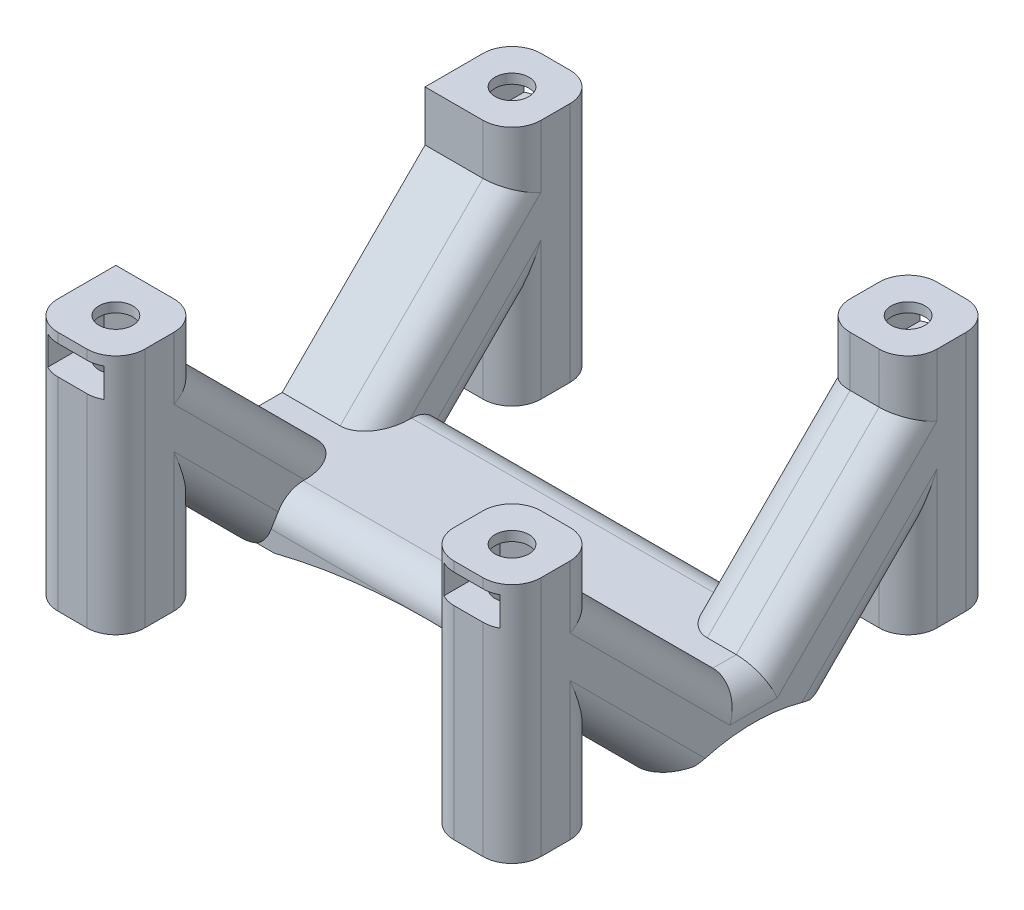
ISO-10303-21;
HEADER;
FILE_DESCRIPTION(('STEP AP214'),'2;1');
FILE_NAME('part.step','',(''),(''),'','','');
FILE_SCHEMA(('AUTOMOTIVE_DESIGN { 1 0 10303 214 1 1 1 1 }'));
ENDSEC;
DATA;
#1=APPLICATION_CONTEXT('core data for automotive mechanical design processes');
#2=APPLICATION_PROTOCOL_DEFINITION('international standard','automotive_design',2000,#1);
#3=PRODUCT_CONTEXT('',#1,'mechanical');
#4=PRODUCT('Part','Part','',(#3));
#5=PRODUCT_RELATED_PRODUCT_CATEGORY('part','',(#4));
#6=PRODUCT_DEFINITION_FORMATION('','',#4);
#7=PRODUCT_DEFINITION_CONTEXT('part definition',#1,'design');
#8=PRODUCT_DEFINITION('design','',#6,#7);
#9=PRODUCT_DEFINITION_SHAPE('','',#8);
#10=(LENGTH_UNIT() NAMED_UNIT(*) SI_UNIT(.MILLI.,.METRE.));
#11=(NAMED_UNIT(*) PLANE_ANGLE_UNIT() SI_UNIT($,.RADIAN.));
#12=(NAMED_UNIT(*) SI_UNIT($,.STERADIAN.) SOLID_ANGLE_UNIT());
#13=UNCERTAINTY_MEASURE_WITH_UNIT(LENGTH_MEASURE(1.E-05),#10,'distance_accuracy_value','');
#14=(GEOMETRIC_REPRESENTATION_CONTEXT(3) GLOBAL_UNCERTAINTY_ASSIGNED_CONTEXT((#13)) GLOBAL_UNIT_ASSIGNED_CONTEXT((#10,
#11,#12)) REPRESENTATION_CONTEXT('',''));
#15=CARTESIAN_POINT('',(0.,0.,0.));
#16=DIRECTION('',(0.,0.,1.));
#17=DIRECTION('',(1.,0.,0.));
#18=AXIS2_PLACEMENT_3D('',#15,#16,#17);
#19=CARTESIAN_POINT('',(-23.,0.,23.));
#20=DIRECTION('',(0.,-1.,0.));
#21=DIRECTION('',(0.,0.,-1.));
#22=AXIS2_PLACEMENT_3D('',#19,#20,#21);
#23=PLANE('',#22);
#24=DIRECTION('',(-1.,0.,0.));
#25=VECTOR('',#24,1.);
#26=CARTESIAN_POINT('',(175.,0.,6.));
#27=LINE('',#26,#25);
#28=CARTESIAN_POINT('',(174.85535096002,0.,6.));
#29=VERTEX_POINT('',#28);
#30=CARTESIAN_POINT('',(166.,0.,6.00000000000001));
#31=VERTEX_POINT('',#30);
#32=EDGE_CURVE('E703',#29,#31,#27,.T.);
#33=ORIENTED_EDGE('',*,*,#32,.F.);
#34=CARTESIAN_POINT('',(172.,0.,4.698484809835));
#35=DIRECTION('',(0.,-1.,0.));
#36=DIRECTION('',(0.,0.,-1.));
#37=AXIS2_PLACEMENT_3D('',#34,#35,#36);
#38=ELLIPSE('',#37,4.24264068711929,3.);
#39=CARTESIAN_POINT('',(172.,0.,8.94112549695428));
#40=VERTEX_POINT('',#39);
#41=EDGE_CURVE('E1806',#29,#40,#38,.T.);
#42=ORIENTED_EDGE('',*,*,#41,.T.);
#43=DIRECTION('',(-1.,0.,0.));
#44=VECTOR('',#43,1.);
#45=CARTESIAN_POINT('',(175.,0.,8.94112549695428));
#46=LINE('',#45,#44);
#47=CARTESIAN_POINT('',(169.,0.,8.94112549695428));
#48=VERTEX_POINT('',#47);
#49=EDGE_CURVE('E1926',#40,#48,#46,.T.);
#50=ORIENTED_EDGE('',*,*,#49,.T.);
#51=CARTESIAN_POINT('',(169.,0.,4.698484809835));
#52=DIRECTION('',(0.,-1.,0.));
#53=DIRECTION('',(0.,0.,1.));
#54=AXIS2_PLACEMENT_3D('',#51,#52,#53);
#55=ELLIPSE('',#54,4.24264068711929,3.);
#56=CARTESIAN_POINT('',(167.832390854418,0.,8.60660171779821));
#57=VERTEX_POINT('',#56);
#58=EDGE_CURVE('E1812',#48,#57,#55,.T.);
#59=ORIENTED_EDGE('',*,*,#58,.T.);
#60=DIRECTION('',(-1.,0.,0.));
#61=VECTOR('',#60,1.);
#62=CARTESIAN_POINT('',(166.,0.,8.60660171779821));
#63=LINE('',#62,#61);
#64=CARTESIAN_POINT('',(166.,0.,8.60660171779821));
#65=VERTEX_POINT('',#64);
#66=EDGE_CURVE('E1809',#57,#65,#63,.T.);
#67=ORIENTED_EDGE('',*,*,#66,.T.);
#68=DIRECTION('',(0.,0.,1.));
#69=VECTOR('',#68,1.);
#70=CARTESIAN_POINT('',(166.,0.,-25.));
#71=LINE('',#70,#69);
#72=EDGE_CURVE('E718',#31,#65,#71,.T.);
#73=ORIENTED_EDGE('',*,*,#72,.F.);
#74=EDGE_LOOP('',(#33,#42,#50,#59,#67,#73));
#75=FACE_BOUND('',#74,.T.);
#76=ADVANCED_FACE('F51',(#75),#23,.T.);
#77=DIRECTION('',(0.,0.,1.));
#78=VECTOR('',#77,1.);
#79=CARTESIAN_POINT('',(134.,0.,-25.));
#80=LINE('',#79,#78);
#81=CARTESIAN_POINT('',(134.,0.,6.));
#82=VERTEX_POINT('',#81);
#83=CARTESIAN_POINT('',(134.,0.,8.60660171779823));
#84=VERTEX_POINT('',#83);
#85=EDGE_CURVE('E731',#82,#84,#80,.T.);
#86=ORIENTED_EDGE('',*,*,#85,.T.);
#87=DIRECTION('',(-1.,0.,0.));
#88=VECTOR('',#87,1.);
#89=CARTESIAN_POINT('',(166.,0.,8.60660171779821));
#90=LINE('',#89,#88);
#91=CARTESIAN_POINT('',(132.167609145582,0.,8.60660171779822));
#92=VERTEX_POINT('',#91);
#93=EDGE_CURVE('E76',#84,#92,#90,.T.);
#94=ORIENTED_EDGE('',*,*,#93,.T.);
#95=CARTESIAN_POINT('',(131.,0.,4.698484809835));
#96=DIRECTION('',(0.,-1.,0.));
#97=DIRECTION('',(0.,0.,-1.));
#98=AXIS2_PLACEMENT_3D('',#95,#96,#97);
#99=ELLIPSE('',#98,4.24264068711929,3.);
#100=CARTESIAN_POINT('',(131.,0.,8.94112549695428));
#101=VERTEX_POINT('',#100);
#102=EDGE_CURVE('E1769',#92,#101,#99,.T.);
#103=ORIENTED_EDGE('',*,*,#102,.T.);
#104=CARTESIAN_POINT('',(128.,0.,8.94112549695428));
#105=VERTEX_POINT('',#104);
#106=EDGE_CURVE('E1920',#101,#105,#46,.T.);
#107=ORIENTED_EDGE('',*,*,#106,.T.);
#108=CARTESIAN_POINT('',(128.,0.,4.698484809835));
#109=DIRECTION('',(0.,-1.,0.));
#110=DIRECTION('',(0.,0.,1.));
#111=AXIS2_PLACEMENT_3D('',#108,#109,#110);
#112=ELLIPSE('',#111,4.24264068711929,3.);
#113=CARTESIAN_POINT('',(125.14464903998,0.,6.));
#114=VERTEX_POINT('',#113);
#115=EDGE_CURVE('E1772',#105,#114,#112,.T.);
#116=ORIENTED_EDGE('',*,*,#115,.T.);
#117=EDGE_CURVE('E696',#82,#114,#27,.T.);
#118=ORIENTED_EDGE('',*,*,#117,.F.);
#119=EDGE_LOOP('',(#86,#94,#103,#107,#116,#118));
#120=FACE_BOUND('',#119,.T.);
#121=ADVANCED_FACE('F2055',(#120),#23,.T.);
#122=DIRECTION('',(-1.,0.,0.));
#123=VECTOR('',#122,1.);
#124=CARTESIAN_POINT('',(175.,0.,-8.94112549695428));
#125=LINE('',#124,#123);
#126=CARTESIAN_POINT('',(172.,0.,-8.94112549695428));
#127=VERTEX_POINT('',#126);
#128=CARTESIAN_POINT('',(169.,0.,-8.94112549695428));
#129=VERTEX_POINT('',#128);
#130=EDGE_CURVE('E1939',#127,#129,#125,.T.);
#131=ORIENTED_EDGE('',*,*,#130,.F.);
#132=CARTESIAN_POINT('',(172.,0.,-4.69848480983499));
#133=DIRECTION('',(0.,-1.,0.));
#134=DIRECTION('',(0.,0.,-1.));
#135=AXIS2_PLACEMENT_3D('',#132,#133,#134);
#136=ELLIPSE('',#135,4.24264068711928,3.);
#137=CARTESIAN_POINT('',(174.85535096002,0.,-6.));
#138=VERTEX_POINT('',#137);
#139=EDGE_CURVE('E692',#127,#138,#136,.T.);
#140=ORIENTED_EDGE('',*,*,#139,.T.);
#141=DIRECTION('',(-1.,0.,0.));
#142=VECTOR('',#141,1.);
#143=CARTESIAN_POINT('',(175.,0.,-6.));
#144=LINE('',#143,#142);
#145=CARTESIAN_POINT('',(166.,0.,-6.));
#146=VERTEX_POINT('',#145);
#147=EDGE_CURVE('E683',#138,#146,#144,.T.);
#148=ORIENTED_EDGE('',*,*,#147,.T.);
#149=CARTESIAN_POINT('',(166.,0.,-8.60660171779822));
#150=VERTEX_POINT('',#149);
#151=EDGE_CURVE('E689',#150,#146,#71,.T.);
#152=ORIENTED_EDGE('',*,*,#151,.F.);
#153=DIRECTION('',(1.,0.,0.));
#154=VECTOR('',#153,1.);
#155=CARTESIAN_POINT('',(134.,0.,-8.60660171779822));
#156=LINE('',#155,#154);
#157=CARTESIAN_POINT('',(167.832390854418,0.,-8.60660171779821));
#158=VERTEX_POINT('',#157);
#159=EDGE_CURVE('E1843',#150,#158,#156,.T.);
#160=ORIENTED_EDGE('',*,*,#159,.T.);
#161=CARTESIAN_POINT('',(169.,0.,-4.698484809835));
#162=DIRECTION('',(0.,-1.,0.));
#163=DIRECTION('',(0.,0.,1.));
#164=AXIS2_PLACEMENT_3D('',#161,#162,#163);
#165=ELLIPSE('',#164,4.24264068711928,3.);
#166=EDGE_CURVE('E1705',#158,#129,#165,.T.);
#167=ORIENTED_EDGE('',*,*,#166,.T.);
#168=EDGE_LOOP('',(#131,#140,#148,#152,#160,#167));
#169=FACE_BOUND('',#168,.T.);
#170=ADVANCED_FACE('F686',(#169),#23,.T.);
#171=CARTESIAN_POINT('',(131.,0.,-4.698484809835));
#172=DIRECTION('',(0.,-1.,0.));
#173=DIRECTION('',(0.,0.,-1.));
#174=AXIS2_PLACEMENT_3D('',#171,#172,#173);
#175=ELLIPSE('',#174,4.24264068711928,3.);
#176=CARTESIAN_POINT('',(131.,0.,-8.94112549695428));
#177=VERTEX_POINT('',#176);
#178=CARTESIAN_POINT('',(132.167609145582,0.,-8.60660171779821));
#179=VERTEX_POINT('',#178);
#180=EDGE_CURVE('E1731',#177,#179,#175,.T.);
#181=ORIENTED_EDGE('',*,*,#180,.T.);
#182=DIRECTION('',(1.,0.,0.));
#183=VECTOR('',#182,1.);
#184=CARTESIAN_POINT('',(134.,0.,-8.60660171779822));
#185=LINE('',#184,#183);
#186=CARTESIAN_POINT('',(134.,0.,-8.60660171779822));
#187=VERTEX_POINT('',#186);
#188=EDGE_CURVE('E1679',#179,#187,#185,.T.);
#189=ORIENTED_EDGE('',*,*,#188,.T.);
#190=CARTESIAN_POINT('',(134.,0.,-6.00000000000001));
#191=VERTEX_POINT('',#190);
#192=EDGE_CURVE('E724',#187,#191,#80,.T.);
#193=ORIENTED_EDGE('',*,*,#192,.T.);
#194=CARTESIAN_POINT('',(125.14464903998,0.,-6.));
#195=VERTEX_POINT('',#194);
#196=EDGE_CURVE('E697',#191,#195,#144,.T.);
#197=ORIENTED_EDGE('',*,*,#196,.T.);
#198=CARTESIAN_POINT('',(128.,0.,-4.698484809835));
#199=DIRECTION('',(0.,-1.,0.));
#200=DIRECTION('',(0.,0.,1.));
#201=AXIS2_PLACEMENT_3D('',#198,#199,#200);
#202=ELLIPSE('',#201,4.24264068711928,3.);
#203=CARTESIAN_POINT('',(128.,0.,-8.94112549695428));
#204=VERTEX_POINT('',#203);
#205=EDGE_CURVE('E1734',#195,#204,#202,.T.);
#206=ORIENTED_EDGE('',*,*,#205,.T.);
#207=EDGE_CURVE('E2064',#177,#204,#125,.T.);
#208=ORIENTED_EDGE('',*,*,#207,.F.);
#209=EDGE_LOOP('',(#181,#189,#193,#197,#206,#208));
#210=FACE_BOUND('',#209,.T.);
#211=ADVANCED_FACE('F2138',(#210),#23,.T.);
#212=DIRECTION('',(-1.,0.,0.));
#213=VECTOR('',#212,1.);
#214=CARTESIAN_POINT('',(175.,0.,16.));
#215=LINE('',#214,#213);
#216=CARTESIAN_POINT('',(172.,0.,16.));
#217=VERTEX_POINT('',#216);
#218=CARTESIAN_POINT('',(169.,0.,16.));
#219=VERTEX_POINT('',#218);
#220=EDGE_CURVE('E1912',#217,#219,#215,.T.);
#221=ORIENTED_EDGE('',*,*,#220,.F.);
#222=CARTESIAN_POINT('',(172.,0.,19.));
#223=DIRECTION('',(0.,-1.,0.));
#224=DIRECTION('',(0.,0.,-1.));
#225=AXIS2_PLACEMENT_3D('',#222,#223,#224);
#226=CIRCLE('',#225,3.);
#227=CARTESIAN_POINT('',(175.,0.,19.));
#228=VERTEX_POINT('',#227);
#229=EDGE_CURVE('E1816',#217,#228,#226,.T.);
#230=ORIENTED_EDGE('',*,*,#229,.T.);
#231=DIRECTION('',(0.,0.,-1.));
#232=VECTOR('',#231,1.);
#233=CARTESIAN_POINT('',(175.,0.,23.));
#234=LINE('',#233,#232);
#235=CARTESIAN_POINT('',(175.,0.,22.));
#236=VERTEX_POINT('',#235);
#237=EDGE_CURVE('E1113',#236,#228,#234,.T.);
#238=ORIENTED_EDGE('',*,*,#237,.F.);
#239=CARTESIAN_POINT('',(172.,0.,22.));
#240=DIRECTION('',(0.,-1.,0.));
#241=DIRECTION('',(0.,0.,-1.));
#242=AXIS2_PLACEMENT_3D('',#239,#240,#241);
#243=CIRCLE('',#242,3.);
#244=CARTESIAN_POINT('',(172.,0.,25.));
#245=VERTEX_POINT('',#244);
#246=EDGE_CURVE('E1314',#236,#245,#243,.T.);
#247=ORIENTED_EDGE('',*,*,#246,.T.);
#248=DIRECTION('',(1.,0.,0.));
#249=VECTOR('',#248,1.);
#250=CARTESIAN_POINT('',(77.,0.,25.));
#251=LINE('',#250,#249);
#252=CARTESIAN_POINT('',(169.,0.,25.));
#253=VERTEX_POINT('',#252);
#254=EDGE_CURVE('E1117',#253,#245,#251,.T.);
#255=ORIENTED_EDGE('',*,*,#254,.F.);
#256=CARTESIAN_POINT('',(169.,0.,22.));
#257=DIRECTION('',(0.,-1.,0.));
#258=DIRECTION('',(0.,0.,-1.));
#259=AXIS2_PLACEMENT_3D('',#256,#257,#258);
#260=CIRCLE('',#259,3.);
#261=CARTESIAN_POINT('',(166.,0.,22.));
#262=VERTEX_POINT('',#261);
#263=EDGE_CURVE('E1311',#253,#262,#260,.T.);
#264=ORIENTED_EDGE('',*,*,#263,.T.);
#265=DIRECTION('',(0.,0.,-1.));
#266=VECTOR('',#265,1.);
#267=CARTESIAN_POINT('',(166.,0.,25.));
#268=LINE('',#267,#266);
#269=CARTESIAN_POINT('',(166.,0.,19.));
#270=VERTEX_POINT('',#269);
#271=EDGE_CURVE('E740',#262,#270,#268,.T.);
#272=ORIENTED_EDGE('',*,*,#271,.T.);
#273=CARTESIAN_POINT('',(169.,0.,19.));
#274=DIRECTION('',(0.,-1.,0.));
#275=DIRECTION('',(0.,0.,-1.));
#276=AXIS2_PLACEMENT_3D('',#273,#274,#275);
#277=CIRCLE('',#276,3.);
#278=EDGE_CURVE('E1819',#270,#219,#277,.T.);
#279=ORIENTED_EDGE('',*,*,#278,.T.);
#280=EDGE_LOOP('',(#221,#230,#238,#247,#255,#264,#272,#279));
#281=FACE_BOUND('',#280,.T.);
#282=CARTESIAN_POINT('',(170.,0.,20.));
#283=DIRECTION('',(0.,1.,0.));
#284=DIRECTION('',(0.,0.,1.));
#285=AXIS2_PLACEMENT_3D('',#282,#283,#284);
#286=CIRCLE('',#285,2.55);
#287=CARTESIAN_POINT('',(170.,0.,22.55));
#288=VERTEX_POINT('',#287);
#289=EDGE_CURVE('E1099',#288,#288,#286,.T.);
#290=ORIENTED_EDGE('',*,*,#289,.T.);
#291=EDGE_LOOP('',(#290));
#292=FACE_BOUND('',#291,.T.);
#293=ADVANCED_FACE('F1910',(#281,#292),#23,.T.);
#294=CARTESIAN_POINT('',(131.,0.,16.));
#295=VERTEX_POINT('',#294);
#296=CARTESIAN_POINT('',(128.,0.,16.));
#297=VERTEX_POINT('',#296);
#298=EDGE_CURVE('E1921',#295,#297,#215,.T.);
#299=ORIENTED_EDGE('',*,*,#298,.F.);
#300=CARTESIAN_POINT('',(131.,0.,19.));
#301=DIRECTION('',(0.,-1.,0.));
#302=DIRECTION('',(0.,0.,-1.));
#303=AXIS2_PLACEMENT_3D('',#300,#301,#302);
#304=CIRCLE('',#303,3.);
#305=CARTESIAN_POINT('',(134.,0.,19.));
#306=VERTEX_POINT('',#305);
#307=EDGE_CURVE('E1755',#295,#306,#304,.T.);
#308=ORIENTED_EDGE('',*,*,#307,.T.);
#309=DIRECTION('',(0.,0.,1.));
#310=VECTOR('',#309,1.);
#311=CARTESIAN_POINT('',(134.,0.,25.));
#312=LINE('',#311,#310);
#313=CARTESIAN_POINT('',(134.,0.,22.));
#314=VERTEX_POINT('',#313);
#315=EDGE_CURVE('E734',#306,#314,#312,.T.);
#316=ORIENTED_EDGE('',*,*,#315,.T.);
#317=CARTESIAN_POINT('',(131.,0.,22.));
#318=DIRECTION('',(0.,-1.,0.));
#319=DIRECTION('',(0.,0.,-1.));
#320=AXIS2_PLACEMENT_3D('',#317,#318,#319);
#321=CIRCLE('',#320,3.);
#322=CARTESIAN_POINT('',(131.,0.,25.));
#323=VERTEX_POINT('',#322);
#324=EDGE_CURVE('E1275',#314,#323,#321,.T.);
#325=ORIENTED_EDGE('',*,*,#324,.T.);
#326=CARTESIAN_POINT('',(128.,0.,25.));
#327=VERTEX_POINT('',#326);
#328=EDGE_CURVE('E1118',#327,#323,#251,.T.);
#329=ORIENTED_EDGE('',*,*,#328,.F.);
#330=CARTESIAN_POINT('',(128.,0.,22.));
#331=DIRECTION('',(0.,-1.,0.));
#332=DIRECTION('',(0.,0.,-1.));
#333=AXIS2_PLACEMENT_3D('',#330,#331,#332);
#334=CIRCLE('',#333,2.99999999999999);
#335=CARTESIAN_POINT('',(125.,0.,22.));
#336=VERTEX_POINT('',#335);
#337=EDGE_CURVE('E1528',#336,#327,#334,.F.);
#338=ORIENTED_EDGE('',*,*,#337,.F.);
#339=DIRECTION('',(0.,0.,1.));
#340=VECTOR('',#339,1.);
#341=CARTESIAN_POINT('',(125.,0.,23.0000000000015));
#342=LINE('',#341,#340);
#343=CARTESIAN_POINT('',(125.,0.,19.));
#344=VERTEX_POINT('',#343);
#345=EDGE_CURVE('E1947',#344,#336,#342,.T.);
#346=ORIENTED_EDGE('',*,*,#345,.F.);
#347=CARTESIAN_POINT('',(128.,0.,19.));
#348=DIRECTION('',(0.,-1.,0.));
#349=DIRECTION('',(0.,0.,-1.));
#350=AXIS2_PLACEMENT_3D('',#347,#348,#349);
#351=CIRCLE('',#350,3.);
#352=EDGE_CURVE('E1758',#344,#297,#351,.T.);
#353=ORIENTED_EDGE('',*,*,#352,.T.);
#354=EDGE_LOOP('',(#299,#308,#316,#325,#329,#338,#346,#353));
#355=FACE_BOUND('',#354,.T.);
#356=CARTESIAN_POINT('',(130.,0.,20.));
#357=DIRECTION('',(0.,1.,0.));
#358=DIRECTION('',(0.,0.,1.));
#359=AXIS2_PLACEMENT_3D('',#356,#357,#358);
#360=CIRCLE('',#359,2.55);
#361=CARTESIAN_POINT('',(130.,0.,22.55));
#362=VERTEX_POINT('',#361);
#363=EDGE_CURVE('E1095',#362,#362,#360,.T.);
#364=ORIENTED_EDGE('',*,*,#363,.T.);
#365=EDGE_LOOP('',(#364));
#366=FACE_BOUND('',#365,.T.);
#367=ADVANCED_FACE('F1966',(#355,#366),#23,.T.);
#368=CARTESIAN_POINT('',(77.,5.,-25.));
#369=DIRECTION('',(0.,0.,1.));
#370=DIRECTION('',(1.,0.,0.));
#371=AXIS2_PLACEMENT_3D('',#368,#369,#370);
#372=PLANE('',#371);
#373=DIRECTION('',(-1.,0.,0.));
#374=VECTOR('',#373,1.);
#375=CARTESIAN_POINT('',(77.,0.,-25.));
#376=LINE('',#375,#374);
#377=CARTESIAN_POINT('',(131.,0.,-25.));
#378=VERTEX_POINT('',#377);
#379=CARTESIAN_POINT('',(128.,0.,-25.));
#380=VERTEX_POINT('',#379);
#381=EDGE_CURVE('E1121',#378,#380,#376,.T.);
#382=ORIENTED_EDGE('',*,*,#381,.T.);
#383=DIRECTION('',(0.,-1.,0.));
#384=VECTOR('',#383,1.);
#385=CARTESIAN_POINT('',(128.,5.,-25.));
#386=LINE('',#385,#384);
#387=CARTESIAN_POINT('',(128.,21.,-25.));
#388=VERTEX_POINT('',#387);
#389=EDGE_CURVE('E1424',#380,#388,#386,.F.);
#390=ORIENTED_EDGE('',*,*,#389,.T.);
#391=DIRECTION('',(-1.,0.,0.));
#392=VECTOR('',#391,1.);
#393=CARTESIAN_POINT('',(132.4,21.,-25.));
#394=LINE('',#393,#392);
#395=CARTESIAN_POINT('',(131.,21.,-25.));
#396=VERTEX_POINT('',#395);
#397=EDGE_CURVE('E754',#396,#388,#394,.T.);
#398=ORIENTED_EDGE('',*,*,#397,.F.);
#399=DIRECTION('',(0.,-1.,0.));
#400=VECTOR('',#399,1.);
#401=CARTESIAN_POINT('',(131.,0.,-25.));
#402=LINE('',#401,#400);
#403=EDGE_CURVE('E1427',#396,#378,#402,.T.);
#404=ORIENTED_EDGE('',*,*,#403,.T.);
#405=EDGE_LOOP('',(#382,#390,#398,#404));
#406=FACE_BOUND('',#405,.T.);
#407=ADVANCED_FACE('F2147',(#406),#372,.F.);
#408=CARTESIAN_POINT('',(172.,0.,-25.));
#409=VERTEX_POINT('',#408);
#410=CARTESIAN_POINT('',(169.,0.,-25.));
#411=VERTEX_POINT('',#410);
#412=EDGE_CURVE('E1122',#409,#411,#376,.T.);
#413=ORIENTED_EDGE('',*,*,#412,.T.);
#414=DIRECTION('',(0.,-1.,0.));
#415=VECTOR('',#414,1.);
#416=CARTESIAN_POINT('',(169.,25.,-25.));
#417=LINE('',#416,#415);
#418=CARTESIAN_POINT('',(169.,21.,-25.));
#419=VERTEX_POINT('',#418);
#420=EDGE_CURVE('E1459',#411,#419,#417,.F.);
#421=ORIENTED_EDGE('',*,*,#420,.T.);
#422=DIRECTION('',(-1.,0.,0.));
#423=VECTOR('',#422,1.);
#424=CARTESIAN_POINT('',(173.4,21.,-25.));
#425=LINE('',#424,#423);
#426=CARTESIAN_POINT('',(172.,21.,-25.));
#427=VERTEX_POINT('',#426);
#428=EDGE_CURVE('E749',#427,#419,#425,.T.);
#429=ORIENTED_EDGE('',*,*,#428,.F.);
#430=DIRECTION('',(0.,-1.,0.));
#431=VECTOR('',#430,1.);
#432=CARTESIAN_POINT('',(172.,5.,-25.));
#433=LINE('',#432,#431);
#434=EDGE_CURVE('E1449',#427,#409,#433,.T.);
#435=ORIENTED_EDGE('',*,*,#434,.T.);
#436=EDGE_LOOP('',(#413,#421,#429,#435));
#437=FACE_BOUND('',#436,.T.);
#438=ADVANCED_FACE('F2240',(#437),#372,.F.);
#439=DIRECTION('',(-1.,0.,0.));
#440=VECTOR('',#439,1.);
#441=CARTESIAN_POINT('',(125.,25.,-25.));
#442=LINE('',#441,#440);
#443=CARTESIAN_POINT('',(131.,25.,-25.));
#444=VERTEX_POINT('',#443);
#445=CARTESIAN_POINT('',(128.,25.,-25.));
#446=VERTEX_POINT('',#445);
#447=EDGE_CURVE('E1086',#444,#446,#442,.T.);
#448=ORIENTED_EDGE('',*,*,#447,.F.);
#449=DIRECTION('',(0.,-1.,0.));
#450=VECTOR('',#449,1.);
#451=CARTESIAN_POINT('',(131.,0.,-25.));
#452=LINE('',#451,#450);
#453=CARTESIAN_POINT('',(131.,24.,-25.));
#454=VERTEX_POINT('',#453);
#455=EDGE_CURVE('E1430',#444,#454,#452,.T.);
#456=ORIENTED_EDGE('',*,*,#455,.T.);
#457=DIRECTION('',(1.,0.,0.));
#458=VECTOR('',#457,1.);
#459=CARTESIAN_POINT('',(132.4,24.,-25.));
#460=LINE('',#459,#458);
#461=CARTESIAN_POINT('',(128.,24.,-25.));
#462=VERTEX_POINT('',#461);
#463=EDGE_CURVE('E743',#462,#454,#460,.T.);
#464=ORIENTED_EDGE('',*,*,#463,.F.);
#465=DIRECTION('',(0.,-1.,0.));
#466=VECTOR('',#465,1.);
#467=CARTESIAN_POINT('',(128.,5.,-25.));
#468=LINE('',#467,#466);
#469=EDGE_CURVE('E1421',#462,#446,#468,.F.);
#470=ORIENTED_EDGE('',*,*,#469,.T.);
#471=EDGE_LOOP('',(#448,#456,#464,#470));
#472=FACE_BOUND('',#471,.T.);
#473=ADVANCED_FACE('F2164',(#472),#372,.F.);
#474=CARTESIAN_POINT('',(77.,5.,25.));
#475=DIRECTION('',(0.,0.,-1.));
#476=DIRECTION('',(-1.,0.,0.));
#477=AXIS2_PLACEMENT_3D('',#474,#475,#476);
#478=PLANE('',#477);
#479=ORIENTED_EDGE('',*,*,#254,.T.);
#480=DIRECTION('',(0.,-1.,0.));
#481=VECTOR('',#480,1.);
#482=CARTESIAN_POINT('',(172.,5.,25.));
#483=LINE('',#482,#481);
#484=CARTESIAN_POINT('',(172.,21.,25.));
#485=VERTEX_POINT('',#484);
#486=EDGE_CURVE('E1327',#245,#485,#483,.F.);
#487=ORIENTED_EDGE('',*,*,#486,.T.);
#488=DIRECTION('',(1.,0.,0.));
#489=VECTOR('',#488,1.);
#490=CARTESIAN_POINT('',(167.6,21.,25.));
#491=LINE('',#490,#489);
#492=CARTESIAN_POINT('',(169.,21.,25.));
#493=VERTEX_POINT('',#492);
#494=EDGE_CURVE('E770',#493,#485,#491,.T.);
#495=ORIENTED_EDGE('',*,*,#494,.F.);
#496=DIRECTION('',(0.,-1.,0.));
#497=VECTOR('',#496,1.);
#498=CARTESIAN_POINT('',(169.,0.,25.));
#499=LINE('',#498,#497);
#500=EDGE_CURVE('E1317',#493,#253,#499,.T.);
#501=ORIENTED_EDGE('',*,*,#500,.T.);
#502=EDGE_LOOP('',(#479,#487,#495,#501));
#503=FACE_BOUND('',#502,.T.);
#504=ADVANCED_FACE('F2492',(#503),#478,.F.);
#505=DIRECTION('',(1.,0.,0.));
#506=VECTOR('',#505,1.);
#507=CARTESIAN_POINT('',(125.,25.,25.));
#508=LINE('',#507,#506);
#509=CARTESIAN_POINT('',(128.,25.,25.));
#510=VERTEX_POINT('',#509);
#511=CARTESIAN_POINT('',(131.,25.,25.));
#512=VERTEX_POINT('',#511);
#513=EDGE_CURVE('E1076',#510,#512,#508,.T.);
#514=ORIENTED_EDGE('',*,*,#513,.F.);
#515=DIRECTION('',(0.,-1.,0.));
#516=VECTOR('',#515,1.);
#517=CARTESIAN_POINT('',(128.,5.,25.));
#518=LINE('',#517,#516);
#519=CARTESIAN_POINT('',(128.,24.,25.));
#520=VERTEX_POINT('',#519);
#521=EDGE_CURVE('E1199',#510,#520,#518,.T.);
#522=ORIENTED_EDGE('',*,*,#521,.T.);
#523=DIRECTION('',(-1.,0.,0.));
#524=VECTOR('',#523,1.);
#525=CARTESIAN_POINT('',(126.6,24.,25.));
#526=LINE('',#525,#524);
#527=CARTESIAN_POINT('',(131.,24.,25.));
#528=VERTEX_POINT('',#527);
#529=EDGE_CURVE('E769',#528,#520,#526,.T.);
#530=ORIENTED_EDGE('',*,*,#529,.F.);
#531=DIRECTION('',(0.,-1.,0.));
#532=VECTOR('',#531,1.);
#533=CARTESIAN_POINT('',(131.,25.,25.));
#534=LINE('',#533,#532);
#535=EDGE_CURVE('E1190',#528,#512,#534,.F.);
#536=ORIENTED_EDGE('',*,*,#535,.T.);
#537=EDGE_LOOP('',(#514,#522,#530,#536));
#538=FACE_BOUND('',#537,.T.);
#539=ADVANCED_FACE('F2004',(#538),#478,.F.);
#540=CARTESIAN_POINT('',(134.,0.,-8.60660171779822));
#541=DIRECTION('',(0.,0.,1.));
#542=DIRECTION('',(1.,0.,0.));
#543=AXIS2_PLACEMENT_3D('',#540,#541,#542);
#544=PLANE('',#543);
#545=CARTESIAN_POINT('',(150.,-63.0000000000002,-8.60660171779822));
#546=DIRECTION('',(0.,0.,1.));
#547=DIRECTION('',(1.,0.,0.));
#548=AXIS2_PLACEMENT_3D('',#545,#546,#547);
#549=CIRCLE('',#548,65.0000000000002);
#550=CARTESIAN_POINT('',(150.,2.,-8.60660171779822));
#551=VERTEX_POINT('',#550);
#552=EDGE_CURVE('E717',#551,#187,#549,.T.);
#553=ORIENTED_EDGE('',*,*,#552,.T.);
#554=ORIENTED_EDGE('',*,*,#188,.F.);
#555=CARTESIAN_POINT('',(131.,3.90811690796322,-8.60660171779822));
#556=DIRECTION('',(0.,0.,1.));
#557=DIRECTION('',(0.,1.,0.));
#558=AXIS2_PLACEMENT_3D('',#555,#556,#557);
#559=ELLIPSE('',#558,4.24264068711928,3.);
#560=CARTESIAN_POINT('',(133.679467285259,2.,-8.60660171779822));
#561=VERTEX_POINT('',#560);
#562=EDGE_CURVE('E61',#179,#561,#559,.T.);
#563=ORIENTED_EDGE('',*,*,#562,.T.);
#564=DIRECTION('',(1.,0.,0.));
#565=VECTOR('',#564,1.);
#566=CARTESIAN_POINT('',(134.,2.,-8.60660171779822));
#567=LINE('',#566,#565);
#568=EDGE_CURVE('E68',#561,#551,#567,.T.);
#569=ORIENTED_EDGE('',*,*,#568,.T.);
#570=EDGE_LOOP('',(#553,#554,#563,#569));
#571=FACE_BOUND('',#570,.T.);
#572=ADVANCED_FACE('F1678',(#571),#544,.F.);
#573=CARTESIAN_POINT('',(166.,0.,8.60660171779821));
#574=DIRECTION('',(0.,0.,-1.));
#575=DIRECTION('',(-1.,0.,0.));
#576=AXIS2_PLACEMENT_3D('',#573,#574,#575);
#577=PLANE('',#576);
#578=CARTESIAN_POINT('',(150.,-63.0000000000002,8.60660171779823));
#579=DIRECTION('',(0.,0.,1.));
#580=DIRECTION('',(-1.,0.,0.));
#581=AXIS2_PLACEMENT_3D('',#578,#579,#580);
#582=CIRCLE('',#581,65.0000000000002);
#583=CARTESIAN_POINT('',(150.,2.,8.60660171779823));
#584=VERTEX_POINT('',#583);
#585=EDGE_CURVE('E727',#65,#584,#582,.T.);
#586=ORIENTED_EDGE('',*,*,#585,.F.);
#587=ORIENTED_EDGE('',*,*,#66,.F.);
#588=CARTESIAN_POINT('',(169.,3.90811690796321,8.60660171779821));
#589=DIRECTION('',(0.,0.,-1.));
#590=DIRECTION('',(0.,1.,0.));
#591=AXIS2_PLACEMENT_3D('',#588,#589,#590);
#592=ELLIPSE('',#591,4.24264068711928,3.);
#593=CARTESIAN_POINT('',(166.320532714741,2.,8.60660171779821));
#594=VERTEX_POINT('',#593);
#595=EDGE_CURVE('E1710',#57,#594,#592,.T.);
#596=ORIENTED_EDGE('',*,*,#595,.T.);
#597=DIRECTION('',(-1.,0.,0.));
#598=VECTOR('',#597,1.);
#599=CARTESIAN_POINT('',(166.,2.,8.60660171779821));
#600=LINE('',#599,#598);
#601=EDGE_CURVE('E1159',#594,#584,#600,.T.);
#602=ORIENTED_EDGE('',*,*,#601,.T.);
#603=EDGE_LOOP('',(#586,#587,#596,#602));
#604=FACE_BOUND('',#603,.T.);
#605=ADVANCED_FACE('F2220',(#604),#577,.F.);
#606=CARTESIAN_POINT('',(175.,0.,-19.));
#607=VERTEX_POINT('',#606);
#608=CARTESIAN_POINT('',(175.,0.,-22.));
#609=VERTEX_POINT('',#608);
#610=EDGE_CURVE('E1112',#607,#609,#234,.T.);
#611=ORIENTED_EDGE('',*,*,#610,.F.);
#612=CARTESIAN_POINT('',(172.,0.,-19.));
#613=DIRECTION('',(0.,-1.,0.));
#614=DIRECTION('',(0.,0.,-1.));
#615=AXIS2_PLACEMENT_3D('',#612,#613,#614);
#616=CIRCLE('',#615,3.);
#617=CARTESIAN_POINT('',(172.,0.,-16.));
#618=VERTEX_POINT('',#617);
#619=EDGE_CURVE('E1834',#607,#618,#616,.T.);
#620=ORIENTED_EDGE('',*,*,#619,.T.);
#621=DIRECTION('',(-1.,0.,0.));
#622=VECTOR('',#621,1.);
#623=CARTESIAN_POINT('',(175.,0.,-16.));
#624=LINE('',#623,#622);
#625=CARTESIAN_POINT('',(169.,0.,-16.));
#626=VERTEX_POINT('',#625);
#627=EDGE_CURVE('E2068',#618,#626,#624,.T.);
#628=ORIENTED_EDGE('',*,*,#627,.T.);
#629=CARTESIAN_POINT('',(169.,0.,-19.));
#630=DIRECTION('',(0.,-1.,0.));
#631=DIRECTION('',(0.,0.,-1.));
#632=AXIS2_PLACEMENT_3D('',#629,#630,#631);
#633=CIRCLE('',#632,3.);
#634=CARTESIAN_POINT('',(166.,0.,-19.));
#635=VERTEX_POINT('',#634);
#636=EDGE_CURVE('E1837',#626,#635,#633,.T.);
#637=ORIENTED_EDGE('',*,*,#636,.T.);
#638=DIRECTION('',(0.,0.,-1.));
#639=VECTOR('',#638,1.);
#640=CARTESIAN_POINT('',(166.,0.,-25.));
#641=LINE('',#640,#639);
#642=CARTESIAN_POINT('',(166.,0.,-22.));
#643=VERTEX_POINT('',#642);
#644=EDGE_CURVE('E739',#635,#643,#641,.T.);
#645=ORIENTED_EDGE('',*,*,#644,.T.);
#646=CARTESIAN_POINT('',(169.,0.,-22.));
#647=DIRECTION('',(0.,-1.,0.));
#648=DIRECTION('',(0.,0.,-1.));
#649=AXIS2_PLACEMENT_3D('',#646,#647,#648);
#650=CIRCLE('',#649,3.);
#651=EDGE_CURVE('E1308',#643,#411,#650,.T.);
#652=ORIENTED_EDGE('',*,*,#651,.T.);
#653=ORIENTED_EDGE('',*,*,#412,.F.);
#654=CARTESIAN_POINT('',(172.,0.,-22.));
#655=DIRECTION('',(0.,-1.,0.));
#656=DIRECTION('',(0.,0.,-1.));
#657=AXIS2_PLACEMENT_3D('',#654,#655,#656);
#658=CIRCLE('',#657,3.);
#659=EDGE_CURVE('E1304',#409,#609,#658,.T.);
#660=ORIENTED_EDGE('',*,*,#659,.T.);
#661=EDGE_LOOP('',(#611,#620,#628,#637,#645,#652,#653,#660));
#662=FACE_BOUND('',#661,.T.);
#663=CARTESIAN_POINT('',(170.,0.,-20.));
#664=DIRECTION('',(0.,1.,0.));
#665=DIRECTION('',(0.,0.,1.));
#666=AXIS2_PLACEMENT_3D('',#663,#664,#665);
#667=CIRCLE('',#666,2.55);
#668=CARTESIAN_POINT('',(170.,0.,-17.45));
#669=VERTEX_POINT('',#668);
#670=EDGE_CURVE('E1104',#669,#669,#667,.T.);
#671=ORIENTED_EDGE('',*,*,#670,.T.);
#672=EDGE_LOOP('',(#671));
#673=FACE_BOUND('',#672,.T.);
#674=ADVANCED_FACE('F2208',(#662,#673),#23,.T.);
#675=DIRECTION('',(-1.,0.,0.));
#676=VECTOR('',#675,1.);
#677=CARTESIAN_POINT('',(167.6,24.,25.));
#678=LINE('',#677,#676);
#679=CARTESIAN_POINT('',(172.,24.,25.));
#680=VERTEX_POINT('',#679);
#681=CARTESIAN_POINT('',(169.,24.,25.));
#682=VERTEX_POINT('',#681);
#683=EDGE_CURVE('E758',#680,#682,#678,.T.);
#684=ORIENTED_EDGE('',*,*,#683,.F.);
#685=DIRECTION('',(0.,-1.,0.));
#686=VECTOR('',#685,1.);
#687=CARTESIAN_POINT('',(172.,5.,25.));
#688=LINE('',#687,#686);
#689=CARTESIAN_POINT('',(172.,25.,25.));
#690=VERTEX_POINT('',#689);
#691=EDGE_CURVE('E1324',#680,#690,#688,.F.);
#692=ORIENTED_EDGE('',*,*,#691,.T.);
#693=DIRECTION('',(1.,0.,0.));
#694=VECTOR('',#693,1.);
#695=CARTESIAN_POINT('',(166.,25.,25.));
#696=LINE('',#695,#694);
#697=CARTESIAN_POINT('',(169.,25.,25.));
#698=VERTEX_POINT('',#697);
#699=EDGE_CURVE('E1025',#698,#690,#696,.T.);
#700=ORIENTED_EDGE('',*,*,#699,.F.);
#701=DIRECTION('',(0.,-1.,0.));
#702=VECTOR('',#701,1.);
#703=CARTESIAN_POINT('',(169.,0.,25.));
#704=LINE('',#703,#702);
#705=EDGE_CURVE('E1320',#698,#682,#704,.T.);
#706=ORIENTED_EDGE('',*,*,#705,.T.);
#707=EDGE_LOOP('',(#684,#692,#700,#706));
#708=FACE_BOUND('',#707,.T.);
#709=ADVANCED_FACE('F2219',(#708),#478,.F.);
#710=CARTESIAN_POINT('',(134.,5.,-14.));
#711=DIRECTION('',(1.,0.,0.));
#712=DIRECTION('',(0.,0.,-1.));
#713=AXIS2_PLACEMENT_3D('',#710,#711,#712);
#714=PLANE('',#713);
#715=DIRECTION('',(0.,-1.,0.));
#716=VECTOR('',#715,1.);
#717=CARTESIAN_POINT('',(134.,7.05887450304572,19.));
#718=LINE('',#717,#716);
#719=CARTESIAN_POINT('',(134.,14.301515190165,19.));
#720=VERTEX_POINT('',#719);
#721=EDGE_CURVE('E1778',#306,#720,#718,.F.);
#722=ORIENTED_EDGE('',*,*,#721,.T.);
#723=DIRECTION('',(0.,0.707106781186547,0.707106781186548));
#724=VECTOR('',#723,1.);
#725=CARTESIAN_POINT('',(134.,2.12132034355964,6.81980515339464));
#726=LINE('',#725,#724);
#727=CARTESIAN_POINT('',(134.,3.50392377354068,8.20240858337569));
#728=VERTEX_POINT('',#727);
#729=EDGE_CURVE('E1775',#720,#728,#726,.F.);
#730=ORIENTED_EDGE('',*,*,#729,.T.);
#731=CARTESIAN_POINT('',(134.,2.,5.60660171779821));
#732=DIRECTION('',(1.,0.,0.));
#733=DIRECTION('',(0.,0.,-1.));
#734=AXIS2_PLACEMENT_3D('',#731,#732,#733);
#735=CIRCLE('',#734,3.);
#736=CARTESIAN_POINT('',(134.,5.,5.60660171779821));
#737=VERTEX_POINT('',#736);
#738=EDGE_CURVE('E1176',#728,#737,#735,.F.);
#739=ORIENTED_EDGE('',*,*,#738,.T.);
#740=DIRECTION('',(0.,0.,-1.));
#741=VECTOR('',#740,1.);
#742=CARTESIAN_POINT('',(134.,5.,-25.));
#743=LINE('',#742,#741);
#744=CARTESIAN_POINT('',(134.,5.,5.45584412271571));
#745=VERTEX_POINT('',#744);
#746=EDGE_CURVE('E1091',#737,#745,#743,.T.);
#747=ORIENTED_EDGE('',*,*,#746,.T.);
#748=DIRECTION('',(0.,-0.707106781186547,-0.707106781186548));
#749=VECTOR('',#748,1.);
#750=CARTESIAN_POINT('',(134.,17.6654762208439,18.1213203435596));
#751=LINE('',#750,#749);
#752=CARTESIAN_POINT('',(134.,18.5441558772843,19.));
#753=VERTEX_POINT('',#752);
#754=EDGE_CURVE('E1266',#745,#753,#751,.F.);
#755=ORIENTED_EDGE('',*,*,#754,.T.);
#756=DIRECTION('',(0.,-1.,0.));
#757=VECTOR('',#756,1.);
#758=CARTESIAN_POINT('',(134.,25.,19.));
#759=LINE('',#758,#757);
#760=CARTESIAN_POINT('',(134.,25.,19.));
#761=VERTEX_POINT('',#760);
#762=EDGE_CURVE('E1263',#753,#761,#759,.F.);
#763=ORIENTED_EDGE('',*,*,#762,.T.);
#764=DIRECTION('',(0.,0.,-1.));
#765=VECTOR('',#764,1.);
#766=CARTESIAN_POINT('',(134.,25.,-25.));
#767=LINE('',#766,#765);
#768=CARTESIAN_POINT('',(134.,25.,22.));
#769=VERTEX_POINT('',#768);
#770=EDGE_CURVE('E1085',#769,#761,#767,.T.);
#771=ORIENTED_EDGE('',*,*,#770,.F.);
#772=DIRECTION('',(0.,-1.,0.));
#773=VECTOR('',#772,1.);
#774=CARTESIAN_POINT('',(134.,0.,22.));
#775=LINE('',#774,#773);
#776=EDGE_CURVE('E1259',#769,#314,#775,.T.);
#777=ORIENTED_EDGE('',*,*,#776,.T.);
#778=ORIENTED_EDGE('',*,*,#315,.F.);
#779=EDGE_LOOP('',(#722,#730,#739,#747,#755,#763,#771,#777,#778));
#780=FACE_BOUND('',#779,.T.);
#781=ADVANCED_FACE('F2012',(#780),#714,.T.);
#782=CARTESIAN_POINT('',(134.,2.,-5.60660171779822));
#783=DIRECTION('',(1.,0.,0.));
#784=DIRECTION('',(0.,0.,-1.));
#785=AXIS2_PLACEMENT_3D('',#782,#783,#784);
#786=CIRCLE('',#785,3.);
#787=CARTESIAN_POINT('',(134.,5.,-5.60660171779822));
#788=VERTEX_POINT('',#787);
#789=CARTESIAN_POINT('',(134.,3.50392377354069,-8.20240858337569));
#790=VERTEX_POINT('',#789);
#791=EDGE_CURVE('E1186',#788,#790,#786,.F.);
#792=ORIENTED_EDGE('',*,*,#791,.T.);
#793=DIRECTION('',(0.,-0.707106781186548,0.707106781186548));
#794=VECTOR('',#793,1.);
#795=CARTESIAN_POINT('',(134.,9.18019484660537,-13.8786796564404));
#796=LINE('',#795,#794);
#797=CARTESIAN_POINT('',(134.,14.301515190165,-19.));
#798=VERTEX_POINT('',#797);
#799=EDGE_CURVE('E1683',#790,#798,#796,.F.);
#800=ORIENTED_EDGE('',*,*,#799,.T.);
#801=DIRECTION('',(0.,1.,0.));
#802=VECTOR('',#801,1.);
#803=CARTESIAN_POINT('',(134.,0.,-19.));
#804=LINE('',#803,#802);
#805=CARTESIAN_POINT('',(134.,0.,-19.));
#806=VERTEX_POINT('',#805);
#807=EDGE_CURVE('E1726',#798,#806,#804,.F.);
#808=ORIENTED_EDGE('',*,*,#807,.T.);
#809=DIRECTION('',(0.,0.,1.));
#810=VECTOR('',#809,1.);
#811=CARTESIAN_POINT('',(134.,0.,-25.));
#812=LINE('',#811,#810);
#813=CARTESIAN_POINT('',(134.,0.,-22.));
#814=VERTEX_POINT('',#813);
#815=EDGE_CURVE('E735',#814,#806,#812,.T.);
#816=ORIENTED_EDGE('',*,*,#815,.F.);
#817=DIRECTION('',(0.,-1.,0.));
#818=VECTOR('',#817,1.);
#819=CARTESIAN_POINT('',(134.,25.,-22.));
#820=LINE('',#819,#818);
#821=CARTESIAN_POINT('',(134.,25.,-22.));
#822=VERTEX_POINT('',#821);
#823=EDGE_CURVE('E1243',#814,#822,#820,.F.);
#824=ORIENTED_EDGE('',*,*,#823,.T.);
#825=CARTESIAN_POINT('',(134.,25.,-19.));
#826=VERTEX_POINT('',#825);
#827=EDGE_CURVE('E1081',#826,#822,#767,.T.);
#828=ORIENTED_EDGE('',*,*,#827,.F.);
#829=DIRECTION('',(0.,1.,0.));
#830=VECTOR('',#829,1.);
#831=CARTESIAN_POINT('',(134.,19.7867965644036,-19.));
#832=LINE('',#831,#830);
#833=CARTESIAN_POINT('',(134.,18.5441558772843,-19.));
#834=VERTEX_POINT('',#833);
#835=EDGE_CURVE('E1249',#826,#834,#832,.F.);
#836=ORIENTED_EDGE('',*,*,#835,.T.);
#837=DIRECTION('',(0.,0.707106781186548,-0.707106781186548));
#838=VECTOR('',#837,1.);
#839=CARTESIAN_POINT('',(134.,2.87867965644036,-3.33452377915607));
#840=LINE('',#839,#838);
#841=CARTESIAN_POINT('',(134.,5.,-5.45584412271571));
#842=VERTEX_POINT('',#841);
#843=EDGE_CURVE('E1246',#834,#842,#840,.F.);
#844=ORIENTED_EDGE('',*,*,#843,.T.);
#845=EDGE_CURVE('E1072',#842,#788,#743,.T.);
#846=ORIENTED_EDGE('',*,*,#845,.T.);
#847=EDGE_LOOP('',(#792,#800,#808,#816,#824,#828,#836,#844,#846));
#848=FACE_BOUND('',#847,.T.);
#849=ADVANCED_FACE('F1687',(#848),#714,.T.);
#850=CARTESIAN_POINT('',(166.,5.,-14.));
#851=DIRECTION('',(-1.,0.,0.));
#852=DIRECTION('',(0.,0.,1.));
#853=AXIS2_PLACEMENT_3D('',#850,#851,#852);
#854=PLANE('',#853);
#855=DIRECTION('',(0.,-1.,0.));
#856=VECTOR('',#855,1.);
#857=CARTESIAN_POINT('',(166.,7.05887450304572,-19.));
#858=LINE('',#857,#856);
#859=CARTESIAN_POINT('',(166.,14.301515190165,-19.));
#860=VERTEX_POINT('',#859);
#861=EDGE_CURVE('E1790',#635,#860,#858,.F.);
#862=ORIENTED_EDGE('',*,*,#861,.T.);
#863=DIRECTION('',(0.,0.707106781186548,-0.707106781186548));
#864=VECTOR('',#863,1.);
#865=CARTESIAN_POINT('',(166.,2.12132034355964,-6.81980515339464));
#866=LINE('',#865,#864);
#867=CARTESIAN_POINT('',(166.,3.50392377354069,-8.20240858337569));
#868=VERTEX_POINT('',#867);
#869=EDGE_CURVE('E1701',#860,#868,#866,.F.);
#870=ORIENTED_EDGE('',*,*,#869,.T.);
#871=CARTESIAN_POINT('',(166.,2.,-5.60660171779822));
#872=DIRECTION('',(-1.,0.,0.));
#873=DIRECTION('',(0.,0.,1.));
#874=AXIS2_PLACEMENT_3D('',#871,#872,#873);
#875=CIRCLE('',#874,3.);
#876=CARTESIAN_POINT('',(166.,5.,-5.60660171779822));
#877=VERTEX_POINT('',#876);
#878=EDGE_CURVE('E1183',#868,#877,#875,.F.);
#879=ORIENTED_EDGE('',*,*,#878,.T.);
#880=DIRECTION('',(0.,0.,1.));
#881=VECTOR('',#880,1.);
#882=CARTESIAN_POINT('',(166.,5.,-25.));
#883=LINE('',#882,#881);
#884=CARTESIAN_POINT('',(166.,5.,-5.45584412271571));
#885=VERTEX_POINT('',#884);
#886=EDGE_CURVE('E1040',#877,#885,#883,.T.);
#887=ORIENTED_EDGE('',*,*,#886,.T.);
#888=DIRECTION('',(0.,-0.707106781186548,0.707106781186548));
#889=VECTOR('',#888,1.);
#890=CARTESIAN_POINT('',(166.,17.6654762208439,-18.1213203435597));
#891=LINE('',#890,#889);
#892=CARTESIAN_POINT('',(166.,18.5441558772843,-19.));
#893=VERTEX_POINT('',#892);
#894=EDGE_CURVE('E1400',#885,#893,#891,.F.);
#895=ORIENTED_EDGE('',*,*,#894,.T.);
#896=DIRECTION('',(0.,-1.,0.));
#897=VECTOR('',#896,1.);
#898=CARTESIAN_POINT('',(166.,25.,-19.));
#899=LINE('',#898,#897);
#900=CARTESIAN_POINT('',(166.,25.,-19.));
#901=VERTEX_POINT('',#900);
#902=EDGE_CURVE('E1397',#893,#901,#899,.F.);
#903=ORIENTED_EDGE('',*,*,#902,.T.);
#904=DIRECTION('',(0.,0.,1.));
#905=VECTOR('',#904,1.);
#906=CARTESIAN_POINT('',(166.,25.,-25.));
#907=LINE('',#906,#905);
#908=CARTESIAN_POINT('',(166.,25.,-22.));
#909=VERTEX_POINT('',#908);
#910=EDGE_CURVE('E1021',#909,#901,#907,.T.);
#911=ORIENTED_EDGE('',*,*,#910,.F.);
#912=DIRECTION('',(0.,-1.,0.));
#913=VECTOR('',#912,1.);
#914=CARTESIAN_POINT('',(166.,0.,-22.));
#915=LINE('',#914,#913);
#916=EDGE_CURVE('E1393',#909,#643,#915,.T.);
#917=ORIENTED_EDGE('',*,*,#916,.T.);
#918=ORIENTED_EDGE('',*,*,#644,.F.);
#919=EDGE_LOOP('',(#862,#870,#879,#887,#895,#903,#911,#917,#918));
#920=FACE_BOUND('',#919,.T.);
#921=ADVANCED_FACE('F2430',(#920),#854,.T.);
#922=CARTESIAN_POINT('',(166.,2.,5.60660171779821));
#923=DIRECTION('',(-1.,0.,0.));
#924=DIRECTION('',(0.,0.,1.));
#925=AXIS2_PLACEMENT_3D('',#922,#923,#924);
#926=CIRCLE('',#925,3.);
#927=CARTESIAN_POINT('',(166.,5.,5.60660171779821));
#928=VERTEX_POINT('',#927);
#929=CARTESIAN_POINT('',(166.,3.50392377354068,8.20240858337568));
#930=VERTEX_POINT('',#929);
#931=EDGE_CURVE('E1179',#928,#930,#926,.F.);
#932=ORIENTED_EDGE('',*,*,#931,.T.);
#933=DIRECTION('',(0.,-0.707106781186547,-0.707106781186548));
#934=VECTOR('',#933,1.);
#935=CARTESIAN_POINT('',(166.,9.18019484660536,13.8786796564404));
#936=LINE('',#935,#934);
#937=CARTESIAN_POINT('',(166.,14.301515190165,19.));
#938=VERTEX_POINT('',#937);
#939=EDGE_CURVE('E1793',#930,#938,#936,.F.);
#940=ORIENTED_EDGE('',*,*,#939,.T.);
#941=DIRECTION('',(0.,1.,0.));
#942=VECTOR('',#941,1.);
#943=CARTESIAN_POINT('',(166.,0.,19.));
#944=LINE('',#943,#942);
#945=EDGE_CURVE('E1796',#938,#270,#944,.F.);
#946=ORIENTED_EDGE('',*,*,#945,.T.);
#947=ORIENTED_EDGE('',*,*,#271,.F.);
#948=DIRECTION('',(0.,-1.,0.));
#949=VECTOR('',#948,1.);
#950=CARTESIAN_POINT('',(166.,25.,22.));
#951=LINE('',#950,#949);
#952=CARTESIAN_POINT('',(166.,25.,22.));
#953=VERTEX_POINT('',#952);
#954=EDGE_CURVE('E1366',#262,#953,#951,.F.);
#955=ORIENTED_EDGE('',*,*,#954,.T.);
#956=CARTESIAN_POINT('',(166.,25.,19.));
#957=VERTEX_POINT('',#956);
#958=EDGE_CURVE('E1026',#957,#953,#907,.T.);
#959=ORIENTED_EDGE('',*,*,#958,.F.);
#960=DIRECTION('',(0.,1.,0.));
#961=VECTOR('',#960,1.);
#962=CARTESIAN_POINT('',(166.,19.7867965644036,19.));
#963=LINE('',#962,#961);
#964=CARTESIAN_POINT('',(166.,18.5441558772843,19.));
#965=VERTEX_POINT('',#964);
#966=EDGE_CURVE('E1363',#957,#965,#963,.F.);
#967=ORIENTED_EDGE('',*,*,#966,.T.);
#968=DIRECTION('',(0.,0.707106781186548,0.707106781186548));
#969=VECTOR('',#968,1.);
#970=CARTESIAN_POINT('',(166.,2.87867965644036,3.33452377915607));
#971=LINE('',#970,#969);
#972=CARTESIAN_POINT('',(166.,5.,5.45584412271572));
#973=VERTEX_POINT('',#972);
#974=EDGE_CURVE('E1360',#965,#973,#971,.F.);
#975=ORIENTED_EDGE('',*,*,#974,.T.);
#976=EDGE_CURVE('E1009',#973,#928,#883,.T.);
#977=ORIENTED_EDGE('',*,*,#976,.T.);
#978=EDGE_LOOP('',(#932,#940,#946,#947,#955,#959,#967,#975,#977));
#979=FACE_BOUND('',#978,.T.);
#980=ADVANCED_FACE('F1886',(#979),#854,.T.);
#981=CARTESIAN_POINT('',(86.6072923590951,3.78679656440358,0.));
#982=DIRECTION('',(0.,-0.707106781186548,-0.707106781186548));
#983=DIRECTION('',(0.,0.707106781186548,-0.707106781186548));
#984=AXIS2_PLACEMENT_3D('',#981,#982,#983);
#985=PLANE('',#984);
#986=DIRECTION('',(-1.,0.,0.));
#987=VECTOR('',#986,1.);
#988=CARTESIAN_POINT('',(86.6072923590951,5.,-1.21320343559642));
#989=LINE('',#988,#987);
#990=CARTESIAN_POINT('',(131.,5.,-1.21320343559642));
#991=VERTEX_POINT('',#990);
#992=CARTESIAN_POINT('',(125.,5.,-1.21320343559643));
#993=VERTEX_POINT('',#992);
#994=EDGE_CURVE('E1000',#991,#993,#989,.T.);
#995=ORIENTED_EDGE('',*,*,#994,.F.);
#996=DIRECTION('',(0.,0.707106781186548,-0.707106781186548));
#997=VECTOR('',#996,1.);
#998=CARTESIAN_POINT('',(131.,19.7867965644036,-16.));
#999=LINE('',#998,#997);
#1000=CARTESIAN_POINT('',(131.,19.7867965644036,-16.));
#1001=VERTEX_POINT('',#1000);
#1002=EDGE_CURVE('E1252',#991,#1001,#999,.T.);
#1003=ORIENTED_EDGE('',*,*,#1002,.T.);
#1004=DIRECTION('',(1.,0.,0.));
#1005=VECTOR('',#1004,1.);
#1006=CARTESIAN_POINT('',(86.6072923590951,19.7867965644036,-16.));
#1007=LINE('',#1006,#1005);
#1008=CARTESIAN_POINT('',(125.,19.7867965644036,-16.));
#1009=VERTEX_POINT('',#1008);
#1010=EDGE_CURVE('E1039',#1009,#1001,#1007,.T.);
#1011=ORIENTED_EDGE('',*,*,#1010,.F.);
#1012=DIRECTION('',(0.,-0.707106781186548,0.707106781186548));
#1013=VECTOR('',#1012,1.);
#1014=CARTESIAN_POINT('',(125.,3.78679656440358,0.));
#1015=LINE('',#1014,#1013);
#1016=EDGE_CURVE('E1051',#1009,#993,#1015,.T.);
#1017=ORIENTED_EDGE('',*,*,#1016,.T.);
#1018=EDGE_LOOP('',(#995,#1003,#1011,#1017));
#1019=FACE_BOUND('',#1018,.T.);
#1020=ADVANCED_FACE('F2185',(#1019),#985,.F.);
#1021=CARTESIAN_POINT('',(86.6072923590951,19.7867965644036,16.));
#1022=DIRECTION('',(0.,-0.707106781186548,0.707106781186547));
#1023=DIRECTION('',(0.,-0.707106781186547,-0.707106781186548));
#1024=AXIS2_PLACEMENT_3D('',#1021,#1022,#1023);
#1025=PLANE('',#1024);
#1026=DIRECTION('',(1.,0.,0.));
#1027=VECTOR('',#1026,1.);
#1028=CARTESIAN_POINT('',(86.6072923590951,19.7867965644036,16.));
#1029=LINE('',#1028,#1027);
#1030=CARTESIAN_POINT('',(125.,19.7867965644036,16.));
#1031=VERTEX_POINT('',#1030);
#1032=CARTESIAN_POINT('',(131.,19.7867965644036,16.));
#1033=VERTEX_POINT('',#1032);
#1034=EDGE_CURVE('E1048',#1031,#1033,#1029,.T.);
#1035=ORIENTED_EDGE('',*,*,#1034,.T.);
#1036=DIRECTION('',(0.,-0.707106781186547,-0.707106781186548));
#1037=VECTOR('',#1036,1.);
#1038=CARTESIAN_POINT('',(131.,5.,1.21320343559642));
#1039=LINE('',#1038,#1037);
#1040=CARTESIAN_POINT('',(131.,5.,1.21320343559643));
#1041=VERTEX_POINT('',#1040);
#1042=EDGE_CURVE('E1255',#1033,#1041,#1039,.T.);
#1043=ORIENTED_EDGE('',*,*,#1042,.T.);
#1044=DIRECTION('',(1.,0.,0.));
#1045=VECTOR('',#1044,1.);
#1046=CARTESIAN_POINT('',(86.6072923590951,5.,1.21320343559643));
#1047=LINE('',#1046,#1045);
#1048=CARTESIAN_POINT('',(125.,5.,1.21320343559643));
#1049=VERTEX_POINT('',#1048);
#1050=EDGE_CURVE('E996',#1049,#1041,#1047,.T.);
#1051=ORIENTED_EDGE('',*,*,#1050,.F.);
#1052=DIRECTION('',(0.,0.707106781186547,0.707106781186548));
#1053=VECTOR('',#1052,1.);
#1054=CARTESIAN_POINT('',(125.,19.7867965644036,16.));
#1055=LINE('',#1054,#1053);
#1056=EDGE_CURVE('E1047',#1049,#1031,#1055,.T.);
#1057=ORIENTED_EDGE('',*,*,#1056,.T.);
#1058=EDGE_LOOP('',(#1035,#1043,#1051,#1057));
#1059=FACE_BOUND('',#1058,.T.);
#1060=ADVANCED_FACE('F2027',(#1059),#1025,.F.);
#1061=CARTESIAN_POINT('',(86.6072923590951,3.78679656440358,0.));
#1062=DIRECTION('',(0.,-0.707106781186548,-0.707106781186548));
#1063=DIRECTION('',(0.,0.707106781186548,-0.707106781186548));
#1064=AXIS2_PLACEMENT_3D('',#1061,#1062,#1063);
#1065=PLANE('',#1064);
#1066=DIRECTION('',(1.,0.,0.));
#1067=VECTOR('',#1066,1.);
#1068=CARTESIAN_POINT('',(86.6072923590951,19.7867965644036,-16.));
#1069=LINE('',#1068,#1067);
#1070=CARTESIAN_POINT('',(169.,19.7867965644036,-16.));
#1071=VERTEX_POINT('',#1070);
#1072=CARTESIAN_POINT('',(172.,19.7867965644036,-16.));
#1073=VERTEX_POINT('',#1072);
#1074=EDGE_CURVE('E1004',#1071,#1073,#1069,.T.);
#1075=ORIENTED_EDGE('',*,*,#1074,.F.);
#1076=DIRECTION('',(0.,-0.707106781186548,0.707106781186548));
#1077=VECTOR('',#1076,1.);
#1078=CARTESIAN_POINT('',(169.,5.,-1.21320343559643));
#1079=LINE('',#1078,#1077);
#1080=CARTESIAN_POINT('',(169.,5.,-1.21320343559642));
#1081=VERTEX_POINT('',#1080);
#1082=EDGE_CURVE('E1389',#1071,#1081,#1079,.T.);
#1083=ORIENTED_EDGE('',*,*,#1082,.T.);
#1084=DIRECTION('',(-1.,0.,0.));
#1085=VECTOR('',#1084,1.);
#1086=CARTESIAN_POINT('',(86.6072923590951,5.,-1.21320343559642));
#1087=LINE('',#1086,#1085);
#1088=CARTESIAN_POINT('',(172.,5.,-1.21320343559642));
#1089=VERTEX_POINT('',#1088);
#1090=EDGE_CURVE('E986',#1089,#1081,#1087,.T.);
#1091=ORIENTED_EDGE('',*,*,#1090,.F.);
#1092=DIRECTION('',(0.,0.707106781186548,-0.707106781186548));
#1093=VECTOR('',#1092,1.);
#1094=CARTESIAN_POINT('',(172.,3.78679656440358,0.));
#1095=LINE('',#1094,#1093);
#1096=EDGE_CURVE('E1386',#1089,#1073,#1095,.T.);
#1097=ORIENTED_EDGE('',*,*,#1096,.T.);
#1098=EDGE_LOOP('',(#1075,#1083,#1091,#1097));
#1099=FACE_BOUND('',#1098,.T.);
#1100=ADVANCED_FACE('F3057',(#1099),#1065,.F.);
#1101=CARTESIAN_POINT('',(86.6072923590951,19.7867965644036,16.));
#1102=DIRECTION('',(0.,-0.707106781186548,0.707106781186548));
#1103=DIRECTION('',(0.,-0.707106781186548,-0.707106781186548));
#1104=AXIS2_PLACEMENT_3D('',#1101,#1102,#1103);
#1105=PLANE('',#1104);
#1106=DIRECTION('',(1.,0.,0.));
#1107=VECTOR('',#1106,1.);
#1108=CARTESIAN_POINT('',(86.6072923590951,5.,1.21320343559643));
#1109=LINE('',#1108,#1107);
#1110=CARTESIAN_POINT('',(169.,5.,1.21320343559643));
#1111=VERTEX_POINT('',#1110);
#1112=CARTESIAN_POINT('',(172.,5.,1.21320343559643));
#1113=VERTEX_POINT('',#1112);
#1114=EDGE_CURVE('E1126',#1111,#1113,#1109,.T.);
#1115=ORIENTED_EDGE('',*,*,#1114,.F.);
#1116=DIRECTION('',(0.,0.707106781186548,0.707106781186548));
#1117=VECTOR('',#1116,1.);
#1118=CARTESIAN_POINT('',(169.,19.7867965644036,16.));
#1119=LINE('',#1118,#1117);
#1120=CARTESIAN_POINT('',(169.,19.7867965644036,16.));
#1121=VERTEX_POINT('',#1120);
#1122=EDGE_CURVE('E1380',#1111,#1121,#1119,.T.);
#1123=ORIENTED_EDGE('',*,*,#1122,.T.);
#1124=DIRECTION('',(1.,0.,0.));
#1125=VECTOR('',#1124,1.);
#1126=CARTESIAN_POINT('',(86.6072923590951,19.7867965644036,16.));
#1127=LINE('',#1126,#1125);
#1128=CARTESIAN_POINT('',(172.,19.7867965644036,16.));
#1129=VERTEX_POINT('',#1128);
#1130=EDGE_CURVE('E1005',#1121,#1129,#1127,.T.);
#1131=ORIENTED_EDGE('',*,*,#1130,.T.);
#1132=DIRECTION('',(0.,-0.707106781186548,-0.707106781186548));
#1133=VECTOR('',#1132,1.);
#1134=CARTESIAN_POINT('',(172.,19.7867965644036,16.));
#1135=LINE('',#1134,#1133);
#1136=EDGE_CURVE('E1377',#1129,#1113,#1135,.T.);
#1137=ORIENTED_EDGE('',*,*,#1136,.T.);
#1138=EDGE_LOOP('',(#1115,#1123,#1131,#1137));
#1139=FACE_BOUND('',#1138,.T.);
#1140=ADVANCED_FACE('F3045',(#1139),#1105,.F.);
#1141=CARTESIAN_POINT('',(41.,25.,0.));
#1142=DIRECTION('',(0.,1.,0.));
#1143=DIRECTION('',(0.,0.,1.));
#1144=AXIS2_PLACEMENT_3D('',#1141,#1142,#1143);
#1145=PLANE('',#1144);
#1146=CARTESIAN_POINT('',(170.5,25.,20.5));
#1147=DIRECTION('',(0.,1.,0.));
#1148=DIRECTION('',(0.,0.,1.));
#1149=AXIS2_PLACEMENT_3D('',#1146,#1147,#1148);
#1150=CIRCLE('',#1149,1.75000000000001);
#1151=CARTESIAN_POINT('',(170.5,25.,22.25));
#1152=VERTEX_POINT('',#1151);
#1153=EDGE_CURVE('E789',#1152,#1152,#1150,.T.);
#1154=ORIENTED_EDGE('',*,*,#1153,.F.);
#1155=EDGE_LOOP('',(#1154));
#1156=FACE_BOUND('',#1155,.T.);
#1157=ORIENTED_EDGE('',*,*,#699,.T.);
#1158=CARTESIAN_POINT('',(172.,25.,22.));
#1159=DIRECTION('',(0.,1.,0.));
#1160=DIRECTION('',(0.,0.,1.));
#1161=AXIS2_PLACEMENT_3D('',#1158,#1159,#1160);
#1162=CIRCLE('',#1161,3.);
#1163=CARTESIAN_POINT('',(175.,25.,22.));
#1164=VERTEX_POINT('',#1163);
#1165=EDGE_CURVE('E1354',#690,#1164,#1162,.T.);
#1166=ORIENTED_EDGE('',*,*,#1165,.T.);
#1167=DIRECTION('',(0.,0.,-1.));
#1168=VECTOR('',#1167,1.);
#1169=CARTESIAN_POINT('',(175.,25.,-25.));
#1170=LINE('',#1169,#1168);
#1171=CARTESIAN_POINT('',(175.,25.,19.));
#1172=VERTEX_POINT('',#1171);
#1173=EDGE_CURVE('E1031',#1164,#1172,#1170,.T.);
#1174=ORIENTED_EDGE('',*,*,#1173,.T.);
#1175=CARTESIAN_POINT('',(172.,25.,19.));
#1176=DIRECTION('',(0.,1.,0.));
#1177=DIRECTION('',(0.,0.,1.));
#1178=AXIS2_PLACEMENT_3D('',#1175,#1176,#1177);
#1179=CIRCLE('',#1178,3.);
#1180=CARTESIAN_POINT('',(172.,25.,16.));
#1181=VERTEX_POINT('',#1180);
#1182=EDGE_CURVE('E1345',#1172,#1181,#1179,.T.);
#1183=ORIENTED_EDGE('',*,*,#1182,.T.);
#1184=DIRECTION('',(1.,0.,0.));
#1185=VECTOR('',#1184,1.);
#1186=CARTESIAN_POINT('',(86.6072923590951,25.,16.));
#1187=LINE('',#1186,#1185);
#1188=CARTESIAN_POINT('',(169.,25.,16.));
#1189=VERTEX_POINT('',#1188);
#1190=EDGE_CURVE('E1010',#1189,#1181,#1187,.T.);
#1191=ORIENTED_EDGE('',*,*,#1190,.F.);
#1192=CARTESIAN_POINT('',(169.,25.,19.));
#1193=DIRECTION('',(0.,1.,0.));
#1194=DIRECTION('',(0.,0.,1.));
#1195=AXIS2_PLACEMENT_3D('',#1192,#1193,#1194);
#1196=CIRCLE('',#1195,3.);
#1197=EDGE_CURVE('E1348',#1189,#957,#1196,.T.);
#1198=ORIENTED_EDGE('',*,*,#1197,.T.);
#1199=ORIENTED_EDGE('',*,*,#958,.T.);
#1200=CARTESIAN_POINT('',(169.,25.,22.));
#1201=DIRECTION('',(0.,1.,0.));
#1202=DIRECTION('',(0.,0.,1.));
#1203=AXIS2_PLACEMENT_3D('',#1200,#1201,#1202);
#1204=CIRCLE('',#1203,3.);
#1205=EDGE_CURVE('E1351',#953,#698,#1204,.T.);
#1206=ORIENTED_EDGE('',*,*,#1205,.T.);
#1207=EDGE_LOOP('',(#1157,#1166,#1174,#1183,#1191,#1198,#1199,#1206));
#1208=FACE_BOUND('',#1207,.T.);
#1209=ADVANCED_FACE('F3023',(#1156,#1208),#1145,.T.);
#1210=CARTESIAN_POINT('',(0.,25.,0.));
#1211=DIRECTION('',(0.,1.,0.));
#1212=DIRECTION('',(0.,0.,1.));
#1213=AXIS2_PLACEMENT_3D('',#1210,#1211,#1212);
#1214=PLANE('',#1213);
#1215=CARTESIAN_POINT('',(129.5,25.,20.5));
#1216=DIRECTION('',(0.,1.,0.));
#1217=DIRECTION('',(0.,0.,1.));
#1218=AXIS2_PLACEMENT_3D('',#1215,#1216,#1217);
#1219=CIRCLE('',#1218,1.75000000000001);
#1220=CARTESIAN_POINT('',(129.5,25.,22.25));
#1221=VERTEX_POINT('',#1220);
#1222=EDGE_CURVE('E784',#1221,#1221,#1219,.T.);
#1223=ORIENTED_EDGE('',*,*,#1222,.F.);
#1224=EDGE_LOOP('',(#1223));
#1225=FACE_BOUND('',#1224,.T.);
#1226=DIRECTION('',(0.,0.,1.));
#1227=VECTOR('',#1226,1.);
#1228=CARTESIAN_POINT('',(125.,25.,-25.));
#1229=LINE('',#1228,#1227);
#1230=CARTESIAN_POINT('',(125.,25.,16.));
#1231=VERTEX_POINT('',#1230);
#1232=CARTESIAN_POINT('',(125.,25.,22.));
#1233=VERTEX_POINT('',#1232);
#1234=EDGE_CURVE('E1077',#1231,#1233,#1229,.T.);
#1235=ORIENTED_EDGE('',*,*,#1234,.T.);
#1236=CARTESIAN_POINT('',(128.,25.,22.));
#1237=DIRECTION('',(0.,1.,0.));
#1238=DIRECTION('',(0.,0.,1.));
#1239=AXIS2_PLACEMENT_3D('',#1236,#1237,#1238);
#1240=CIRCLE('',#1239,3.);
#1241=EDGE_CURVE('E1227',#1233,#510,#1240,.T.);
#1242=ORIENTED_EDGE('',*,*,#1241,.T.);
#1243=ORIENTED_EDGE('',*,*,#513,.T.);
#1244=CARTESIAN_POINT('',(131.,25.,22.));
#1245=DIRECTION('',(0.,1.,0.));
#1246=DIRECTION('',(0.,0.,1.));
#1247=AXIS2_PLACEMENT_3D('',#1244,#1245,#1246);
#1248=CIRCLE('',#1247,3.);
#1249=EDGE_CURVE('E1221',#512,#769,#1248,.T.);
#1250=ORIENTED_EDGE('',*,*,#1249,.T.);
#1251=ORIENTED_EDGE('',*,*,#770,.T.);
#1252=CARTESIAN_POINT('',(131.,25.,19.));
#1253=DIRECTION('',(0.,1.,0.));
#1254=DIRECTION('',(0.,0.,1.));
#1255=AXIS2_PLACEMENT_3D('',#1252,#1253,#1254);
#1256=CIRCLE('',#1255,3.);
#1257=CARTESIAN_POINT('',(131.,25.,16.));
#1258=VERTEX_POINT('',#1257);
#1259=EDGE_CURVE('E1224',#761,#1258,#1256,.T.);
#1260=ORIENTED_EDGE('',*,*,#1259,.T.);
#1261=DIRECTION('',(1.,0.,0.));
#1262=VECTOR('',#1261,1.);
#1263=CARTESIAN_POINT('',(86.6072923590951,25.,16.));
#1264=LINE('',#1263,#1262);
#1265=EDGE_CURVE('E1059',#1231,#1258,#1264,.T.);
#1266=ORIENTED_EDGE('',*,*,#1265,.F.);
#1267=EDGE_LOOP('',(#1235,#1242,#1243,#1250,#1251,#1260,#1266));
#1268=FACE_BOUND('',#1267,.T.);
#1269=ADVANCED_FACE('F2007',(#1225,#1268),#1214,.T.);
#1270=CARTESIAN_POINT('',(130.,5.,-20.));
#1271=DIRECTION('',(0.,-1.,0.));
#1272=DIRECTION('',(0.,0.,-1.));
#1273=AXIS2_PLACEMENT_3D('',#1270,#1271,#1272);
#1274=CYLINDRICAL_SURFACE('',#1273,2.55);
#1275=CARTESIAN_POINT('',(130.,0.,-20.));
#1276=DIRECTION('',(0.,1.,0.));
#1277=DIRECTION('',(0.,0.,1.));
#1278=AXIS2_PLACEMENT_3D('',#1275,#1276,#1277);
#1279=CIRCLE('',#1278,2.55);
#1280=CARTESIAN_POINT('',(130.,0.,-17.45));
#1281=VERTEX_POINT('',#1280);
#1282=EDGE_CURVE('E1108',#1281,#1281,#1279,.T.);
#1283=ORIENTED_EDGE('',*,*,#1282,.F.);
#1284=EDGE_LOOP('',(#1283));
#1285=FACE_BOUND('',#1284,.T.);
#1286=CARTESIAN_POINT('',(130.,3.5,-20.));
#1287=DIRECTION('',(0.,1.,0.));
#1288=DIRECTION('',(0.,0.,1.));
#1289=AXIS2_PLACEMENT_3D('',#1286,#1287,#1288);
#1290=CIRCLE('',#1289,2.55);
#1291=CARTESIAN_POINT('',(130.,3.5,-17.45));
#1292=VERTEX_POINT('',#1291);
#1293=EDGE_CURVE('E1100',#1292,#1292,#1290,.T.);
#1294=ORIENTED_EDGE('',*,*,#1293,.T.);
#1295=EDGE_LOOP('',(#1294));
#1296=FACE_BOUND('',#1295,.T.);
#1297=ADVANCED_FACE('F3256',(#1285,#1296),#1274,.F.);
#1298=CARTESIAN_POINT('',(170.,5.,-20.));
#1299=DIRECTION('',(0.,-1.,0.));
#1300=DIRECTION('',(0.,0.,-1.));
#1301=AXIS2_PLACEMENT_3D('',#1298,#1299,#1300);
#1302=CYLINDRICAL_SURFACE('',#1301,2.55);
#1303=ORIENTED_EDGE('',*,*,#670,.F.);
#1304=EDGE_LOOP('',(#1303));
#1305=FACE_BOUND('',#1304,.T.);
#1306=CARTESIAN_POINT('',(170.,3.5,-20.));
#1307=DIRECTION('',(0.,1.,0.));
#1308=DIRECTION('',(0.,0.,1.));
#1309=AXIS2_PLACEMENT_3D('',#1306,#1307,#1308);
#1310=CIRCLE('',#1309,2.55);
#1311=CARTESIAN_POINT('',(170.,3.5,-17.45));
#1312=VERTEX_POINT('',#1311);
#1313=EDGE_CURVE('E1134',#1312,#1312,#1310,.T.);
#1314=ORIENTED_EDGE('',*,*,#1313,.T.);
#1315=EDGE_LOOP('',(#1314));
#1316=FACE_BOUND('',#1315,.T.);
#1317=ADVANCED_FACE('F3252',(#1305,#1316),#1302,.F.);
#1318=CARTESIAN_POINT('',(170.,5.,20.));
#1319=DIRECTION('',(0.,-1.,0.));
#1320=DIRECTION('',(0.,0.,-1.));
#1321=AXIS2_PLACEMENT_3D('',#1318,#1319,#1320);
#1322=CYLINDRICAL_SURFACE('',#1321,2.55);
#1323=ORIENTED_EDGE('',*,*,#289,.F.);
#1324=EDGE_LOOP('',(#1323));
#1325=FACE_BOUND('',#1324,.T.);
#1326=CARTESIAN_POINT('',(170.,3.5,20.));
#1327=DIRECTION('',(0.,1.,0.));
#1328=DIRECTION('',(0.,0.,1.));
#1329=AXIS2_PLACEMENT_3D('',#1326,#1327,#1328);
#1330=CIRCLE('',#1329,2.55);
#1331=CARTESIAN_POINT('',(170.,3.5,22.55));
#1332=VERTEX_POINT('',#1331);
#1333=EDGE_CURVE('E1130',#1332,#1332,#1330,.T.);
#1334=ORIENTED_EDGE('',*,*,#1333,.T.);
#1335=EDGE_LOOP('',(#1334));
#1336=FACE_BOUND('',#1335,.T.);
#1337=ADVANCED_FACE('F2215',(#1325,#1336),#1322,.F.);
#1338=CARTESIAN_POINT('',(130.,5.,20.));
#1339=DIRECTION('',(0.,-1.,0.));
#1340=DIRECTION('',(0.,0.,-1.));
#1341=AXIS2_PLACEMENT_3D('',#1338,#1339,#1340);
#1342=CYLINDRICAL_SURFACE('',#1341,2.55);
#1343=ORIENTED_EDGE('',*,*,#363,.F.);
#1344=EDGE_LOOP('',(#1343));
#1345=FACE_BOUND('',#1344,.T.);
#1346=CARTESIAN_POINT('',(130.,3.5,20.));
#1347=DIRECTION('',(0.,1.,0.));
#1348=DIRECTION('',(0.,0.,1.));
#1349=AXIS2_PLACEMENT_3D('',#1346,#1347,#1348);
#1350=CIRCLE('',#1349,2.55);
#1351=CARTESIAN_POINT('',(130.,3.5,22.55));
#1352=VERTEX_POINT('',#1351);
#1353=EDGE_CURVE('E1090',#1352,#1352,#1350,.T.);
#1354=ORIENTED_EDGE('',*,*,#1353,.T.);
#1355=EDGE_LOOP('',(#1354));
#1356=FACE_BOUND('',#1355,.T.);
#1357=ADVANCED_FACE('F2207',(#1345,#1356),#1342,.F.);
#1358=ORIENTED_EDGE('',*,*,#815,.T.);
#1359=CARTESIAN_POINT('',(131.,0.,-19.));
#1360=DIRECTION('',(0.,-1.,0.));
#1361=DIRECTION('',(0.,0.,-1.));
#1362=AXIS2_PLACEMENT_3D('',#1359,#1360,#1361);
#1363=CIRCLE('',#1362,3.);
#1364=CARTESIAN_POINT('',(131.,0.,-16.));
#1365=VERTEX_POINT('',#1364);
#1366=EDGE_CURVE('E1713',#806,#1365,#1363,.T.);
#1367=ORIENTED_EDGE('',*,*,#1366,.T.);
#1368=CARTESIAN_POINT('',(128.,0.,-16.));
#1369=VERTEX_POINT('',#1368);
#1370=EDGE_CURVE('E2071',#1365,#1369,#624,.T.);
#1371=ORIENTED_EDGE('',*,*,#1370,.T.);
#1372=CARTESIAN_POINT('',(128.,0.,-19.));
#1373=DIRECTION('',(0.,-1.,0.));
#1374=DIRECTION('',(0.,0.,-1.));
#1375=AXIS2_PLACEMENT_3D('',#1372,#1373,#1374);
#1376=CIRCLE('',#1375,3.);
#1377=CARTESIAN_POINT('',(125.,0.,-19.));
#1378=VERTEX_POINT('',#1377);
#1379=EDGE_CURVE('E1715',#1369,#1378,#1376,.T.);
#1380=ORIENTED_EDGE('',*,*,#1379,.T.);
#1381=CARTESIAN_POINT('',(125.,0.,-22.));
#1382=VERTEX_POINT('',#1381);
#1383=EDGE_CURVE('E1950',#1382,#1378,#342,.T.);
#1384=ORIENTED_EDGE('',*,*,#1383,.F.);
#1385=CARTESIAN_POINT('',(128.,0.,-22.));
#1386=DIRECTION('',(0.,-1.,0.));
#1387=DIRECTION('',(0.,0.,-1.));
#1388=AXIS2_PLACEMENT_3D('',#1385,#1386,#1387);
#1389=CIRCLE('',#1388,2.99999999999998);
#1390=EDGE_CURVE('E1951',#380,#1382,#1389,.F.);
#1391=ORIENTED_EDGE('',*,*,#1390,.F.);
#1392=ORIENTED_EDGE('',*,*,#381,.F.);
#1393=CARTESIAN_POINT('',(131.,0.,-22.));
#1394=DIRECTION('',(0.,-1.,0.));
#1395=DIRECTION('',(0.,0.,-1.));
#1396=AXIS2_PLACEMENT_3D('',#1393,#1394,#1395);
#1397=CIRCLE('',#1396,3.);
#1398=EDGE_CURVE('E1272',#378,#814,#1397,.T.);
#1399=ORIENTED_EDGE('',*,*,#1398,.T.);
#1400=EDGE_LOOP('',(#1358,#1367,#1371,#1380,#1384,#1391,#1392,#1399));
#1401=FACE_BOUND('',#1400,.T.);
#1402=ORIENTED_EDGE('',*,*,#1282,.T.);
#1403=EDGE_LOOP('',(#1402));
#1404=FACE_BOUND('',#1403,.T.);
#1405=ADVANCED_FACE('F2128',(#1401,#1404),#23,.T.);
#1406=CARTESIAN_POINT('',(-23.,5.,23.));
#1407=DIRECTION('',(0.,-1.,0.));
#1408=DIRECTION('',(0.,0.,-1.));
#1409=AXIS2_PLACEMENT_3D('',#1406,#1407,#1408);
#1410=PLANE('',#1409);
#1411=ORIENTED_EDGE('',*,*,#994,.T.);
#1412=DIRECTION('',(0.,0.,1.));
#1413=VECTOR('',#1412,1.);
#1414=CARTESIAN_POINT('',(125.,5.,23.0000000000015));
#1415=LINE('',#1414,#1413);
#1416=EDGE_CURVE('E1944',#993,#1049,#1415,.T.);
#1417=ORIENTED_EDGE('',*,*,#1416,.T.);
#1418=ORIENTED_EDGE('',*,*,#1050,.T.);
#1419=CARTESIAN_POINT('',(131.,5.,5.45584412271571));
#1420=DIRECTION('',(0.,-1.,0.));
#1421=DIRECTION('',(0.,0.,1.));
#1422=AXIS2_PLACEMENT_3D('',#1419,#1420,#1421);
#1423=ELLIPSE('',#1422,4.24264068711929,3.);
#1424=EDGE_CURVE('E1489',#1041,#745,#1423,.T.);
#1425=ORIENTED_EDGE('',*,*,#1424,.T.);
#1426=ORIENTED_EDGE('',*,*,#746,.F.);
#1427=DIRECTION('',(-1.,0.,0.));
#1428=VECTOR('',#1427,1.);
#1429=CARTESIAN_POINT('',(-23.,5.,5.60660171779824));
#1430=LINE('',#1429,#1428);
#1431=EDGE_CURVE('E1167',#737,#928,#1430,.F.);
#1432=ORIENTED_EDGE('',*,*,#1431,.T.);
#1433=ORIENTED_EDGE('',*,*,#976,.F.);
#1434=CARTESIAN_POINT('',(169.,5.,5.45584412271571));
#1435=DIRECTION('',(0.,-1.,0.));
#1436=DIRECTION('',(0.,0.,-1.));
#1437=AXIS2_PLACEMENT_3D('',#1434,#1435,#1436);
#1438=ELLIPSE('',#1437,4.24264068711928,3.);
#1439=EDGE_CURVE('E1492',#973,#1111,#1438,.T.);
#1440=ORIENTED_EDGE('',*,*,#1439,.T.);
#1441=ORIENTED_EDGE('',*,*,#1114,.T.);
#1442=DIRECTION('',(0.,0.,-1.));
#1443=VECTOR('',#1442,1.);
#1444=CARTESIAN_POINT('',(172.,5.,23.));
#1445=LINE('',#1444,#1443);
#1446=EDGE_CURVE('E1383',#1113,#1089,#1445,.T.);
#1447=ORIENTED_EDGE('',*,*,#1446,.T.);
#1448=ORIENTED_EDGE('',*,*,#1090,.T.);
#1449=CARTESIAN_POINT('',(169.,5.,-5.45584412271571));
#1450=DIRECTION('',(0.,-1.,0.));
#1451=DIRECTION('',(0.,0.,-1.));
#1452=AXIS2_PLACEMENT_3D('',#1449,#1450,#1451);
#1453=ELLIPSE('',#1452,4.24264068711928,3.);
#1454=EDGE_CURVE('E709',#1081,#885,#1453,.T.);
#1455=ORIENTED_EDGE('',*,*,#1454,.T.);
#1456=ORIENTED_EDGE('',*,*,#886,.F.);
#1457=DIRECTION('',(1.,0.,0.));
#1458=VECTOR('',#1457,1.);
#1459=CARTESIAN_POINT('',(-23.,5.,-5.60660171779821));
#1460=LINE('',#1459,#1458);
#1461=EDGE_CURVE('E1163',#877,#788,#1460,.F.);
#1462=ORIENTED_EDGE('',*,*,#1461,.T.);
#1463=ORIENTED_EDGE('',*,*,#845,.F.);
#1464=CARTESIAN_POINT('',(131.,5.,-5.45584412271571));
#1465=DIRECTION('',(0.,-1.,0.));
#1466=DIRECTION('',(0.,0.,1.));
#1467=AXIS2_PLACEMENT_3D('',#1464,#1465,#1466);
#1468=ELLIPSE('',#1467,4.24264068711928,3.);
#1469=EDGE_CURVE('E1486',#842,#991,#1468,.T.);
#1470=ORIENTED_EDGE('',*,*,#1469,.T.);
#1471=EDGE_LOOP('',(#1411,#1417,#1418,#1425,#1426,#1432,#1433,#1440,#1441,#1447,#1448,#1455,
#1456,#1462,#1463,#1470));
#1472=FACE_BOUND('',#1471,.T.);
#1473=ADVANCED_FACE('F1695',(#1472),#1410,.F.);
#1474=DIRECTION('',(0.,-1.,0.));
#1475=VECTOR('',#1474,1.);
#1476=CARTESIAN_POINT('',(128.,5.,25.));
#1477=LINE('',#1476,#1475);
#1478=CARTESIAN_POINT('',(128.,21.,25.));
#1479=VERTEX_POINT('',#1478);
#1480=EDGE_CURVE('E1196',#1479,#327,#1477,.T.);
#1481=ORIENTED_EDGE('',*,*,#1480,.T.);
#1482=ORIENTED_EDGE('',*,*,#328,.T.);
#1483=DIRECTION('',(0.,-1.,0.));
#1484=VECTOR('',#1483,1.);
#1485=CARTESIAN_POINT('',(131.,25.,25.));
#1486=LINE('',#1485,#1484);
#1487=CARTESIAN_POINT('',(131.,21.,25.));
#1488=VERTEX_POINT('',#1487);
#1489=EDGE_CURVE('E1193',#323,#1488,#1486,.F.);
#1490=ORIENTED_EDGE('',*,*,#1489,.T.);
#1491=DIRECTION('',(1.,0.,0.));
#1492=VECTOR('',#1491,1.);
#1493=CARTESIAN_POINT('',(126.6,21.,25.));
#1494=LINE('',#1493,#1492);
#1495=EDGE_CURVE('E765',#1479,#1488,#1494,.T.);
#1496=ORIENTED_EDGE('',*,*,#1495,.F.);
#1497=EDGE_LOOP('',(#1481,#1482,#1490,#1496));
#1498=FACE_BOUND('',#1497,.T.);
#1499=ADVANCED_FACE('F1971',(#1498),#478,.F.);
#1500=DIRECTION('',(1.,0.,0.));
#1501=VECTOR('',#1500,1.);
#1502=CARTESIAN_POINT('',(173.4,24.,-25.));
#1503=LINE('',#1502,#1501);
#1504=CARTESIAN_POINT('',(169.,24.,-25.));
#1505=VERTEX_POINT('',#1504);
#1506=CARTESIAN_POINT('',(172.,24.,-25.));
#1507=VERTEX_POINT('',#1506);
#1508=EDGE_CURVE('E753',#1505,#1507,#1503,.T.);
#1509=ORIENTED_EDGE('',*,*,#1508,.F.);
#1510=DIRECTION('',(0.,-1.,0.));
#1511=VECTOR('',#1510,1.);
#1512=CARTESIAN_POINT('',(169.,25.,-25.));
#1513=LINE('',#1512,#1511);
#1514=CARTESIAN_POINT('',(169.,25.,-25.));
#1515=VERTEX_POINT('',#1514);
#1516=EDGE_CURVE('E1456',#1505,#1515,#1513,.F.);
#1517=ORIENTED_EDGE('',*,*,#1516,.T.);
#1518=DIRECTION('',(-1.,0.,0.));
#1519=VECTOR('',#1518,1.);
#1520=CARTESIAN_POINT('',(166.,25.,-25.));
#1521=LINE('',#1520,#1519);
#1522=CARTESIAN_POINT('',(172.,25.,-25.));
#1523=VERTEX_POINT('',#1522);
#1524=EDGE_CURVE('E1035',#1523,#1515,#1521,.T.);
#1525=ORIENTED_EDGE('',*,*,#1524,.F.);
#1526=DIRECTION('',(0.,-1.,0.));
#1527=VECTOR('',#1526,1.);
#1528=CARTESIAN_POINT('',(172.,5.,-25.));
#1529=LINE('',#1528,#1527);
#1530=EDGE_CURVE('E1452',#1523,#1507,#1529,.T.);
#1531=ORIENTED_EDGE('',*,*,#1530,.T.);
#1532=EDGE_LOOP('',(#1509,#1517,#1525,#1531));
#1533=FACE_BOUND('',#1532,.T.);
#1534=ADVANCED_FACE('F2242',(#1533),#372,.F.);
#1535=CARTESIAN_POINT('',(175.,5.,23.));
#1536=DIRECTION('',(-1.,0.,0.));
#1537=DIRECTION('',(0.,0.,1.));
#1538=AXIS2_PLACEMENT_3D('',#1535,#1536,#1537);
#1539=PLANE('',#1538);
#1540=CARTESIAN_POINT('',(175.,-17.5,0.));
#1541=DIRECTION('',(-1.,0.,0.));
#1542=DIRECTION('',(0.,0.,-1.));
#1543=AXIS2_PLACEMENT_3D('',#1540,#1541,#1542);
#1544=CIRCLE('',#1543,18.5);
#1545=CARTESIAN_POINT('',(175.,0.309320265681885,5.00780507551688));
#1546=VERTEX_POINT('',#1545);
#1547=CARTESIAN_POINT('',(175.,0.309320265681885,-5.00780507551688));
#1548=VERTEX_POINT('',#1547);
#1549=EDGE_CURVE('E1936',#1546,#1548,#1544,.T.);
#1550=ORIENTED_EDGE('',*,*,#1549,.T.);
#1551=DIRECTION('',(0.,0.707106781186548,-0.707106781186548));
#1552=VECTOR('',#1551,1.);
#1553=CARTESIAN_POINT('',(175.,-11.3492424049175,6.6507575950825));
#1554=LINE('',#1553,#1552);
#1555=CARTESIAN_POINT('',(175.,14.301515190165,-19.));
#1556=VERTEX_POINT('',#1555);
#1557=EDGE_CURVE('E1854',#1548,#1556,#1554,.T.);
#1558=ORIENTED_EDGE('',*,*,#1557,.T.);
#1559=DIRECTION('',(0.,-1.,0.));
#1560=VECTOR('',#1559,1.);
#1561=CARTESIAN_POINT('',(175.,5.,-19.));
#1562=LINE('',#1561,#1560);
#1563=EDGE_CURVE('E1858',#1556,#607,#1562,.T.);
#1564=ORIENTED_EDGE('',*,*,#1563,.T.);
#1565=ORIENTED_EDGE('',*,*,#610,.T.);
#1566=DIRECTION('',(0.,-1.,0.));
#1567=VECTOR('',#1566,1.);
#1568=CARTESIAN_POINT('',(175.,5.,-22.));
#1569=LINE('',#1568,#1567);
#1570=CARTESIAN_POINT('',(175.,25.,-22.));
#1571=VERTEX_POINT('',#1570);
#1572=EDGE_CURVE('E1282',#609,#1571,#1569,.F.);
#1573=ORIENTED_EDGE('',*,*,#1572,.T.);
#1574=CARTESIAN_POINT('',(175.,25.,-19.));
#1575=VERTEX_POINT('',#1574);
#1576=EDGE_CURVE('E1030',#1575,#1571,#1170,.T.);
#1577=ORIENTED_EDGE('',*,*,#1576,.F.);
#1578=DIRECTION('',(0.,1.,0.));
#1579=VECTOR('',#1578,1.);
#1580=CARTESIAN_POINT('',(175.,5.,-19.));
#1581=LINE('',#1580,#1579);
#1582=CARTESIAN_POINT('',(175.,18.5441558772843,-19.));
#1583=VERTEX_POINT('',#1582);
#1584=EDGE_CURVE('E1285',#1575,#1583,#1581,.F.);
#1585=ORIENTED_EDGE('',*,*,#1584,.T.);
#1586=DIRECTION('',(0.,0.707106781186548,-0.707106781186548));
#1587=VECTOR('',#1586,1.);
#1588=CARTESIAN_POINT('',(175.,-9.22792206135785,8.77207793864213));
#1589=LINE('',#1588,#1587);
#1590=CARTESIAN_POINT('',(175.,2.,-2.45584412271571));
#1591=VERTEX_POINT('',#1590);
#1592=EDGE_CURVE('E1288',#1583,#1591,#1589,.F.);
#1593=ORIENTED_EDGE('',*,*,#1592,.T.);
#1594=DIRECTION('',(0.,0.,-1.));
#1595=VECTOR('',#1594,1.);
#1596=CARTESIAN_POINT('',(175.,2.,23.));
#1597=LINE('',#1596,#1595);
#1598=CARTESIAN_POINT('',(175.,2.,2.45584412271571));
#1599=VERTEX_POINT('',#1598);
#1600=EDGE_CURVE('E1291',#1591,#1599,#1597,.F.);
#1601=ORIENTED_EDGE('',*,*,#1600,.T.);
#1602=DIRECTION('',(0.,-0.707106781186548,-0.707106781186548));
#1603=VECTOR('',#1602,1.);
#1604=CARTESIAN_POINT('',(175.,13.7720779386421,14.2279220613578));
#1605=LINE('',#1604,#1603);
#1606=CARTESIAN_POINT('',(175.,18.5441558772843,19.));
#1607=VERTEX_POINT('',#1606);
#1608=EDGE_CURVE('E1294',#1599,#1607,#1605,.F.);
#1609=ORIENTED_EDGE('',*,*,#1608,.T.);
#1610=DIRECTION('',(0.,-1.,0.));
#1611=VECTOR('',#1610,1.);
#1612=CARTESIAN_POINT('',(175.,5.,19.));
#1613=LINE('',#1612,#1611);
#1614=EDGE_CURVE('E1297',#1607,#1172,#1613,.F.);
#1615=ORIENTED_EDGE('',*,*,#1614,.T.);
#1616=ORIENTED_EDGE('',*,*,#1173,.F.);
#1617=DIRECTION('',(0.,-1.,0.));
#1618=VECTOR('',#1617,1.);
#1619=CARTESIAN_POINT('',(175.,5.,22.));
#1620=LINE('',#1619,#1618);
#1621=EDGE_CURVE('E1300',#1164,#236,#1620,.T.);
#1622=ORIENTED_EDGE('',*,*,#1621,.T.);
#1623=ORIENTED_EDGE('',*,*,#237,.T.);
#1624=DIRECTION('',(0.,1.,0.));
#1625=VECTOR('',#1624,1.);
#1626=CARTESIAN_POINT('',(175.,5.,19.));
#1627=LINE('',#1626,#1625);
#1628=CARTESIAN_POINT('',(175.,14.301515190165,19.));
#1629=VERTEX_POINT('',#1628);
#1630=EDGE_CURVE('E1861',#228,#1629,#1627,.T.);
#1631=ORIENTED_EDGE('',*,*,#1630,.T.);
#1632=DIRECTION('',(0.,-0.707106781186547,-0.707106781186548));
#1633=VECTOR('',#1632,1.);
#1634=CARTESIAN_POINT('',(175.,11.6507575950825,16.3492424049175));
#1635=LINE('',#1634,#1633);
#1636=EDGE_CURVE('E1865',#1629,#1546,#1635,.T.);
#1637=ORIENTED_EDGE('',*,*,#1636,.T.);
#1638=EDGE_LOOP('',(#1550,#1558,#1564,#1565,#1573,#1577,#1585,#1593,#1601,#1609,#1615,#1616,
#1622,#1623,#1631,#1637));
#1639=FACE_BOUND('',#1638,.T.);
#1640=ADVANCED_FACE('F2402',(#1639),#1539,.F.);
#1641=CARTESIAN_POINT('',(130.,3.5,20.));
#1642=DIRECTION('',(0.,1.,0.));
#1643=DIRECTION('',(0.,0.,1.));
#1644=AXIS2_PLACEMENT_3D('',#1641,#1642,#1643);
#1645=PLANE('',#1644);
#1646=CARTESIAN_POINT('',(129.5,3.5,20.5));
#1647=DIRECTION('',(0.,1.,0.));
#1648=DIRECTION('',(0.,0.,1.));
#1649=AXIS2_PLACEMENT_3D('',#1646,#1647,#1648);
#1650=CIRCLE('',#1649,1.75000000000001);
#1651=CARTESIAN_POINT('',(129.5,3.5,22.25));
#1652=VERTEX_POINT('',#1651);
#1653=EDGE_CURVE('E801',#1652,#1652,#1650,.T.);
#1654=ORIENTED_EDGE('',*,*,#1653,.T.);
#1655=EDGE_LOOP('',(#1654));
#1656=FACE_BOUND('',#1655,.T.);
#1657=ORIENTED_EDGE('',*,*,#1353,.F.);
#1658=EDGE_LOOP('',(#1657));
#1659=FACE_BOUND('',#1658,.T.);
#1660=ADVANCED_FACE('F2405',(#1656,#1659),#1645,.F.);
#1661=CARTESIAN_POINT('',(170.,3.5,20.));
#1662=DIRECTION('',(0.,1.,0.));
#1663=DIRECTION('',(0.,0.,1.));
#1664=AXIS2_PLACEMENT_3D('',#1661,#1662,#1663);
#1665=PLANE('',#1664);
#1666=CARTESIAN_POINT('',(170.5,3.5,20.5));
#1667=DIRECTION('',(0.,1.,0.));
#1668=DIRECTION('',(0.,0.,1.));
#1669=AXIS2_PLACEMENT_3D('',#1666,#1667,#1668);
#1670=CIRCLE('',#1669,1.75000000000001);
#1671=CARTESIAN_POINT('',(170.5,3.5,22.25));
#1672=VERTEX_POINT('',#1671);
#1673=EDGE_CURVE('E810',#1672,#1672,#1670,.T.);
#1674=ORIENTED_EDGE('',*,*,#1673,.T.);
#1675=EDGE_LOOP('',(#1674));
#1676=FACE_BOUND('',#1675,.T.);
#1677=ORIENTED_EDGE('',*,*,#1333,.F.);
#1678=EDGE_LOOP('',(#1677));
#1679=FACE_BOUND('',#1678,.T.);
#1680=ADVANCED_FACE('F3239',(#1676,#1679),#1665,.F.);
#1681=CARTESIAN_POINT('',(170.,3.5,-20.));
#1682=DIRECTION('',(0.,1.,0.));
#1683=DIRECTION('',(0.,0.,1.));
#1684=AXIS2_PLACEMENT_3D('',#1681,#1682,#1683);
#1685=PLANE('',#1684);
#1686=CARTESIAN_POINT('',(170.5,3.5,-20.5));
#1687=DIRECTION('',(0.,1.,0.));
#1688=DIRECTION('',(0.,0.,1.));
#1689=AXIS2_PLACEMENT_3D('',#1686,#1687,#1688);
#1690=CIRCLE('',#1689,1.75000000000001);
#1691=CARTESIAN_POINT('',(170.5,3.5,-18.75));
#1692=VERTEX_POINT('',#1691);
#1693=EDGE_CURVE('E819',#1692,#1692,#1690,.T.);
#1694=ORIENTED_EDGE('',*,*,#1693,.T.);
#1695=EDGE_LOOP('',(#1694));
#1696=FACE_BOUND('',#1695,.T.);
#1697=ORIENTED_EDGE('',*,*,#1313,.F.);
#1698=EDGE_LOOP('',(#1697));
#1699=FACE_BOUND('',#1698,.T.);
#1700=ADVANCED_FACE('F3236',(#1696,#1699),#1685,.F.);
#1701=CARTESIAN_POINT('',(130.,3.5,-20.));
#1702=DIRECTION('',(0.,1.,0.));
#1703=DIRECTION('',(0.,0.,1.));
#1704=AXIS2_PLACEMENT_3D('',#1701,#1702,#1703);
#1705=PLANE('',#1704);
#1706=CARTESIAN_POINT('',(129.5,3.5,-20.5));
#1707=DIRECTION('',(0.,1.,0.));
#1708=DIRECTION('',(0.,0.,1.));
#1709=AXIS2_PLACEMENT_3D('',#1706,#1707,#1708);
#1710=CIRCLE('',#1709,1.75000000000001);
#1711=CARTESIAN_POINT('',(129.5,3.5,-18.75));
#1712=VERTEX_POINT('',#1711);
#1713=EDGE_CURVE('E828',#1712,#1712,#1710,.T.);
#1714=ORIENTED_EDGE('',*,*,#1713,.T.);
#1715=EDGE_LOOP('',(#1714));
#1716=FACE_BOUND('',#1715,.T.);
#1717=ORIENTED_EDGE('',*,*,#1293,.F.);
#1718=EDGE_LOOP('',(#1717));
#1719=FACE_BOUND('',#1718,.T.);
#1720=ADVANCED_FACE('F2419',(#1716,#1719),#1705,.F.);
#1721=CARTESIAN_POINT('',(125.,25.,-25.));
#1722=DIRECTION('',(1.,0.,0.));
#1723=DIRECTION('',(0.,0.,-1.));
#1724=AXIS2_PLACEMENT_3D('',#1721,#1722,#1723);
#1725=PLANE('',#1724);
#1726=CARTESIAN_POINT('',(125.,-17.5,0.));
#1727=DIRECTION('',(-1.,0.,0.));
#1728=DIRECTION('',(0.,0.,1.));
#1729=AXIS2_PLACEMENT_3D('',#1726,#1727,#1728);
#1730=CIRCLE('',#1729,18.5);
#1731=CARTESIAN_POINT('',(125.,0.309320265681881,5.00780507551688));
#1732=VERTEX_POINT('',#1731);
#1733=CARTESIAN_POINT('',(125.,0.309320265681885,-5.00780507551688));
#1734=VERTEX_POINT('',#1733);
#1735=EDGE_CURVE('E1943',#1732,#1734,#1730,.T.);
#1736=ORIENTED_EDGE('',*,*,#1735,.F.);
#1737=DIRECTION('',(0.,0.707106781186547,0.707106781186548));
#1738=VECTOR('',#1737,1.);
#1739=CARTESIAN_POINT('',(125.,-2.34924240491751,2.34924240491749));
#1740=LINE('',#1739,#1738);
#1741=CARTESIAN_POINT('',(125.,14.301515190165,19.));
#1742=VERTEX_POINT('',#1741);
#1743=EDGE_CURVE('E1581',#1732,#1742,#1740,.T.);
#1744=ORIENTED_EDGE('',*,*,#1743,.T.);
#1745=DIRECTION('',(0.,-1.,0.));
#1746=VECTOR('',#1745,1.);
#1747=CARTESIAN_POINT('',(125.,25.,19.));
#1748=LINE('',#1747,#1746);
#1749=EDGE_CURVE('E1747',#1742,#344,#1748,.T.);
#1750=ORIENTED_EDGE('',*,*,#1749,.T.);
#1751=ORIENTED_EDGE('',*,*,#345,.T.);
#1752=DIRECTION('',(0.,-1.,0.));
#1753=VECTOR('',#1752,1.);
#1754=CARTESIAN_POINT('',(125.,25.,22.));
#1755=LINE('',#1754,#1753);
#1756=EDGE_CURVE('E1218',#336,#1233,#1755,.F.);
#1757=ORIENTED_EDGE('',*,*,#1756,.T.);
#1758=ORIENTED_EDGE('',*,*,#1234,.F.);
#1759=DIRECTION('',(0.,1.,0.));
#1760=VECTOR('',#1759,1.);
#1761=CARTESIAN_POINT('',(125.,25.,16.));
#1762=LINE('',#1761,#1760);
#1763=EDGE_CURVE('E1044',#1031,#1231,#1762,.T.);
#1764=ORIENTED_EDGE('',*,*,#1763,.F.);
#1765=ORIENTED_EDGE('',*,*,#1056,.F.);
#1766=ORIENTED_EDGE('',*,*,#1416,.F.);
#1767=ORIENTED_EDGE('',*,*,#1016,.F.);
#1768=DIRECTION('',(0.,-1.,0.));
#1769=VECTOR('',#1768,1.);
#1770=CARTESIAN_POINT('',(125.,25.,-16.));
#1771=LINE('',#1770,#1769);
#1772=CARTESIAN_POINT('',(125.,25.,-16.));
#1773=VERTEX_POINT('',#1772);
#1774=EDGE_CURVE('E1055',#1773,#1009,#1771,.T.);
#1775=ORIENTED_EDGE('',*,*,#1774,.F.);
#1776=CARTESIAN_POINT('',(125.,25.,-22.));
#1777=VERTEX_POINT('',#1776);
#1778=EDGE_CURVE('E1073',#1777,#1773,#1229,.T.);
#1779=ORIENTED_EDGE('',*,*,#1778,.F.);
#1780=DIRECTION('',(0.,-1.,0.));
#1781=VECTOR('',#1780,1.);
#1782=CARTESIAN_POINT('',(125.,25.,-22.));
#1783=LINE('',#1782,#1781);
#1784=EDGE_CURVE('E1480',#1777,#1382,#1783,.T.);
#1785=ORIENTED_EDGE('',*,*,#1784,.T.);
#1786=ORIENTED_EDGE('',*,*,#1383,.T.);
#1787=DIRECTION('',(0.,1.,0.));
#1788=VECTOR('',#1787,1.);
#1789=CARTESIAN_POINT('',(125.,25.,-19.));
#1790=LINE('',#1789,#1788);
#1791=CARTESIAN_POINT('',(125.,14.301515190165,-19.));
#1792=VERTEX_POINT('',#1791);
#1793=EDGE_CURVE('E1752',#1378,#1792,#1790,.T.);
#1794=ORIENTED_EDGE('',*,*,#1793,.T.);
#1795=DIRECTION('',(0.,-0.707106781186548,0.707106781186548));
#1796=VECTOR('',#1795,1.);
#1797=CARTESIAN_POINT('',(125.,22.6507575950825,-27.3492424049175));
#1798=LINE('',#1797,#1796);
#1799=EDGE_CURVE('E1749',#1792,#1734,#1798,.T.);
#1800=ORIENTED_EDGE('',*,*,#1799,.T.);
#1801=EDGE_LOOP('',(#1736,#1744,#1750,#1751,#1757,#1758,#1764,#1765,#1766,#1767,#1775,#1779,
#1785,#1786,#1794,#1800));
#1802=FACE_BOUND('',#1801,.T.);
#1803=ADVANCED_FACE('F2032',(#1802),#1725,.F.);
#1804=CARTESIAN_POINT('',(129.5,25.,-20.5));
#1805=DIRECTION('',(0.,1.,0.));
#1806=DIRECTION('',(0.,0.,1.));
#1807=AXIS2_PLACEMENT_3D('',#1804,#1805,#1806);
#1808=CIRCLE('',#1807,1.75000000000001);
#1809=CARTESIAN_POINT('',(129.5,25.,-18.75));
#1810=VERTEX_POINT('',#1809);
#1811=EDGE_CURVE('E774',#1810,#1810,#1808,.T.);
#1812=ORIENTED_EDGE('',*,*,#1811,.F.);
#1813=EDGE_LOOP('',(#1812));
#1814=FACE_BOUND('',#1813,.T.);
#1815=DIRECTION('',(1.,0.,0.));
#1816=VECTOR('',#1815,1.);
#1817=CARTESIAN_POINT('',(86.6072923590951,25.,-16.));
#1818=LINE('',#1817,#1816);
#1819=CARTESIAN_POINT('',(131.,25.,-16.));
#1820=VERTEX_POINT('',#1819);
#1821=EDGE_CURVE('E1063',#1773,#1820,#1818,.T.);
#1822=ORIENTED_EDGE('',*,*,#1821,.T.);
#1823=CARTESIAN_POINT('',(131.,25.,-19.));
#1824=DIRECTION('',(0.,1.,0.));
#1825=DIRECTION('',(0.,0.,1.));
#1826=AXIS2_PLACEMENT_3D('',#1823,#1824,#1825);
#1827=CIRCLE('',#1826,3.);
#1828=EDGE_CURVE('E1240',#1820,#826,#1827,.T.);
#1829=ORIENTED_EDGE('',*,*,#1828,.T.);
#1830=ORIENTED_EDGE('',*,*,#827,.T.);
#1831=CARTESIAN_POINT('',(131.,25.,-22.));
#1832=DIRECTION('',(0.,1.,0.));
#1833=DIRECTION('',(0.,0.,1.));
#1834=AXIS2_PLACEMENT_3D('',#1831,#1832,#1833);
#1835=CIRCLE('',#1834,3.);
#1836=EDGE_CURVE('E1237',#822,#444,#1835,.T.);
#1837=ORIENTED_EDGE('',*,*,#1836,.T.);
#1838=ORIENTED_EDGE('',*,*,#447,.T.);
#1839=CARTESIAN_POINT('',(128.,25.,-22.));
#1840=DIRECTION('',(0.,1.,0.));
#1841=DIRECTION('',(0.,0.,1.));
#1842=AXIS2_PLACEMENT_3D('',#1839,#1840,#1841);
#1843=CIRCLE('',#1842,3.);
#1844=EDGE_CURVE('E1234',#446,#1777,#1843,.T.);
#1845=ORIENTED_EDGE('',*,*,#1844,.T.);
#1846=ORIENTED_EDGE('',*,*,#1778,.T.);
#1847=EDGE_LOOP('',(#1822,#1829,#1830,#1837,#1838,#1845,#1846));
#1848=FACE_BOUND('',#1847,.T.);
#1849=ADVANCED_FACE('F2159',(#1814,#1848),#1214,.T.);
#1850=CARTESIAN_POINT('',(86.6072923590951,25.,16.));
#1851=DIRECTION('',(0.,0.,1.));
#1852=DIRECTION('',(1.,0.,0.));
#1853=AXIS2_PLACEMENT_3D('',#1850,#1851,#1852);
#1854=PLANE('',#1853);
#1855=ORIENTED_EDGE('',*,*,#1265,.T.);
#1856=DIRECTION('',(0.,-1.,0.));
#1857=VECTOR('',#1856,1.);
#1858=CARTESIAN_POINT('',(131.,19.7867965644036,16.));
#1859=LINE('',#1858,#1857);
#1860=EDGE_CURVE('E1269',#1258,#1033,#1859,.T.);
#1861=ORIENTED_EDGE('',*,*,#1860,.T.);
#1862=ORIENTED_EDGE('',*,*,#1034,.F.);
#1863=ORIENTED_EDGE('',*,*,#1763,.T.);
#1864=EDGE_LOOP('',(#1855,#1861,#1862,#1863));
#1865=FACE_BOUND('',#1864,.T.);
#1866=ADVANCED_FACE('F2024',(#1865),#1854,.F.);
#1867=CARTESIAN_POINT('',(86.6072923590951,25.,-16.));
#1868=DIRECTION('',(0.,0.,-1.));
#1869=DIRECTION('',(-1.,0.,0.));
#1870=AXIS2_PLACEMENT_3D('',#1867,#1868,#1869);
#1871=PLANE('',#1870);
#1872=ORIENTED_EDGE('',*,*,#1010,.T.);
#1873=DIRECTION('',(0.,1.,0.));
#1874=VECTOR('',#1873,1.);
#1875=CARTESIAN_POINT('',(131.,25.,-16.));
#1876=LINE('',#1875,#1874);
#1877=EDGE_CURVE('E1230',#1001,#1820,#1876,.T.);
#1878=ORIENTED_EDGE('',*,*,#1877,.T.);
#1879=ORIENTED_EDGE('',*,*,#1821,.F.);
#1880=ORIENTED_EDGE('',*,*,#1774,.T.);
#1881=EDGE_LOOP('',(#1872,#1878,#1879,#1880));
#1882=FACE_BOUND('',#1881,.T.);
#1883=ADVANCED_FACE('F2181',(#1882),#1871,.F.);
#1884=CARTESIAN_POINT('',(170.5,25.,-20.5));
#1885=DIRECTION('',(0.,1.,0.));
#1886=DIRECTION('',(0.,0.,1.));
#1887=AXIS2_PLACEMENT_3D('',#1884,#1885,#1886);
#1888=CIRCLE('',#1887,1.75000000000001);
#1889=CARTESIAN_POINT('',(170.5,25.,-18.75));
#1890=VERTEX_POINT('',#1889);
#1891=EDGE_CURVE('E785',#1890,#1890,#1888,.T.);
#1892=ORIENTED_EDGE('',*,*,#1891,.F.);
#1893=EDGE_LOOP('',(#1892));
#1894=FACE_BOUND('',#1893,.T.);
#1895=DIRECTION('',(1.,0.,0.));
#1896=VECTOR('',#1895,1.);
#1897=CARTESIAN_POINT('',(86.6072923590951,25.,-16.));
#1898=LINE('',#1897,#1896);
#1899=CARTESIAN_POINT('',(169.,25.,-16.));
#1900=VERTEX_POINT('',#1899);
#1901=CARTESIAN_POINT('',(172.,25.,-16.));
#1902=VERTEX_POINT('',#1901);
#1903=EDGE_CURVE('E1014',#1900,#1902,#1898,.T.);
#1904=ORIENTED_EDGE('',*,*,#1903,.T.);
#1905=CARTESIAN_POINT('',(172.,25.,-19.));
#1906=DIRECTION('',(0.,1.,0.));
#1907=DIRECTION('',(0.,0.,1.));
#1908=AXIS2_PLACEMENT_3D('',#1905,#1906,#1907);
#1909=CIRCLE('',#1908,3.);
#1910=EDGE_CURVE('E1418',#1902,#1575,#1909,.T.);
#1911=ORIENTED_EDGE('',*,*,#1910,.T.);
#1912=ORIENTED_EDGE('',*,*,#1576,.T.);
#1913=CARTESIAN_POINT('',(172.,25.,-22.));
#1914=DIRECTION('',(0.,1.,0.));
#1915=DIRECTION('',(0.,0.,1.));
#1916=AXIS2_PLACEMENT_3D('',#1913,#1914,#1915);
#1917=CIRCLE('',#1916,3.);
#1918=EDGE_CURVE('E1409',#1571,#1523,#1917,.T.);
#1919=ORIENTED_EDGE('',*,*,#1918,.T.);
#1920=ORIENTED_EDGE('',*,*,#1524,.T.);
#1921=CARTESIAN_POINT('',(169.,25.,-22.));
#1922=DIRECTION('',(0.,1.,0.));
#1923=DIRECTION('',(0.,0.,1.));
#1924=AXIS2_PLACEMENT_3D('',#1921,#1922,#1923);
#1925=CIRCLE('',#1924,3.);
#1926=EDGE_CURVE('E1412',#1515,#909,#1925,.T.);
#1927=ORIENTED_EDGE('',*,*,#1926,.T.);
#1928=ORIENTED_EDGE('',*,*,#910,.T.);
#1929=CARTESIAN_POINT('',(169.,25.,-19.));
#1930=DIRECTION('',(0.,1.,0.));
#1931=DIRECTION('',(0.,0.,1.));
#1932=AXIS2_PLACEMENT_3D('',#1929,#1930,#1931);
#1933=CIRCLE('',#1932,3.);
#1934=EDGE_CURVE('E1415',#901,#1900,#1933,.T.);
#1935=ORIENTED_EDGE('',*,*,#1934,.T.);
#1936=EDGE_LOOP('',(#1904,#1911,#1912,#1919,#1920,#1927,#1928,#1935));
#1937=FACE_BOUND('',#1936,.T.);
#1938=ADVANCED_FACE('F3068',(#1894,#1937),#1145,.T.);
#1939=CARTESIAN_POINT('',(86.6072923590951,25.,16.));
#1940=DIRECTION('',(0.,0.,1.));
#1941=DIRECTION('',(1.,0.,0.));
#1942=AXIS2_PLACEMENT_3D('',#1939,#1940,#1941);
#1943=PLANE('',#1942);
#1944=ORIENTED_EDGE('',*,*,#1130,.F.);
#1945=DIRECTION('',(0.,1.,0.));
#1946=VECTOR('',#1945,1.);
#1947=CARTESIAN_POINT('',(169.,25.,16.));
#1948=LINE('',#1947,#1946);
#1949=EDGE_CURVE('E1373',#1121,#1189,#1948,.T.);
#1950=ORIENTED_EDGE('',*,*,#1949,.T.);
#1951=ORIENTED_EDGE('',*,*,#1190,.T.);
#1952=DIRECTION('',(0.,-1.,0.));
#1953=VECTOR('',#1952,1.);
#1954=CARTESIAN_POINT('',(172.,25.,16.));
#1955=LINE('',#1954,#1953);
#1956=EDGE_CURVE('E1369',#1181,#1129,#1955,.T.);
#1957=ORIENTED_EDGE('',*,*,#1956,.T.);
#1958=EDGE_LOOP('',(#1944,#1950,#1951,#1957));
#1959=FACE_BOUND('',#1958,.T.);
#1960=ADVANCED_FACE('F3043',(#1959),#1943,.F.);
#1961=CARTESIAN_POINT('',(86.6072923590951,25.,-16.));
#1962=DIRECTION('',(0.,0.,-1.));
#1963=DIRECTION('',(-1.,0.,0.));
#1964=AXIS2_PLACEMENT_3D('',#1961,#1962,#1963);
#1965=PLANE('',#1964);
#1966=ORIENTED_EDGE('',*,*,#1074,.T.);
#1967=DIRECTION('',(0.,1.,0.));
#1968=VECTOR('',#1967,1.);
#1969=CARTESIAN_POINT('',(172.,25.,-16.));
#1970=LINE('',#1969,#1968);
#1971=EDGE_CURVE('E1406',#1073,#1902,#1970,.T.);
#1972=ORIENTED_EDGE('',*,*,#1971,.T.);
#1973=ORIENTED_EDGE('',*,*,#1903,.F.);
#1974=DIRECTION('',(0.,-1.,0.));
#1975=VECTOR('',#1974,1.);
#1976=CARTESIAN_POINT('',(169.,19.7867965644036,-16.));
#1977=LINE('',#1976,#1975);
#1978=EDGE_CURVE('E1403',#1900,#1071,#1977,.T.);
#1979=ORIENTED_EDGE('',*,*,#1978,.T.);
#1980=EDGE_LOOP('',(#1966,#1972,#1973,#1979));
#1981=FACE_BOUND('',#1980,.T.);
#1982=ADVANCED_FACE('F3061',(#1981),#1965,.F.);
#1983=CARTESIAN_POINT('',(129.5,0.,20.5));
#1984=DIRECTION('',(0.,1.,0.));
#1985=DIRECTION('',(0.,0.,1.));
#1986=AXIS2_PLACEMENT_3D('',#1983,#1984,#1985);
#1987=CYLINDRICAL_SURFACE('',#1986,1.75000000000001);
#1988=ORIENTED_EDGE('',*,*,#1222,.T.);
#1989=EDGE_LOOP('',(#1988));
#1990=FACE_BOUND('',#1989,.T.);
#1991=CARTESIAN_POINT('',(129.5,24.,20.5));
#1992=DIRECTION('',(0.,1.,0.));
#1993=DIRECTION('',(0.,0.,1.));
#1994=AXIS2_PLACEMENT_3D('',#1991,#1992,#1993);
#1995=CIRCLE('',#1994,1.75000000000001);
#1996=CARTESIAN_POINT('',(129.5,24.,22.25));
#1997=VERTEX_POINT('',#1996);
#1998=EDGE_CURVE('E796',#1997,#1997,#1995,.T.);
#1999=ORIENTED_EDGE('',*,*,#1998,.F.);
#2000=EDGE_LOOP('',(#1999));
#2001=FACE_BOUND('',#2000,.T.);
#2002=ADVANCED_FACE('F3151',(#1990,#2001),#1987,.F.);
#2003=CARTESIAN_POINT('',(129.5,21.,20.5));
#2004=DIRECTION('',(0.,1.,0.));
#2005=DIRECTION('',(0.,0.,1.));
#2006=AXIS2_PLACEMENT_3D('',#2003,#2004,#2005);
#2007=CIRCLE('',#2006,1.75000000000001);
#2008=CARTESIAN_POINT('',(129.5,21.,22.25));
#2009=VERTEX_POINT('',#2008);
#2010=EDGE_CURVE('E797',#2009,#2009,#2007,.T.);
#2011=ORIENTED_EDGE('',*,*,#2010,.T.);
#2012=EDGE_LOOP('',(#2011));
#2013=FACE_BOUND('',#2012,.T.);
#2014=ORIENTED_EDGE('',*,*,#1653,.F.);
#2015=EDGE_LOOP('',(#2014));
#2016=FACE_BOUND('',#2015,.T.);
#2017=ADVANCED_FACE('F3149',(#2013,#2016),#1987,.F.);
#2018=CARTESIAN_POINT('',(170.5,0.,20.5));
#2019=DIRECTION('',(0.,1.,0.));
#2020=DIRECTION('',(0.,0.,1.));
#2021=AXIS2_PLACEMENT_3D('',#2018,#2019,#2020);
#2022=CYLINDRICAL_SURFACE('',#2021,1.75000000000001);
#2023=ORIENTED_EDGE('',*,*,#1153,.T.);
#2024=EDGE_LOOP('',(#2023));
#2025=FACE_BOUND('',#2024,.T.);
#2026=CARTESIAN_POINT('',(170.5,24.,20.5));
#2027=DIRECTION('',(0.,1.,0.));
#2028=DIRECTION('',(0.,0.,1.));
#2029=AXIS2_PLACEMENT_3D('',#2026,#2027,#2028);
#2030=CIRCLE('',#2029,1.75000000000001);
#2031=CARTESIAN_POINT('',(170.5,24.,22.25));
#2032=VERTEX_POINT('',#2031);
#2033=EDGE_CURVE('E805',#2032,#2032,#2030,.T.);
#2034=ORIENTED_EDGE('',*,*,#2033,.F.);
#2035=EDGE_LOOP('',(#2034));
#2036=FACE_BOUND('',#2035,.T.);
#2037=ADVANCED_FACE('F3143',(#2025,#2036),#2022,.F.);
#2038=CARTESIAN_POINT('',(170.5,21.,20.5));
#2039=DIRECTION('',(0.,1.,0.));
#2040=DIRECTION('',(0.,0.,1.));
#2041=AXIS2_PLACEMENT_3D('',#2038,#2039,#2040);
#2042=CIRCLE('',#2041,1.75000000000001);
#2043=CARTESIAN_POINT('',(170.5,21.,22.25));
#2044=VERTEX_POINT('',#2043);
#2045=EDGE_CURVE('E806',#2044,#2044,#2042,.T.);
#2046=ORIENTED_EDGE('',*,*,#2045,.T.);
#2047=EDGE_LOOP('',(#2046));
#2048=FACE_BOUND('',#2047,.T.);
#2049=ORIENTED_EDGE('',*,*,#1673,.F.);
#2050=EDGE_LOOP('',(#2049));
#2051=FACE_BOUND('',#2050,.T.);
#2052=ADVANCED_FACE('F3134',(#2048,#2051),#2022,.F.);
#2053=CARTESIAN_POINT('',(170.5,0.,-20.5));
#2054=DIRECTION('',(0.,1.,0.));
#2055=DIRECTION('',(0.,0.,1.));
#2056=AXIS2_PLACEMENT_3D('',#2053,#2054,#2055);
#2057=CYLINDRICAL_SURFACE('',#2056,1.75000000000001);
#2058=ORIENTED_EDGE('',*,*,#1891,.T.);
#2059=EDGE_LOOP('',(#2058));
#2060=FACE_BOUND('',#2059,.T.);
#2061=CARTESIAN_POINT('',(170.5,24.,-20.5));
#2062=DIRECTION('',(0.,1.,0.));
#2063=DIRECTION('',(0.,0.,1.));
#2064=AXIS2_PLACEMENT_3D('',#2061,#2062,#2063);
#2065=CIRCLE('',#2064,1.75000000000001);
#2066=CARTESIAN_POINT('',(170.5,24.,-18.75));
#2067=VERTEX_POINT('',#2066);
#2068=EDGE_CURVE('E814',#2067,#2067,#2065,.T.);
#2069=ORIENTED_EDGE('',*,*,#2068,.F.);
#2070=EDGE_LOOP('',(#2069));
#2071=FACE_BOUND('',#2070,.T.);
#2072=ADVANCED_FACE('F3131',(#2060,#2071),#2057,.F.);
#2073=CARTESIAN_POINT('',(170.5,21.,-20.5));
#2074=DIRECTION('',(0.,1.,0.));
#2075=DIRECTION('',(0.,0.,1.));
#2076=AXIS2_PLACEMENT_3D('',#2073,#2074,#2075);
#2077=CIRCLE('',#2076,1.75000000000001);
#2078=CARTESIAN_POINT('',(170.5,21.,-18.75));
#2079=VERTEX_POINT('',#2078);
#2080=EDGE_CURVE('E815',#2079,#2079,#2077,.T.);
#2081=ORIENTED_EDGE('',*,*,#2080,.T.);
#2082=EDGE_LOOP('',(#2081));
#2083=FACE_BOUND('',#2082,.T.);
#2084=ORIENTED_EDGE('',*,*,#1693,.F.);
#2085=EDGE_LOOP('',(#2084));
#2086=FACE_BOUND('',#2085,.T.);
#2087=ADVANCED_FACE('F3133',(#2083,#2086),#2057,.F.);
#2088=CARTESIAN_POINT('',(129.5,0.,-20.5));
#2089=DIRECTION('',(0.,1.,0.));
#2090=DIRECTION('',(0.,0.,1.));
#2091=AXIS2_PLACEMENT_3D('',#2088,#2089,#2090);
#2092=CYLINDRICAL_SURFACE('',#2091,1.75000000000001);
#2093=ORIENTED_EDGE('',*,*,#1811,.T.);
#2094=EDGE_LOOP('',(#2093));
#2095=FACE_BOUND('',#2094,.T.);
#2096=CARTESIAN_POINT('',(129.5,24.,-20.5));
#2097=DIRECTION('',(0.,1.,0.));
#2098=DIRECTION('',(0.,0.,1.));
#2099=AXIS2_PLACEMENT_3D('',#2096,#2097,#2098);
#2100=CIRCLE('',#2099,1.75000000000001);
#2101=CARTESIAN_POINT('',(129.5,24.,-18.75));
#2102=VERTEX_POINT('',#2101);
#2103=EDGE_CURVE('E823',#2102,#2102,#2100,.T.);
#2104=ORIENTED_EDGE('',*,*,#2103,.F.);
#2105=EDGE_LOOP('',(#2104));
#2106=FACE_BOUND('',#2105,.T.);
#2107=ADVANCED_FACE('F3141',(#2095,#2106),#2092,.F.);
#2108=CARTESIAN_POINT('',(129.5,21.,-20.5));
#2109=DIRECTION('',(0.,1.,0.));
#2110=DIRECTION('',(0.,0.,1.));
#2111=AXIS2_PLACEMENT_3D('',#2108,#2109,#2110);
#2112=CIRCLE('',#2111,1.75000000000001);
#2113=CARTESIAN_POINT('',(129.5,21.,-18.75));
#2114=VERTEX_POINT('',#2113);
#2115=EDGE_CURVE('E824',#2114,#2114,#2112,.T.);
#2116=ORIENTED_EDGE('',*,*,#2115,.T.);
#2117=EDGE_LOOP('',(#2116));
#2118=FACE_BOUND('',#2117,.T.);
#2119=ORIENTED_EDGE('',*,*,#1713,.F.);
#2120=EDGE_LOOP('',(#2119));
#2121=FACE_BOUND('',#2120,.T.);
#2122=ADVANCED_FACE('F3148',(#2118,#2121),#2092,.F.);
#2123=CARTESIAN_POINT('',(126.6,21.,18.8256842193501));
#2124=DIRECTION('',(-1.,0.,0.));
#2125=DIRECTION('',(0.,0.,1.));
#2126=AXIS2_PLACEMENT_3D('',#2123,#2124,#2125);
#2127=PLANE('',#2126);
#2128=DIRECTION('',(0.,0.,1.));
#2129=VECTOR('',#2128,1.);
#2130=CARTESIAN_POINT('',(126.6,24.,18.8256842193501));
#2131=LINE('',#2130,#2129);
#2132=CARTESIAN_POINT('',(126.6,24.,18.8256842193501));
#2133=VERTEX_POINT('',#2132);
#2134=CARTESIAN_POINT('',(126.6,24.,24.6532998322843));
#2135=VERTEX_POINT('',#2134);
#2136=EDGE_CURVE('E957',#2133,#2135,#2131,.T.);
#2137=ORIENTED_EDGE('',*,*,#2136,.T.);
#2138=DIRECTION('',(0.,-1.,0.));
#2139=VECTOR('',#2138,1.);
#2140=CARTESIAN_POINT('',(126.6,24.,24.6532998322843));
#2141=LINE('',#2140,#2139);
#2142=CARTESIAN_POINT('',(126.6,21.,24.6532998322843));
#2143=VERTEX_POINT('',#2142);
#2144=EDGE_CURVE('E1209',#2135,#2143,#2141,.T.);
#2145=ORIENTED_EDGE('',*,*,#2144,.T.);
#2146=DIRECTION('',(0.,0.,1.));
#2147=VECTOR('',#2146,1.);
#2148=CARTESIAN_POINT('',(126.6,21.,18.8256842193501));
#2149=LINE('',#2148,#2147);
#2150=CARTESIAN_POINT('',(126.6,21.,18.8256842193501));
#2151=VERTEX_POINT('',#2150);
#2152=EDGE_CURVE('E965',#2151,#2143,#2149,.T.);
#2153=ORIENTED_EDGE('',*,*,#2152,.F.);
#2154=DIRECTION('',(0.,1.,0.));
#2155=VECTOR('',#2154,1.);
#2156=CARTESIAN_POINT('',(126.6,21.,18.8256842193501));
#2157=LINE('',#2156,#2155);
#2158=EDGE_CURVE('E983',#2151,#2133,#2157,.T.);
#2159=ORIENTED_EDGE('',*,*,#2158,.T.);
#2160=EDGE_LOOP('',(#2137,#2145,#2153,#2159));
#2161=FACE_BOUND('',#2160,.T.);
#2162=ADVANCED_FACE('F1999',(#2161),#2127,.F.);
#2163=CARTESIAN_POINT('',(129.5,21.,17.1513684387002));
#2164=DIRECTION('',(-0.500000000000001,0.,-0.866025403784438));
#2165=DIRECTION('',(-0.866025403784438,0.,0.500000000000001));
#2166=AXIS2_PLACEMENT_3D('',#2163,#2164,#2165);
#2167=PLANE('',#2166);
#2168=DIRECTION('',(-0.866025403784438,0.,0.500000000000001));
#2169=VECTOR('',#2168,1.);
#2170=CARTESIAN_POINT('',(129.5,24.,17.1513684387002));
#2171=LINE('',#2170,#2169);
#2172=CARTESIAN_POINT('',(129.5,24.,17.1513684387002));
#2173=VERTEX_POINT('',#2172);
#2174=EDGE_CURVE('E976',#2173,#2133,#2171,.T.);
#2175=ORIENTED_EDGE('',*,*,#2174,.T.);
#2176=ORIENTED_EDGE('',*,*,#2158,.F.);
#2177=DIRECTION('',(-0.866025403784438,0.,0.500000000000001));
#2178=VECTOR('',#2177,1.);
#2179=CARTESIAN_POINT('',(129.5,21.,17.1513684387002));
#2180=LINE('',#2179,#2178);
#2181=CARTESIAN_POINT('',(129.5,21.,17.1513684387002));
#2182=VERTEX_POINT('',#2181);
#2183=EDGE_CURVE('E961',#2182,#2151,#2180,.T.);
#2184=ORIENTED_EDGE('',*,*,#2183,.F.);
#2185=DIRECTION('',(0.,1.,0.));
#2186=VECTOR('',#2185,1.);
#2187=CARTESIAN_POINT('',(129.5,21.,17.1513684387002));
#2188=LINE('',#2187,#2186);
#2189=EDGE_CURVE('E987',#2182,#2173,#2188,.T.);
#2190=ORIENTED_EDGE('',*,*,#2189,.T.);
#2191=EDGE_LOOP('',(#2175,#2176,#2184,#2190));
#2192=FACE_BOUND('',#2191,.T.);
#2193=ADVANCED_FACE('F3208',(#2192),#2167,.F.);
#2194=CARTESIAN_POINT('',(132.4,21.,18.8256842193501));
#2195=DIRECTION('',(0.499999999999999,0.,-0.866025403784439));
#2196=DIRECTION('',(-0.866025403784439,0.,-0.499999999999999));
#2197=AXIS2_PLACEMENT_3D('',#2194,#2195,#2196);
#2198=PLANE('',#2197);
#2199=DIRECTION('',(-0.866025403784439,0.,-0.499999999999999));
#2200=VECTOR('',#2199,1.);
#2201=CARTESIAN_POINT('',(132.4,24.,18.8256842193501));
#2202=LINE('',#2201,#2200);
#2203=CARTESIAN_POINT('',(132.4,24.,18.8256842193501));
#2204=VERTEX_POINT('',#2203);
#2205=EDGE_CURVE('E972',#2204,#2173,#2202,.T.);
#2206=ORIENTED_EDGE('',*,*,#2205,.T.);
#2207=ORIENTED_EDGE('',*,*,#2189,.F.);
#2208=DIRECTION('',(-0.866025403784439,0.,-0.499999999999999));
#2209=VECTOR('',#2208,1.);
#2210=CARTESIAN_POINT('',(132.4,21.,18.8256842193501));
#2211=LINE('',#2210,#2209);
#2212=CARTESIAN_POINT('',(132.4,21.,18.8256842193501));
#2213=VERTEX_POINT('',#2212);
#2214=EDGE_CURVE('E956',#2213,#2182,#2211,.T.);
#2215=ORIENTED_EDGE('',*,*,#2214,.F.);
#2216=DIRECTION('',(0.,1.,0.));
#2217=VECTOR('',#2216,1.);
#2218=CARTESIAN_POINT('',(132.4,21.,18.8256842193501));
#2219=LINE('',#2218,#2217);
#2220=EDGE_CURVE('E969',#2213,#2204,#2219,.T.);
#2221=ORIENTED_EDGE('',*,*,#2220,.T.);
#2222=EDGE_LOOP('',(#2206,#2207,#2215,#2221));
#2223=FACE_BOUND('',#2222,.T.);
#2224=ADVANCED_FACE('F1993',(#2223),#2198,.F.);
#2225=CARTESIAN_POINT('',(132.4,21.,22.1743157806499));
#2226=DIRECTION('',(1.,0.,0.));
#2227=DIRECTION('',(0.,0.,-1.));
#2228=AXIS2_PLACEMENT_3D('',#2225,#2226,#2227);
#2229=PLANE('',#2228);
#2230=DIRECTION('',(0.,0.,-1.));
#2231=VECTOR('',#2230,1.);
#2232=CARTESIAN_POINT('',(132.4,21.,22.1743157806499));
#2233=LINE('',#2232,#2231);
#2234=CARTESIAN_POINT('',(132.4,21.,24.6532998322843));
#2235=VERTEX_POINT('',#2234);
#2236=EDGE_CURVE('E953',#2235,#2213,#2233,.T.);
#2237=ORIENTED_EDGE('',*,*,#2236,.F.);
#2238=DIRECTION('',(0.,1.,0.));
#2239=VECTOR('',#2238,1.);
#2240=CARTESIAN_POINT('',(132.4,21.,24.6532998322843));
#2241=LINE('',#2240,#2239);
#2242=CARTESIAN_POINT('',(132.4,24.,24.6532998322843));
#2243=VERTEX_POINT('',#2242);
#2244=EDGE_CURVE('E1279',#2235,#2243,#2241,.T.);
#2245=ORIENTED_EDGE('',*,*,#2244,.T.);
#2246=DIRECTION('',(0.,0.,-1.));
#2247=VECTOR('',#2246,1.);
#2248=CARTESIAN_POINT('',(132.4,24.,22.1743157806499));
#2249=LINE('',#2248,#2247);
#2250=EDGE_CURVE('E861',#2243,#2204,#2249,.T.);
#2251=ORIENTED_EDGE('',*,*,#2250,.T.);
#2252=ORIENTED_EDGE('',*,*,#2220,.F.);
#2253=EDGE_LOOP('',(#2237,#2245,#2251,#2252));
#2254=FACE_BOUND('',#2253,.T.);
#2255=ADVANCED_FACE('F1984',(#2254),#2229,.F.);
#2256=CARTESIAN_POINT('',(0.,21.,0.));
#2257=DIRECTION('',(0.,1.,0.));
#2258=DIRECTION('',(0.,0.,1.));
#2259=AXIS2_PLACEMENT_3D('',#2256,#2257,#2258);
#2260=PLANE('',#2259);
#2261=ORIENTED_EDGE('',*,*,#2010,.F.);
#2262=EDGE_LOOP('',(#2261));
#2263=FACE_BOUND('',#2262,.T.);
#2264=ORIENTED_EDGE('',*,*,#2152,.T.);
#2265=CARTESIAN_POINT('',(128.,21.,22.));
#2266=DIRECTION('',(0.,1.,0.));
#2267=DIRECTION('',(0.,0.,1.));
#2268=AXIS2_PLACEMENT_3D('',#2265,#2266,#2267);
#2269=CIRCLE('',#2268,3.);
#2270=EDGE_CURVE('E1215',#2143,#1479,#2269,.T.);
#2271=ORIENTED_EDGE('',*,*,#2270,.T.);
#2272=ORIENTED_EDGE('',*,*,#1495,.T.);
#2273=CARTESIAN_POINT('',(131.,21.,22.));
#2274=DIRECTION('',(0.,1.,0.));
#2275=DIRECTION('',(0.,0.,1.));
#2276=AXIS2_PLACEMENT_3D('',#2273,#2274,#2275);
#2277=CIRCLE('',#2276,3.);
#2278=EDGE_CURVE('E1212',#1488,#2235,#2277,.T.);
#2279=ORIENTED_EDGE('',*,*,#2278,.T.);
#2280=ORIENTED_EDGE('',*,*,#2236,.T.);
#2281=ORIENTED_EDGE('',*,*,#2214,.T.);
#2282=ORIENTED_EDGE('',*,*,#2183,.T.);
#2283=EDGE_LOOP('',(#2264,#2271,#2272,#2279,#2280,#2281,#2282));
#2284=FACE_BOUND('',#2283,.T.);
#2285=ADVANCED_FACE('F1975',(#2263,#2284),#2260,.T.);
#2286=CARTESIAN_POINT('',(0.,24.,0.));
#2287=DIRECTION('',(0.,1.,0.));
#2288=DIRECTION('',(0.,0.,1.));
#2289=AXIS2_PLACEMENT_3D('',#2286,#2287,#2288);
#2290=PLANE('',#2289);
#2291=ORIENTED_EDGE('',*,*,#1998,.T.);
#2292=EDGE_LOOP('',(#2291));
#2293=FACE_BOUND('',#2292,.T.);
#2294=ORIENTED_EDGE('',*,*,#529,.T.);
#2295=CARTESIAN_POINT('',(128.,24.,22.));
#2296=DIRECTION('',(0.,1.,0.));
#2297=DIRECTION('',(0.,0.,1.));
#2298=AXIS2_PLACEMENT_3D('',#2295,#2296,#2297);
#2299=CIRCLE('',#2298,3.);
#2300=EDGE_CURVE('E1206',#520,#2135,#2299,.F.);
#2301=ORIENTED_EDGE('',*,*,#2300,.T.);
#2302=ORIENTED_EDGE('',*,*,#2136,.F.);
#2303=ORIENTED_EDGE('',*,*,#2174,.F.);
#2304=ORIENTED_EDGE('',*,*,#2205,.F.);
#2305=ORIENTED_EDGE('',*,*,#2250,.F.);
#2306=CARTESIAN_POINT('',(131.,24.,22.));
#2307=DIRECTION('',(0.,1.,0.));
#2308=DIRECTION('',(0.,0.,1.));
#2309=AXIS2_PLACEMENT_3D('',#2306,#2307,#2308);
#2310=CIRCLE('',#2309,3.);
#2311=EDGE_CURVE('E1203',#2243,#528,#2310,.F.);
#2312=ORIENTED_EDGE('',*,*,#2311,.T.);
#2313=EDGE_LOOP('',(#2294,#2301,#2302,#2303,#2304,#2305,#2312));
#2314=FACE_BOUND('',#2313,.T.);
#2315=ADVANCED_FACE('F1988',(#2293,#2314),#2290,.F.);
#2316=CARTESIAN_POINT('',(167.6,21.,18.8256842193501));
#2317=DIRECTION('',(-1.,0.,0.));
#2318=DIRECTION('',(0.,0.,1.));
#2319=AXIS2_PLACEMENT_3D('',#2316,#2317,#2318);
#2320=PLANE('',#2319);
#2321=DIRECTION('',(0.,0.,1.));
#2322=VECTOR('',#2321,1.);
#2323=CARTESIAN_POINT('',(167.6,24.,18.8256842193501));
#2324=LINE('',#2323,#2322);
#2325=CARTESIAN_POINT('',(167.6,24.,18.8256842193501));
#2326=VERTEX_POINT('',#2325);
#2327=CARTESIAN_POINT('',(167.6,24.,24.6532998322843));
#2328=VERTEX_POINT('',#2327);
#2329=EDGE_CURVE('E845',#2326,#2328,#2324,.T.);
#2330=ORIENTED_EDGE('',*,*,#2329,.T.);
#2331=DIRECTION('',(0.,1.,0.));
#2332=VECTOR('',#2331,1.);
#2333=CARTESIAN_POINT('',(167.6,24.,24.6532998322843));
#2334=LINE('',#2333,#2332);
#2335=CARTESIAN_POINT('',(167.6,21.,24.6532998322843));
#2336=VERTEX_POINT('',#2335);
#2337=EDGE_CURVE('E1357',#2328,#2336,#2334,.F.);
#2338=ORIENTED_EDGE('',*,*,#2337,.T.);
#2339=DIRECTION('',(0.,0.,1.));
#2340=VECTOR('',#2339,1.);
#2341=CARTESIAN_POINT('',(167.6,21.,18.8256842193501));
#2342=LINE('',#2341,#2340);
#2343=CARTESIAN_POINT('',(167.6,21.,18.8256842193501));
#2344=VERTEX_POINT('',#2343);
#2345=EDGE_CURVE('E837',#2344,#2336,#2342,.T.);
#2346=ORIENTED_EDGE('',*,*,#2345,.F.);
#2347=DIRECTION('',(0.,1.,0.));
#2348=VECTOR('',#2347,1.);
#2349=CARTESIAN_POINT('',(167.6,21.,18.8256842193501));
#2350=LINE('',#2349,#2348);
#2351=EDGE_CURVE('E841',#2344,#2326,#2350,.T.);
#2352=ORIENTED_EDGE('',*,*,#2351,.T.);
#2353=EDGE_LOOP('',(#2330,#2338,#2346,#2352));
#2354=FACE_BOUND('',#2353,.T.);
#2355=ADVANCED_FACE('F3014',(#2354),#2320,.F.);
#2356=CARTESIAN_POINT('',(170.5,21.,17.1513684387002));
#2357=DIRECTION('',(-0.499999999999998,0.,-0.86602540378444));
#2358=DIRECTION('',(-0.86602540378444,0.,0.499999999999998));
#2359=AXIS2_PLACEMENT_3D('',#2356,#2357,#2358);
#2360=PLANE('',#2359);
#2361=DIRECTION('',(-0.86602540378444,0.,0.499999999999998));
#2362=VECTOR('',#2361,1.);
#2363=CARTESIAN_POINT('',(170.5,24.,17.1513684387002));
#2364=LINE('',#2363,#2362);
#2365=CARTESIAN_POINT('',(170.5,24.,17.1513684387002));
#2366=VERTEX_POINT('',#2365);
#2367=EDGE_CURVE('E849',#2366,#2326,#2364,.T.);
#2368=ORIENTED_EDGE('',*,*,#2367,.T.);
#2369=ORIENTED_EDGE('',*,*,#2351,.F.);
#2370=DIRECTION('',(-0.86602540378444,0.,0.499999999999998));
#2371=VECTOR('',#2370,1.);
#2372=CARTESIAN_POINT('',(170.5,21.,17.1513684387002));
#2373=LINE('',#2372,#2371);
#2374=CARTESIAN_POINT('',(170.5,21.,17.1513684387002));
#2375=VERTEX_POINT('',#2374);
#2376=EDGE_CURVE('E865',#2375,#2344,#2373,.T.);
#2377=ORIENTED_EDGE('',*,*,#2376,.F.);
#2378=DIRECTION('',(0.,1.,0.));
#2379=VECTOR('',#2378,1.);
#2380=CARTESIAN_POINT('',(170.5,21.,17.1513684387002));
#2381=LINE('',#2380,#2379);
#2382=EDGE_CURVE('E838',#2375,#2366,#2381,.T.);
#2383=ORIENTED_EDGE('',*,*,#2382,.T.);
#2384=EDGE_LOOP('',(#2368,#2369,#2377,#2383));
#2385=FACE_BOUND('',#2384,.T.);
#2386=ADVANCED_FACE('F3158',(#2385),#2360,.F.);
#2387=CARTESIAN_POINT('',(173.4,21.,18.8256842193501));
#2388=DIRECTION('',(0.500000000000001,0.,-0.866025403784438));
#2389=DIRECTION('',(-0.866025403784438,0.,-0.500000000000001));
#2390=AXIS2_PLACEMENT_3D('',#2387,#2388,#2389);
#2391=PLANE('',#2390);
#2392=DIRECTION('',(-0.866025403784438,0.,-0.500000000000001));
#2393=VECTOR('',#2392,1.);
#2394=CARTESIAN_POINT('',(173.4,24.,18.8256842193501));
#2395=LINE('',#2394,#2393);
#2396=CARTESIAN_POINT('',(173.4,24.,18.8256842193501));
#2397=VERTEX_POINT('',#2396);
#2398=EDGE_CURVE('E854',#2397,#2366,#2395,.T.);
#2399=ORIENTED_EDGE('',*,*,#2398,.T.);
#2400=ORIENTED_EDGE('',*,*,#2382,.F.);
#2401=DIRECTION('',(-0.866025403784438,0.,-0.500000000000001));
#2402=VECTOR('',#2401,1.);
#2403=CARTESIAN_POINT('',(173.4,21.,18.8256842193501));
#2404=LINE('',#2403,#2402);
#2405=CARTESIAN_POINT('',(173.4,21.,18.8256842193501));
#2406=VERTEX_POINT('',#2405);
#2407=EDGE_CURVE('E869',#2406,#2375,#2404,.T.);
#2408=ORIENTED_EDGE('',*,*,#2407,.F.);
#2409=DIRECTION('',(0.,1.,0.));
#2410=VECTOR('',#2409,1.);
#2411=CARTESIAN_POINT('',(173.4,21.,18.8256842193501));
#2412=LINE('',#2411,#2410);
#2413=EDGE_CURVE('E833',#2406,#2397,#2412,.T.);
#2414=ORIENTED_EDGE('',*,*,#2413,.T.);
#2415=EDGE_LOOP('',(#2399,#2400,#2408,#2414));
#2416=FACE_BOUND('',#2415,.T.);
#2417=ADVANCED_FACE('F3008',(#2416),#2391,.F.);
#2418=CARTESIAN_POINT('',(173.4,21.,22.1743157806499));
#2419=DIRECTION('',(1.,0.,0.));
#2420=DIRECTION('',(0.,0.,-1.));
#2421=AXIS2_PLACEMENT_3D('',#2418,#2419,#2420);
#2422=PLANE('',#2421);
#2423=DIRECTION('',(0.,0.,-1.));
#2424=VECTOR('',#2423,1.);
#2425=CARTESIAN_POINT('',(173.4,21.,22.1743157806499));
#2426=LINE('',#2425,#2424);
#2427=CARTESIAN_POINT('',(173.4,21.,24.6532998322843));
#2428=VERTEX_POINT('',#2427);
#2429=EDGE_CURVE('E850',#2428,#2406,#2426,.T.);
#2430=ORIENTED_EDGE('',*,*,#2429,.F.);
#2431=DIRECTION('',(0.,-1.,0.));
#2432=VECTOR('',#2431,1.);
#2433=CARTESIAN_POINT('',(173.4,21.,24.6532998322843));
#2434=LINE('',#2433,#2432);
#2435=CARTESIAN_POINT('',(173.4,24.,24.6532998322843));
#2436=VERTEX_POINT('',#2435);
#2437=EDGE_CURVE('E1336',#2428,#2436,#2434,.F.);
#2438=ORIENTED_EDGE('',*,*,#2437,.T.);
#2439=DIRECTION('',(0.,0.,-1.));
#2440=VECTOR('',#2439,1.);
#2441=CARTESIAN_POINT('',(173.4,24.,22.1743157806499));
#2442=LINE('',#2441,#2440);
#2443=EDGE_CURVE('E858',#2436,#2397,#2442,.T.);
#2444=ORIENTED_EDGE('',*,*,#2443,.T.);
#2445=ORIENTED_EDGE('',*,*,#2413,.F.);
#2446=EDGE_LOOP('',(#2430,#2438,#2444,#2445));
#2447=FACE_BOUND('',#2446,.T.);
#2448=ADVANCED_FACE('F3003',(#2447),#2422,.F.);
#2449=CARTESIAN_POINT('',(0.,21.,0.));
#2450=DIRECTION('',(0.,1.,0.));
#2451=DIRECTION('',(0.,0.,1.));
#2452=AXIS2_PLACEMENT_3D('',#2449,#2450,#2451);
#2453=PLANE('',#2452);
#2454=ORIENTED_EDGE('',*,*,#2045,.F.);
#2455=EDGE_LOOP('',(#2454));
#2456=FACE_BOUND('',#2455,.T.);
#2457=ORIENTED_EDGE('',*,*,#494,.T.);
#2458=CARTESIAN_POINT('',(172.,21.,22.));
#2459=DIRECTION('',(0.,1.,0.));
#2460=DIRECTION('',(0.,0.,1.));
#2461=AXIS2_PLACEMENT_3D('',#2458,#2459,#2460);
#2462=CIRCLE('',#2461,3.);
#2463=EDGE_CURVE('E1333',#485,#2428,#2462,.T.);
#2464=ORIENTED_EDGE('',*,*,#2463,.T.);
#2465=ORIENTED_EDGE('',*,*,#2429,.T.);
#2466=ORIENTED_EDGE('',*,*,#2407,.T.);
#2467=ORIENTED_EDGE('',*,*,#2376,.T.);
#2468=ORIENTED_EDGE('',*,*,#2345,.T.);
#2469=CARTESIAN_POINT('',(169.,21.,22.));
#2470=DIRECTION('',(0.,1.,0.));
#2471=DIRECTION('',(0.,0.,1.));
#2472=AXIS2_PLACEMENT_3D('',#2469,#2470,#2471);
#2473=CIRCLE('',#2472,3.);
#2474=EDGE_CURVE('E1330',#2336,#493,#2473,.T.);
#2475=ORIENTED_EDGE('',*,*,#2474,.T.);
#2476=EDGE_LOOP('',(#2457,#2464,#2465,#2466,#2467,#2468,#2475));
#2477=FACE_BOUND('',#2476,.T.);
#2478=ADVANCED_FACE('F3000',(#2456,#2477),#2453,.T.);
#2479=CARTESIAN_POINT('',(0.,24.,0.));
#2480=DIRECTION('',(0.,1.,0.));
#2481=DIRECTION('',(0.,0.,1.));
#2482=AXIS2_PLACEMENT_3D('',#2479,#2480,#2481);
#2483=PLANE('',#2482);
#2484=ORIENTED_EDGE('',*,*,#2033,.T.);
#2485=EDGE_LOOP('',(#2484));
#2486=FACE_BOUND('',#2485,.T.);
#2487=ORIENTED_EDGE('',*,*,#2443,.F.);
#2488=CARTESIAN_POINT('',(172.,24.,22.));
#2489=DIRECTION('',(0.,1.,0.));
#2490=DIRECTION('',(0.,0.,1.));
#2491=AXIS2_PLACEMENT_3D('',#2488,#2489,#2490);
#2492=CIRCLE('',#2491,3.);
#2493=EDGE_CURVE('E1342',#2436,#680,#2492,.F.);
#2494=ORIENTED_EDGE('',*,*,#2493,.T.);
#2495=ORIENTED_EDGE('',*,*,#683,.T.);
#2496=CARTESIAN_POINT('',(169.,24.,22.));
#2497=DIRECTION('',(0.,1.,0.));
#2498=DIRECTION('',(0.,0.,1.));
#2499=AXIS2_PLACEMENT_3D('',#2496,#2497,#2498);
#2500=CIRCLE('',#2499,3.);
#2501=EDGE_CURVE('E1339',#682,#2328,#2500,.F.);
#2502=ORIENTED_EDGE('',*,*,#2501,.T.);
#2503=ORIENTED_EDGE('',*,*,#2329,.F.);
#2504=ORIENTED_EDGE('',*,*,#2367,.F.);
#2505=ORIENTED_EDGE('',*,*,#2398,.F.);
#2506=EDGE_LOOP('',(#2487,#2494,#2495,#2502,#2503,#2504,#2505));
#2507=FACE_BOUND('',#2506,.T.);
#2508=ADVANCED_FACE('F3029',(#2486,#2507),#2483,.F.);
#2509=CARTESIAN_POINT('',(167.6,21.,-18.8256842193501));
#2510=DIRECTION('',(-0.500000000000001,0.,0.866025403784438));
#2511=DIRECTION('',(0.866025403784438,0.,0.500000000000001));
#2512=AXIS2_PLACEMENT_3D('',#2509,#2510,#2511);
#2513=PLANE('',#2512);
#2514=DIRECTION('',(0.866025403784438,0.,0.500000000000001));
#2515=VECTOR('',#2514,1.);
#2516=CARTESIAN_POINT('',(167.6,24.,-18.8256842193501));
#2517=LINE('',#2516,#2515);
#2518=CARTESIAN_POINT('',(167.6,24.,-18.8256842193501));
#2519=VERTEX_POINT('',#2518);
#2520=CARTESIAN_POINT('',(170.5,24.,-17.1513684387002));
#2521=VERTEX_POINT('',#2520);
#2522=EDGE_CURVE('E844',#2519,#2521,#2517,.T.);
#2523=ORIENTED_EDGE('',*,*,#2522,.T.);
#2524=DIRECTION('',(0.,1.,0.));
#2525=VECTOR('',#2524,1.);
#2526=CARTESIAN_POINT('',(170.5,21.,-17.1513684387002));
#2527=LINE('',#2526,#2525);
#2528=CARTESIAN_POINT('',(170.5,21.,-17.1513684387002));
#2529=VERTEX_POINT('',#2528);
#2530=EDGE_CURVE('E875',#2529,#2521,#2527,.T.);
#2531=ORIENTED_EDGE('',*,*,#2530,.F.);
#2532=DIRECTION('',(0.866025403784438,0.,0.500000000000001));
#2533=VECTOR('',#2532,1.);
#2534=CARTESIAN_POINT('',(167.6,21.,-18.8256842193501));
#2535=LINE('',#2534,#2533);
#2536=CARTESIAN_POINT('',(167.6,21.,-18.8256842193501));
#2537=VERTEX_POINT('',#2536);
#2538=EDGE_CURVE('E891',#2537,#2529,#2535,.T.);
#2539=ORIENTED_EDGE('',*,*,#2538,.F.);
#2540=DIRECTION('',(0.,1.,0.));
#2541=VECTOR('',#2540,1.);
#2542=CARTESIAN_POINT('',(167.6,21.,-18.8256842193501));
#2543=LINE('',#2542,#2541);
#2544=EDGE_CURVE('E882',#2537,#2519,#2543,.T.);
#2545=ORIENTED_EDGE('',*,*,#2544,.T.);
#2546=EDGE_LOOP('',(#2523,#2531,#2539,#2545));
#2547=FACE_BOUND('',#2546,.T.);
#2548=ADVANCED_FACE('F3112',(#2547),#2513,.F.);
#2549=CARTESIAN_POINT('',(167.6,21.,-22.1743157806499));
#2550=DIRECTION('',(-1.,0.,0.));
#2551=DIRECTION('',(0.,0.,1.));
#2552=AXIS2_PLACEMENT_3D('',#2549,#2550,#2551);
#2553=PLANE('',#2552);
#2554=DIRECTION('',(0.,0.,1.));
#2555=VECTOR('',#2554,1.);
#2556=CARTESIAN_POINT('',(167.6,21.,-22.1743157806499));
#2557=LINE('',#2556,#2555);
#2558=CARTESIAN_POINT('',(167.6,21.,-24.6532998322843));
#2559=VERTEX_POINT('',#2558);
#2560=EDGE_CURVE('E878',#2559,#2537,#2557,.T.);
#2561=ORIENTED_EDGE('',*,*,#2560,.F.);
#2562=DIRECTION('',(0.,1.,0.));
#2563=VECTOR('',#2562,1.);
#2564=CARTESIAN_POINT('',(167.6,21.,-24.6532998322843));
#2565=LINE('',#2564,#2563);
#2566=CARTESIAN_POINT('',(167.6,24.,-24.6532998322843));
#2567=VERTEX_POINT('',#2566);
#2568=EDGE_CURVE('E1468',#2559,#2567,#2565,.T.);
#2569=ORIENTED_EDGE('',*,*,#2568,.T.);
#2570=DIRECTION('',(0.,0.,1.));
#2571=VECTOR('',#2570,1.);
#2572=CARTESIAN_POINT('',(167.6,24.,-22.1743157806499));
#2573=LINE('',#2572,#2571);
#2574=EDGE_CURVE('E887',#2567,#2519,#2573,.T.);
#2575=ORIENTED_EDGE('',*,*,#2574,.T.);
#2576=ORIENTED_EDGE('',*,*,#2544,.F.);
#2577=EDGE_LOOP('',(#2561,#2569,#2575,#2576));
#2578=FACE_BOUND('',#2577,.T.);
#2579=ADVANCED_FACE('F3107',(#2578),#2553,.F.);
#2580=CARTESIAN_POINT('',(173.4,21.,-18.8256842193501));
#2581=DIRECTION('',(1.,0.,0.));
#2582=DIRECTION('',(0.,0.,-1.));
#2583=AXIS2_PLACEMENT_3D('',#2580,#2581,#2582);
#2584=PLANE('',#2583);
#2585=DIRECTION('',(0.,0.,-1.));
#2586=VECTOR('',#2585,1.);
#2587=CARTESIAN_POINT('',(173.4,24.,-18.8256842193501));
#2588=LINE('',#2587,#2586);
#2589=CARTESIAN_POINT('',(173.4,24.,-18.8256842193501));
#2590=VERTEX_POINT('',#2589);
#2591=CARTESIAN_POINT('',(173.4,24.,-24.6532998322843));
#2592=VERTEX_POINT('',#2591);
#2593=EDGE_CURVE('E890',#2590,#2592,#2588,.T.);
#2594=ORIENTED_EDGE('',*,*,#2593,.T.);
#2595=DIRECTION('',(0.,-1.,0.));
#2596=VECTOR('',#2595,1.);
#2597=CARTESIAN_POINT('',(173.4,24.,-24.6532998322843));
#2598=LINE('',#2597,#2596);
#2599=CARTESIAN_POINT('',(173.4,21.,-24.6532998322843));
#2600=VERTEX_POINT('',#2599);
#2601=EDGE_CURVE('E1477',#2592,#2600,#2598,.T.);
#2602=ORIENTED_EDGE('',*,*,#2601,.T.);
#2603=DIRECTION('',(0.,0.,-1.));
#2604=VECTOR('',#2603,1.);
#2605=CARTESIAN_POINT('',(173.4,21.,-18.8256842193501));
#2606=LINE('',#2605,#2604);
#2607=CARTESIAN_POINT('',(173.4,21.,-18.8256842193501));
#2608=VERTEX_POINT('',#2607);
#2609=EDGE_CURVE('E904',#2608,#2600,#2606,.T.);
#2610=ORIENTED_EDGE('',*,*,#2609,.F.);
#2611=DIRECTION('',(0.,1.,0.));
#2612=VECTOR('',#2611,1.);
#2613=CARTESIAN_POINT('',(173.4,21.,-18.8256842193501));
#2614=LINE('',#2613,#2612);
#2615=EDGE_CURVE('E879',#2608,#2590,#2614,.T.);
#2616=ORIENTED_EDGE('',*,*,#2615,.T.);
#2617=EDGE_LOOP('',(#2594,#2602,#2610,#2616));
#2618=FACE_BOUND('',#2617,.T.);
#2619=ADVANCED_FACE('F3121',(#2618),#2584,.F.);
#2620=CARTESIAN_POINT('',(170.5,21.,-17.1513684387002));
#2621=DIRECTION('',(0.5,0.,0.866025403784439));
#2622=DIRECTION('',(0.866025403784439,0.,-0.5));
#2623=AXIS2_PLACEMENT_3D('',#2620,#2621,#2622);
#2624=PLANE('',#2623);
#2625=DIRECTION('',(0.866025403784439,0.,-0.5));
#2626=VECTOR('',#2625,1.);
#2627=CARTESIAN_POINT('',(170.5,24.,-17.1513684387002));
#2628=LINE('',#2627,#2626);
#2629=EDGE_CURVE('E895',#2521,#2590,#2628,.T.);
#2630=ORIENTED_EDGE('',*,*,#2629,.T.);
#2631=ORIENTED_EDGE('',*,*,#2615,.F.);
#2632=DIRECTION('',(0.866025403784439,0.,-0.5));
#2633=VECTOR('',#2632,1.);
#2634=CARTESIAN_POINT('',(170.5,21.,-17.1513684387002));
#2635=LINE('',#2634,#2633);
#2636=EDGE_CURVE('E908',#2529,#2608,#2635,.T.);
#2637=ORIENTED_EDGE('',*,*,#2636,.F.);
#2638=ORIENTED_EDGE('',*,*,#2530,.T.);
#2639=EDGE_LOOP('',(#2630,#2631,#2637,#2638));
#2640=FACE_BOUND('',#2639,.T.);
#2641=ADVANCED_FACE('F3117',(#2640),#2624,.F.);
#2642=CARTESIAN_POINT('',(0.,21.,0.));
#2643=DIRECTION('',(0.,1.,0.));
#2644=DIRECTION('',(0.,0.,1.));
#2645=AXIS2_PLACEMENT_3D('',#2642,#2643,#2644);
#2646=PLANE('',#2645);
#2647=ORIENTED_EDGE('',*,*,#428,.T.);
#2648=CARTESIAN_POINT('',(169.,21.,-22.));
#2649=DIRECTION('',(0.,1.,0.));
#2650=DIRECTION('',(0.,0.,1.));
#2651=AXIS2_PLACEMENT_3D('',#2648,#2649,#2650);
#2652=CIRCLE('',#2651,3.);
#2653=EDGE_CURVE('E1465',#419,#2559,#2652,.T.);
#2654=ORIENTED_EDGE('',*,*,#2653,.T.);
#2655=ORIENTED_EDGE('',*,*,#2560,.T.);
#2656=ORIENTED_EDGE('',*,*,#2538,.T.);
#2657=ORIENTED_EDGE('',*,*,#2636,.T.);
#2658=ORIENTED_EDGE('',*,*,#2609,.T.);
#2659=CARTESIAN_POINT('',(172.,21.,-22.));
#2660=DIRECTION('',(0.,1.,0.));
#2661=DIRECTION('',(0.,0.,1.));
#2662=AXIS2_PLACEMENT_3D('',#2659,#2660,#2661);
#2663=CIRCLE('',#2662,3.);
#2664=EDGE_CURVE('E1462',#2600,#427,#2663,.T.);
#2665=ORIENTED_EDGE('',*,*,#2664,.T.);
#2666=EDGE_LOOP('',(#2647,#2654,#2655,#2656,#2657,#2658,#2665));
#2667=FACE_BOUND('',#2666,.T.);
#2668=ORIENTED_EDGE('',*,*,#2080,.F.);
#2669=EDGE_LOOP('',(#2668));
#2670=FACE_BOUND('',#2669,.T.);
#2671=ADVANCED_FACE('F3103',(#2667,#2670),#2646,.T.);
#2672=CARTESIAN_POINT('',(0.,24.,0.));
#2673=DIRECTION('',(0.,1.,0.));
#2674=DIRECTION('',(0.,0.,1.));
#2675=AXIS2_PLACEMENT_3D('',#2672,#2673,#2674);
#2676=PLANE('',#2675);
#2677=ORIENTED_EDGE('',*,*,#2574,.F.);
#2678=CARTESIAN_POINT('',(169.,24.,-22.));
#2679=DIRECTION('',(0.,1.,0.));
#2680=DIRECTION('',(0.,0.,1.));
#2681=AXIS2_PLACEMENT_3D('',#2678,#2679,#2680);
#2682=CIRCLE('',#2681,3.);
#2683=EDGE_CURVE('E1474',#2567,#1505,#2682,.F.);
#2684=ORIENTED_EDGE('',*,*,#2683,.T.);
#2685=ORIENTED_EDGE('',*,*,#1508,.T.);
#2686=CARTESIAN_POINT('',(172.,24.,-22.));
#2687=DIRECTION('',(0.,1.,0.));
#2688=DIRECTION('',(0.,0.,1.));
#2689=AXIS2_PLACEMENT_3D('',#2686,#2687,#2688);
#2690=CIRCLE('',#2689,3.);
#2691=EDGE_CURVE('E1471',#1507,#2592,#2690,.F.);
#2692=ORIENTED_EDGE('',*,*,#2691,.T.);
#2693=ORIENTED_EDGE('',*,*,#2593,.F.);
#2694=ORIENTED_EDGE('',*,*,#2629,.F.);
#2695=ORIENTED_EDGE('',*,*,#2522,.F.);
#2696=EDGE_LOOP('',(#2677,#2684,#2685,#2692,#2693,#2694,#2695));
#2697=FACE_BOUND('',#2696,.T.);
#2698=ORIENTED_EDGE('',*,*,#2068,.T.);
#2699=EDGE_LOOP('',(#2698));
#2700=FACE_BOUND('',#2699,.T.);
#2701=ADVANCED_FACE('F3124',(#2697,#2700),#2676,.F.);
#2702=CARTESIAN_POINT('',(126.6,21.,-18.8256842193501));
#2703=DIRECTION('',(-0.499999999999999,0.,0.866025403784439));
#2704=DIRECTION('',(0.866025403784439,0.,0.499999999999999));
#2705=AXIS2_PLACEMENT_3D('',#2702,#2703,#2704);
#2706=PLANE('',#2705);
#2707=DIRECTION('',(0.866025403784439,0.,0.499999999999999));
#2708=VECTOR('',#2707,1.);
#2709=CARTESIAN_POINT('',(126.6,24.,-18.8256842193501));
#2710=LINE('',#2709,#2708);
#2711=CARTESIAN_POINT('',(126.6,24.,-18.8256842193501));
#2712=VERTEX_POINT('',#2711);
#2713=CARTESIAN_POINT('',(129.5,24.,-17.1513684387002));
#2714=VERTEX_POINT('',#2713);
#2715=EDGE_CURVE('E886',#2712,#2714,#2710,.T.);
#2716=ORIENTED_EDGE('',*,*,#2715,.T.);
#2717=DIRECTION('',(0.,1.,0.));
#2718=VECTOR('',#2717,1.);
#2719=CARTESIAN_POINT('',(129.5,21.,-17.1513684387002));
#2720=LINE('',#2719,#2718);
#2721=CARTESIAN_POINT('',(129.5,21.,-17.1513684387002));
#2722=VERTEX_POINT('',#2721);
#2723=EDGE_CURVE('E915',#2722,#2714,#2720,.T.);
#2724=ORIENTED_EDGE('',*,*,#2723,.F.);
#2725=DIRECTION('',(0.866025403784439,0.,0.499999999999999));
#2726=VECTOR('',#2725,1.);
#2727=CARTESIAN_POINT('',(126.6,21.,-18.8256842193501));
#2728=LINE('',#2727,#2726);
#2729=CARTESIAN_POINT('',(126.6,21.,-18.8256842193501));
#2730=VERTEX_POINT('',#2729);
#2731=EDGE_CURVE('E929',#2730,#2722,#2728,.T.);
#2732=ORIENTED_EDGE('',*,*,#2731,.F.);
#2733=DIRECTION('',(0.,1.,0.));
#2734=VECTOR('',#2733,1.);
#2735=CARTESIAN_POINT('',(126.6,21.,-18.8256842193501));
#2736=LINE('',#2735,#2734);
#2737=EDGE_CURVE('E832',#2730,#2712,#2736,.T.);
#2738=ORIENTED_EDGE('',*,*,#2737,.T.);
#2739=EDGE_LOOP('',(#2716,#2724,#2732,#2738));
#2740=FACE_BOUND('',#2739,.T.);
#2741=ADVANCED_FACE('F3127',(#2740),#2706,.F.);
#2742=CARTESIAN_POINT('',(126.6,21.,-22.1743157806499));
#2743=DIRECTION('',(-1.,0.,0.));
#2744=DIRECTION('',(0.,0.,1.));
#2745=AXIS2_PLACEMENT_3D('',#2742,#2743,#2744);
#2746=PLANE('',#2745);
#2747=DIRECTION('',(0.,0.,1.));
#2748=VECTOR('',#2747,1.);
#2749=CARTESIAN_POINT('',(126.6,21.,-22.1743157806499));
#2750=LINE('',#2749,#2748);
#2751=CARTESIAN_POINT('',(126.6,21.,-24.6532998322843));
#2752=VERTEX_POINT('',#2751);
#2753=EDGE_CURVE('E918',#2752,#2730,#2750,.T.);
#2754=ORIENTED_EDGE('',*,*,#2753,.F.);
#2755=DIRECTION('',(0.,-1.,0.));
#2756=VECTOR('',#2755,1.);
#2757=CARTESIAN_POINT('',(126.6,21.,-24.6532998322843));
#2758=LINE('',#2757,#2756);
#2759=CARTESIAN_POINT('',(126.6,24.,-24.6532998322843));
#2760=VERTEX_POINT('',#2759);
#2761=EDGE_CURVE('E1483',#2752,#2760,#2758,.F.);
#2762=ORIENTED_EDGE('',*,*,#2761,.T.);
#2763=DIRECTION('',(0.,0.,1.));
#2764=VECTOR('',#2763,1.);
#2765=CARTESIAN_POINT('',(126.6,24.,-22.1743157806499));
#2766=LINE('',#2765,#2764);
#2767=EDGE_CURVE('E925',#2760,#2712,#2766,.T.);
#2768=ORIENTED_EDGE('',*,*,#2767,.T.);
#2769=ORIENTED_EDGE('',*,*,#2737,.F.);
#2770=EDGE_LOOP('',(#2754,#2762,#2768,#2769));
#2771=FACE_BOUND('',#2770,.T.);
#2772=ADVANCED_FACE('F3181',(#2771),#2746,.F.);
#2773=CARTESIAN_POINT('',(132.4,21.,-18.8256842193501));
#2774=DIRECTION('',(1.,0.,0.));
#2775=DIRECTION('',(0.,0.,-1.));
#2776=AXIS2_PLACEMENT_3D('',#2773,#2774,#2775);
#2777=PLANE('',#2776);
#2778=DIRECTION('',(0.,0.,-1.));
#2779=VECTOR('',#2778,1.);
#2780=CARTESIAN_POINT('',(132.4,24.,-18.8256842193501));
#2781=LINE('',#2780,#2779);
#2782=CARTESIAN_POINT('',(132.4,24.,-18.8256842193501));
#2783=VERTEX_POINT('',#2782);
#2784=CARTESIAN_POINT('',(132.4,24.,-24.6532998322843));
#2785=VERTEX_POINT('',#2784);
#2786=EDGE_CURVE('E928',#2783,#2785,#2781,.T.);
#2787=ORIENTED_EDGE('',*,*,#2786,.T.);
#2788=DIRECTION('',(0.,1.,0.));
#2789=VECTOR('',#2788,1.);
#2790=CARTESIAN_POINT('',(132.4,24.,-24.6532998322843));
#2791=LINE('',#2790,#2789);
#2792=CARTESIAN_POINT('',(132.4,21.,-24.6532998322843));
#2793=VERTEX_POINT('',#2792);
#2794=EDGE_CURVE('E1440',#2785,#2793,#2791,.F.);
#2795=ORIENTED_EDGE('',*,*,#2794,.T.);
#2796=DIRECTION('',(0.,0.,-1.));
#2797=VECTOR('',#2796,1.);
#2798=CARTESIAN_POINT('',(132.4,21.,-18.8256842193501));
#2799=LINE('',#2798,#2797);
#2800=CARTESIAN_POINT('',(132.4,21.,-18.8256842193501));
#2801=VERTEX_POINT('',#2800);
#2802=EDGE_CURVE('E942',#2801,#2793,#2799,.T.);
#2803=ORIENTED_EDGE('',*,*,#2802,.F.);
#2804=DIRECTION('',(0.,1.,0.));
#2805=VECTOR('',#2804,1.);
#2806=CARTESIAN_POINT('',(132.4,21.,-18.8256842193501));
#2807=LINE('',#2806,#2805);
#2808=EDGE_CURVE('E919',#2801,#2783,#2807,.T.);
#2809=ORIENTED_EDGE('',*,*,#2808,.T.);
#2810=EDGE_LOOP('',(#2787,#2795,#2803,#2809));
#2811=FACE_BOUND('',#2810,.T.);
#2812=ADVANCED_FACE('F3187',(#2811),#2777,.F.);
#2813=CARTESIAN_POINT('',(129.5,21.,-17.1513684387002));
#2814=DIRECTION('',(0.500000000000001,0.,0.866025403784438));
#2815=DIRECTION('',(0.866025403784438,0.,-0.500000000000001));
#2816=AXIS2_PLACEMENT_3D('',#2813,#2814,#2815);
#2817=PLANE('',#2816);
#2818=DIRECTION('',(0.866025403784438,0.,-0.500000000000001));
#2819=VECTOR('',#2818,1.);
#2820=CARTESIAN_POINT('',(129.5,24.,-17.1513684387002));
#2821=LINE('',#2820,#2819);
#2822=EDGE_CURVE('E933',#2714,#2783,#2821,.T.);
#2823=ORIENTED_EDGE('',*,*,#2822,.T.);
#2824=ORIENTED_EDGE('',*,*,#2808,.F.);
#2825=DIRECTION('',(0.866025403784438,0.,-0.500000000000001));
#2826=VECTOR('',#2825,1.);
#2827=CARTESIAN_POINT('',(129.5,21.,-17.1513684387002));
#2828=LINE('',#2827,#2826);
#2829=EDGE_CURVE('E946',#2722,#2801,#2828,.T.);
#2830=ORIENTED_EDGE('',*,*,#2829,.F.);
#2831=ORIENTED_EDGE('',*,*,#2723,.T.);
#2832=EDGE_LOOP('',(#2823,#2824,#2830,#2831));
#2833=FACE_BOUND('',#2832,.T.);
#2834=ADVANCED_FACE('F3183',(#2833),#2817,.F.);
#2835=CARTESIAN_POINT('',(0.,21.,0.));
#2836=DIRECTION('',(0.,1.,0.));
#2837=DIRECTION('',(0.,0.,1.));
#2838=AXIS2_PLACEMENT_3D('',#2835,#2836,#2837);
#2839=PLANE('',#2838);
#2840=ORIENTED_EDGE('',*,*,#2802,.T.);
#2841=CARTESIAN_POINT('',(131.,21.,-22.));
#2842=DIRECTION('',(0.,1.,0.));
#2843=DIRECTION('',(0.,0.,1.));
#2844=AXIS2_PLACEMENT_3D('',#2841,#2842,#2843);
#2845=CIRCLE('',#2844,3.);
#2846=EDGE_CURVE('E1446',#2793,#396,#2845,.T.);
#2847=ORIENTED_EDGE('',*,*,#2846,.T.);
#2848=ORIENTED_EDGE('',*,*,#397,.T.);
#2849=CARTESIAN_POINT('',(128.,21.,-22.));
#2850=DIRECTION('',(0.,1.,0.));
#2851=DIRECTION('',(0.,0.,1.));
#2852=AXIS2_PLACEMENT_3D('',#2849,#2850,#2851);
#2853=CIRCLE('',#2852,3.);
#2854=EDGE_CURVE('E1443',#388,#2752,#2853,.T.);
#2855=ORIENTED_EDGE('',*,*,#2854,.T.);
#2856=ORIENTED_EDGE('',*,*,#2753,.T.);
#2857=ORIENTED_EDGE('',*,*,#2731,.T.);
#2858=ORIENTED_EDGE('',*,*,#2829,.T.);
#2859=EDGE_LOOP('',(#2840,#2847,#2848,#2855,#2856,#2857,#2858));
#2860=FACE_BOUND('',#2859,.T.);
#2861=ORIENTED_EDGE('',*,*,#2115,.F.);
#2862=EDGE_LOOP('',(#2861));
#2863=FACE_BOUND('',#2862,.T.);
#2864=ADVANCED_FACE('F3186',(#2860,#2863),#2839,.T.);
#2865=CARTESIAN_POINT('',(0.,24.,0.));
#2866=DIRECTION('',(0.,1.,0.));
#2867=DIRECTION('',(0.,0.,1.));
#2868=AXIS2_PLACEMENT_3D('',#2865,#2866,#2867);
#2869=PLANE('',#2868);
#2870=ORIENTED_EDGE('',*,*,#463,.T.);
#2871=CARTESIAN_POINT('',(131.,24.,-22.));
#2872=DIRECTION('',(0.,1.,0.));
#2873=DIRECTION('',(0.,0.,1.));
#2874=AXIS2_PLACEMENT_3D('',#2871,#2872,#2873);
#2875=CIRCLE('',#2874,3.);
#2876=EDGE_CURVE('E1437',#454,#2785,#2875,.F.);
#2877=ORIENTED_EDGE('',*,*,#2876,.T.);
#2878=ORIENTED_EDGE('',*,*,#2786,.F.);
#2879=ORIENTED_EDGE('',*,*,#2822,.F.);
#2880=ORIENTED_EDGE('',*,*,#2715,.F.);
#2881=ORIENTED_EDGE('',*,*,#2767,.F.);
#2882=CARTESIAN_POINT('',(128.,24.,-22.));
#2883=DIRECTION('',(0.,1.,0.));
#2884=DIRECTION('',(0.,0.,1.));
#2885=AXIS2_PLACEMENT_3D('',#2882,#2883,#2884);
#2886=CIRCLE('',#2885,3.);
#2887=EDGE_CURVE('E1434',#2760,#462,#2886,.F.);
#2888=ORIENTED_EDGE('',*,*,#2887,.T.);
#2889=EDGE_LOOP('',(#2870,#2877,#2878,#2879,#2880,#2881,#2888));
#2890=FACE_BOUND('',#2889,.T.);
#2891=ORIENTED_EDGE('',*,*,#2103,.T.);
#2892=EDGE_LOOP('',(#2891));
#2893=FACE_BOUND('',#2892,.T.);
#2894=ADVANCED_FACE('F2167',(#2890,#2893),#2869,.F.);
#2895=EDGE_CURVE('E715',#150,#551,#549,.T.);
#2896=ORIENTED_EDGE('',*,*,#2895,.T.);
#2897=DIRECTION('',(1.,0.,0.));
#2898=VECTOR('',#2897,1.);
#2899=CARTESIAN_POINT('',(134.,2.,-8.60660171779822));
#2900=LINE('',#2899,#2898);
#2901=CARTESIAN_POINT('',(166.320532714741,2.,-8.60660171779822));
#2902=VERTEX_POINT('',#2901);
#2903=EDGE_CURVE('E1171',#551,#2902,#2900,.T.);
#2904=ORIENTED_EDGE('',*,*,#2903,.T.);
#2905=CARTESIAN_POINT('',(169.,3.90811690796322,-8.60660171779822));
#2906=DIRECTION('',(0.,0.,1.));
#2907=DIRECTION('',(0.,-1.,0.));
#2908=AXIS2_PLACEMENT_3D('',#2905,#2906,#2907);
#2909=ELLIPSE('',#2908,4.24264068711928,3.);
#2910=EDGE_CURVE('E1637',#2902,#158,#2909,.T.);
#2911=ORIENTED_EDGE('',*,*,#2910,.T.);
#2912=ORIENTED_EDGE('',*,*,#159,.F.);
#2913=EDGE_LOOP('',(#2896,#2904,#2911,#2912));
#2914=FACE_BOUND('',#2913,.T.);
#2915=ADVANCED_FACE('F2384',(#2914),#544,.F.);
#2916=EDGE_CURVE('E1501',#584,#84,#582,.T.);
#2917=ORIENTED_EDGE('',*,*,#2916,.F.);
#2918=DIRECTION('',(-1.,0.,0.));
#2919=VECTOR('',#2918,1.);
#2920=CARTESIAN_POINT('',(166.,2.,8.60660171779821));
#2921=LINE('',#2920,#2919);
#2922=CARTESIAN_POINT('',(133.679467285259,2.,8.60660171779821));
#2923=VERTEX_POINT('',#2922);
#2924=EDGE_CURVE('E1144',#584,#2923,#2921,.T.);
#2925=ORIENTED_EDGE('',*,*,#2924,.T.);
#2926=CARTESIAN_POINT('',(131.,3.90811690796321,8.60660171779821));
#2927=DIRECTION('',(0.,0.,-1.));
#2928=DIRECTION('',(0.,-1.,0.));
#2929=AXIS2_PLACEMENT_3D('',#2926,#2927,#2928);
#2930=ELLIPSE('',#2929,4.24264068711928,3.);
#2931=EDGE_CURVE('E1671',#2923,#92,#2930,.T.);
#2932=ORIENTED_EDGE('',*,*,#2931,.T.);
#2933=ORIENTED_EDGE('',*,*,#93,.F.);
#2934=EDGE_LOOP('',(#2917,#2925,#2932,#2933));
#2935=FACE_BOUND('',#2934,.T.);
#2936=ADVANCED_FACE('F2232',(#2935),#577,.F.);
#2937=CARTESIAN_POINT('',(150.,-63.0000000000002,-25.));
#2938=DIRECTION('',(0.,0.,1.));
#2939=DIRECTION('',(1.,0.,0.));
#2940=AXIS2_PLACEMENT_3D('',#2937,#2938,#2939);
#2941=CYLINDRICAL_SURFACE('',#2940,65.0000000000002);
#2942=ORIENTED_EDGE('',*,*,#85,.F.);
#2943=CARTESIAN_POINT('',(134.,0.,6.00000000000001));
#2944=CARTESIAN_POINT('',(134.194791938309,0.0494758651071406,5.8556485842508));
#2945=CARTESIAN_POINT('',(134.388427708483,0.0976866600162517,5.7092575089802));
#2946=CARTESIAN_POINT('',(134.772707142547,0.191522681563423,5.41152053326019));
#2947=CARTESIAN_POINT('',(134.963348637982,0.237146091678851,5.2601712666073));
#2948=CARTESIAN_POINT('',(135.3458303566,0.326889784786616,4.94763799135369));
#2949=CARTESIAN_POINT('',(135.53756159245,0.370935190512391,4.78629835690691));
#2950=CARTESIAN_POINT('',(135.915488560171,0.456000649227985,4.45657286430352));
#2951=CARTESIAN_POINT('',(136.101685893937,0.49702158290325,4.28818907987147));
#2952=CARTESIAN_POINT('',(136.467306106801,0.575948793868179,3.94229138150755));
#2953=CARTESIAN_POINT('',(136.646705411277,0.613844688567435,3.76474998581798));
#2954=CARTESIAN_POINT('',(136.995399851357,0.686042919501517,3.3989194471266));
#2955=CARTESIAN_POINT('',(137.164686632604,0.720342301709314,3.21062166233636));
#2956=CARTESIAN_POINT('',(137.486933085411,0.784401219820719,2.82292652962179));
#2957=CARTESIAN_POINT('',(137.640040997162,0.814203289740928,2.62366119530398));
#2958=CARTESIAN_POINT('',(137.924872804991,0.868710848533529,2.20995138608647));
#2959=CARTESIAN_POINT('',(138.056640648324,0.893426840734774,1.99553944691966));
#2960=CARTESIAN_POINT('',(138.269169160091,0.932756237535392,1.58687503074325));
#2961=CARTESIAN_POINT('',(138.354781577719,0.948369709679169,1.39529940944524));
#2962=CARTESIAN_POINT('',(138.496126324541,0.973948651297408,1.00103264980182));
#2963=CARTESIAN_POINT('',(138.551907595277,0.983923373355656,0.798360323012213));
#2964=CARTESIAN_POINT('',(138.626336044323,0.997198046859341,0.38344315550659));
#2965=CARTESIAN_POINT('',(138.644564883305,1.00042280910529,0.171117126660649));
#2966=CARTESIAN_POINT('',(138.639291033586,0.999486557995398,-0.253012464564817));
#2967=CARTESIAN_POINT('',(138.615778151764,0.995323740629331,-0.464815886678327));
#2968=CARTESIAN_POINT('',(138.52740383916,0.979540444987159,-0.898926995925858));
#2969=CARTESIAN_POINT('',(138.459008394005,0.967281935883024,-1.12046215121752));
#2970=CARTESIAN_POINT('',(138.28832331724,0.93624974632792,-1.5496222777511));
#2971=CARTESIAN_POINT('',(138.185947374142,0.917459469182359,-1.75721019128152));
#2972=CARTESIAN_POINT('',(137.968162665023,0.87680347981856,-2.13927111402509));
#2973=CARTESIAN_POINT('',(137.854858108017,0.855387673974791,-2.31502722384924));
#2974=CARTESIAN_POINT('',(137.614116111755,0.809128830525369,-2.65621302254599));
#2975=CARTESIAN_POINT('',(137.486665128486,0.784282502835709,-2.82163257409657));
#2976=CARTESIAN_POINT('',(137.22088028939,0.731566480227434,-3.14433538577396));
#2977=CARTESIAN_POINT('',(137.082493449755,0.703681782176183,-3.30157203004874));
#2978=CARTESIAN_POINT('',(136.798040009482,0.645340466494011,-3.60846281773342));
#2979=CARTESIAN_POINT('',(136.651971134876,0.61488308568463,-3.75811468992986));
#2980=CARTESIAN_POINT('',(136.305939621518,0.541429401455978,-4.09831130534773));
#2981=CARTESIAN_POINT('',(136.103807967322,0.497560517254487,-4.28645217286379));
#2982=CARTESIAN_POINT('',(135.692267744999,0.40609843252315,-4.65375330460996));
#2983=CARTESIAN_POINT('',(135.48285612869,0.358503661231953,-4.83290972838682));
#2984=CARTESIAN_POINT('',(135.063193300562,0.260866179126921,-5.18010704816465));
#2985=CARTESIAN_POINT('',(134.853052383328,0.210896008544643,-5.34830247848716));
#2986=CARTESIAN_POINT('',(134.429066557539,0.107795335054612,-5.678485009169));
#2987=CARTESIAN_POINT('',(134.215225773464,0.0546682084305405,-5.8404784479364));
#2988=CARTESIAN_POINT('',(134.,0.,-6.));
#2989=B_SPLINE_CURVE_WITH_KNOTS('',3,(#2943,#2944,#2945,#2946,#2947,#2948,#2949,#2950,#2951,
#2952,#2953,#2954,#2955,#2956,#2957,#2958,#2959,#2960,#2961,#2962,#2963,#2964,#2965,#2966,#2967,
#2968,#2969,#2970,#2971,#2972,#2973,#2974,#2975,#2976,#2977,#2978,#2979,#2980,#2981,#2982,#2983,
#2984,#2985,#2986,#2987,#2988),.UNSPECIFIED.,.F.,.F.,(4,2,2,2,2,2,2,2,2,2,2,2,2,2,2,2,2,2,2,2,2,
2,4),(0.,0.742360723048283,1.48523634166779,2.24836254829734,3.01126565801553,3.77660907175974,
4.54257626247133,5.30077124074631,6.05738438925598,6.6867104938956,7.3150009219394,
7.95025355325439,8.58566133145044,9.27830887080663,9.97272939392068,10.6024236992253,
11.2327261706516,11.8662956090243,12.5000536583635,13.3385069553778,14.1773156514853,
14.9984821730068,15.818785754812),.UNSPECIFIED.);
#2990=EDGE_CURVE('E708',#82,#191,#2989,.T.);
#2991=ORIENTED_EDGE('',*,*,#2990,.T.);
#2992=ORIENTED_EDGE('',*,*,#192,.F.);
#2993=ORIENTED_EDGE('',*,*,#552,.F.);
#2994=ORIENTED_EDGE('',*,*,#2895,.F.);
#2995=ORIENTED_EDGE('',*,*,#151,.T.);
#2996=CARTESIAN_POINT('',(166.,0.,-6.00000000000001));
#2997=CARTESIAN_POINT('',(165.805208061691,0.0494758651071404,-5.85564858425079));
#2998=CARTESIAN_POINT('',(165.611572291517,0.0976866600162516,-5.70925750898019));
#2999=CARTESIAN_POINT('',(165.227292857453,0.191522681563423,-5.41152053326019));
#3000=CARTESIAN_POINT('',(165.036651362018,0.237146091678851,-5.26017126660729));
#3001=CARTESIAN_POINT('',(164.6541696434,0.326889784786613,-4.94763799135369));
#3002=CARTESIAN_POINT('',(164.46243840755,0.370935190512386,-4.78629835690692));
#3003=CARTESIAN_POINT('',(164.084511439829,0.45600064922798,-4.45657286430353));
#3004=CARTESIAN_POINT('',(163.898314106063,0.497021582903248,-4.28818907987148));
#3005=CARTESIAN_POINT('',(163.532693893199,0.575948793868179,-3.94229138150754));
#3006=CARTESIAN_POINT('',(163.353294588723,0.613844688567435,-3.76474998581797));
#3007=CARTESIAN_POINT('',(163.004600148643,0.686042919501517,-3.39891944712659));
#3008=CARTESIAN_POINT('',(162.835313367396,0.720342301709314,-3.21062166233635));
#3009=CARTESIAN_POINT('',(162.513066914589,0.784401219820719,-2.82292652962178));
#3010=CARTESIAN_POINT('',(162.359959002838,0.814203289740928,-2.62366119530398));
#3011=CARTESIAN_POINT('',(162.075127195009,0.868710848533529,-2.20995138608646));
#3012=CARTESIAN_POINT('',(161.943359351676,0.893426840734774,-1.99553944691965));
#3013=CARTESIAN_POINT('',(161.730830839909,0.932756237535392,-1.58687503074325));
#3014=CARTESIAN_POINT('',(161.645218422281,0.948369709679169,-1.39529940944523));
#3015=CARTESIAN_POINT('',(161.503873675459,0.973948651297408,-1.00103264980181));
#3016=CARTESIAN_POINT('',(161.448092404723,0.983923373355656,-0.798360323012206));
#3017=CARTESIAN_POINT('',(161.373663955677,0.997198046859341,-0.383443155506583));
#3018=CARTESIAN_POINT('',(161.355435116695,1.00042280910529,-0.171117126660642));
#3019=CARTESIAN_POINT('',(161.360708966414,0.999486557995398,0.253012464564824));
#3020=CARTESIAN_POINT('',(161.384221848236,0.995323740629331,0.464815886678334));
#3021=CARTESIAN_POINT('',(161.47259616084,0.979540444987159,0.898926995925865));
#3022=CARTESIAN_POINT('',(161.540991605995,0.967281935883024,1.12046215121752));
#3023=CARTESIAN_POINT('',(161.71167668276,0.93624974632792,1.5496222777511));
#3024=CARTESIAN_POINT('',(161.814052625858,0.917459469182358,1.75721019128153));
#3025=CARTESIAN_POINT('',(162.031837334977,0.87680347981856,2.13927111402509));
#3026=CARTESIAN_POINT('',(162.145141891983,0.855387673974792,2.31502722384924));
#3027=CARTESIAN_POINT('',(162.385883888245,0.809128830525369,2.65621302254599));
#3028=CARTESIAN_POINT('',(162.513334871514,0.784282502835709,2.82163257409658));
#3029=CARTESIAN_POINT('',(162.77911971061,0.731566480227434,3.14433538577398));
#3030=CARTESIAN_POINT('',(162.917506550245,0.703681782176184,3.30157203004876));
#3031=CARTESIAN_POINT('',(163.201959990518,0.645340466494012,3.60846281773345));
#3032=CARTESIAN_POINT('',(163.348028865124,0.614883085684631,3.75811468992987));
#3033=CARTESIAN_POINT('',(163.694060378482,0.541429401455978,4.09831130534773));
#3034=CARTESIAN_POINT('',(163.896192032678,0.497560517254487,4.2864521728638));
#3035=CARTESIAN_POINT('',(164.307732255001,0.40609843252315,4.65375330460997));
#3036=CARTESIAN_POINT('',(164.51714387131,0.358503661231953,4.83290972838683));
#3037=CARTESIAN_POINT('',(164.936806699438,0.260866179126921,5.18010704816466));
#3038=CARTESIAN_POINT('',(165.146947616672,0.210896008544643,5.34830247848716));
#3039=CARTESIAN_POINT('',(165.570933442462,0.107795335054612,5.67848500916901));
#3040=CARTESIAN_POINT('',(165.784774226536,0.0546682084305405,5.84047844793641));
#3041=CARTESIAN_POINT('',(166.,0.,6.00000000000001));
#3042=B_SPLINE_CURVE_WITH_KNOTS('',3,(#2996,#2997,#2998,#2999,#3000,#3001,#3002,#3003,#3004,
#3005,#3006,#3007,#3008,#3009,#3010,#3011,#3012,#3013,#3014,#3015,#3016,#3017,#3018,#3019,#3020,
#3021,#3022,#3023,#3024,#3025,#3026,#3027,#3028,#3029,#3030,#3031,#3032,#3033,#3034,#3035,#3036,
#3037,#3038,#3039,#3040,#3041),.UNSPECIFIED.,.F.,.F.,(4,2,2,2,2,2,2,2,2,2,2,2,2,2,2,2,2,2,2,2,2,
2,4),(0.,0.742360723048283,1.48523634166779,2.24836254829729,3.01126565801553,3.77660907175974,
4.54257626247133,5.30077124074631,6.05738438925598,6.6867104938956,7.3150009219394,
7.95025355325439,8.58566133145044,9.27830887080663,9.97272939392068,10.6024236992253,
11.2327261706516,11.8662956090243,12.5000536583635,13.3385069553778,14.1773156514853,
14.9984821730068,15.818785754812),.UNSPECIFIED.);
#3043=EDGE_CURVE('E700',#146,#31,#3042,.T.);
#3044=ORIENTED_EDGE('',*,*,#3043,.T.);
#3045=ORIENTED_EDGE('',*,*,#72,.T.);
#3046=ORIENTED_EDGE('',*,*,#585,.T.);
#3047=ORIENTED_EDGE('',*,*,#2916,.T.);
#3048=EDGE_LOOP('',(#2942,#2991,#2992,#2993,#2994,#2995,#3044,#3045,#3046,#3047));
#3049=FACE_BOUND('',#3048,.T.);
#3050=ADVANCED_FACE('F712',(#3049),#2941,.F.);
#3051=CARTESIAN_POINT('',(166.,2.,5.60660171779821));
#3052=DIRECTION('',(-1.,0.,0.));
#3053=DIRECTION('',(0.,0.,1.));
#3054=AXIS2_PLACEMENT_3D('',#3051,#3052,#3053);
#3055=CYLINDRICAL_SURFACE('',#3054,3.);
#3056=ORIENTED_EDGE('',*,*,#931,.F.);
#3057=ORIENTED_EDGE('',*,*,#1431,.F.);
#3058=ORIENTED_EDGE('',*,*,#738,.F.);
#3059=CARTESIAN_POINT('',(134.,3.50392377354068,8.20240858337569));
#3060=CARTESIAN_POINT('',(134.000016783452,3.43967642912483,8.23965346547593));
#3061=CARTESIAN_POINT('',(133.997425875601,3.3740584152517,8.27446252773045));
#3062=CARTESIAN_POINT('',(133.987474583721,3.24079967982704,8.33897397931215));
#3063=CARTESIAN_POINT('',(133.980119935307,3.17316148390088,8.368682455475));
#3064=CARTESIAN_POINT('',(133.961321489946,3.03812243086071,8.42217517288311));
#3065=CARTESIAN_POINT('',(133.949983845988,2.97075744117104,8.44608828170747));
#3066=CARTESIAN_POINT('',(133.923678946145,2.83515023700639,8.48888913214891));
#3067=CARTESIAN_POINT('',(133.908711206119,2.76690790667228,8.50777620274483));
#3068=CARTESIAN_POINT('',(133.864403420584,2.58347641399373,8.5516860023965));
#3069=CARTESIAN_POINT('',(133.832206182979,2.46787948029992,8.57216430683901));
#3070=CARTESIAN_POINT('',(133.760611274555,2.23451191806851,8.59978516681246));
#3071=CARTESIAN_POINT('',(133.721072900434,2.1167483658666,8.6066296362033));
#3072=CARTESIAN_POINT('',(133.679467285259,2.,8.60660171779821));
#3073=B_SPLINE_CURVE_WITH_KNOTS('',3,(#3059,#3060,#3061,#3062,#3063,#3064,#3065,#3066,#3067,
#3068,#3069,#3070,#3071,#3072),.UNSPECIFIED.,.F.,.F.,(4,2,2,2,2,2,4),(0.,0.222637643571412,
0.445007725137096,0.661852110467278,0.878725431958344,1.242887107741,1.61492695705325),.UNSPECIFIED.);
#3074=EDGE_CURVE('E1664',#728,#2923,#3073,.T.);
#3075=ORIENTED_EDGE('',*,*,#3074,.T.);
#3076=ORIENTED_EDGE('',*,*,#2924,.F.);
#3077=ORIENTED_EDGE('',*,*,#601,.F.);
#3078=CARTESIAN_POINT('',(166.320532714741,2.,8.60660171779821));
#3079=CARTESIAN_POINT('',(166.295538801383,2.07020096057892,8.60659058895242));
#3080=CARTESIAN_POINT('',(166.271309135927,2.14064246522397,8.6041345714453));
#3081=CARTESIAN_POINT('',(166.224880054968,2.28191631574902,8.5941707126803));
#3082=CARTESIAN_POINT('',(166.202682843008,2.35274899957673,8.58665746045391));
#3083=CARTESIAN_POINT('',(166.141104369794,2.56163325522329,8.5568436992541));
#3084=CARTESIAN_POINT('',(166.105328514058,2.69989300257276,8.5272782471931));
#3085=CARTESIAN_POINT('',(166.064638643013,2.89340592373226,8.47110003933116));
#3086=CARTESIAN_POINT('',(166.053900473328,2.94999793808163,8.45283941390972));
#3087=CARTESIAN_POINT('',(166.035126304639,3.0623984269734,8.41282020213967));
#3088=CARTESIAN_POINT('',(166.027089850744,3.11820703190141,8.39106220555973));
#3089=CARTESIAN_POINT('',(166.013849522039,3.22992263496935,8.34358023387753));
#3090=CARTESIAN_POINT('',(166.008711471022,3.28580506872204,8.3177798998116));
#3091=CARTESIAN_POINT('',(166.001781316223,3.39608383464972,8.26268279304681));
#3092=CARTESIAN_POINT('',(165.999991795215,3.45047898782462,8.23338333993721));
#3093=CARTESIAN_POINT('',(166.,3.50392377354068,8.20240858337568));
#3094=B_SPLINE_CURVE_WITH_KNOTS('',3,(#3078,#3079,#3080,#3081,#3082,#3083,#3084,#3085,#3086,
#3087,#3088,#3089,#3090,#3091,#3092,#3093),.UNSPECIFIED.,.F.,.F.,(4,2,2,2,2,2,2,4),(0.,
0.223436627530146,0.447112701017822,0.882358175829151,1.0635163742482,1.2446440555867,
1.42973478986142,1.61496822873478),.UNSPECIFIED.);
#3095=EDGE_CURVE('E1638',#594,#930,#3094,.T.);
#3096=ORIENTED_EDGE('',*,*,#3095,.T.);
#3097=EDGE_LOOP('',(#3056,#3057,#3058,#3075,#3076,#3077,#3096));
#3098=FACE_BOUND('',#3097,.T.);
#3099=ADVANCED_FACE('F1621',(#3098),#3055,.T.);
#3100=CARTESIAN_POINT('',(134.,2.,-5.60660171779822));
#3101=DIRECTION('',(1.,0.,0.));
#3102=DIRECTION('',(0.,0.,-1.));
#3103=AXIS2_PLACEMENT_3D('',#3100,#3101,#3102);
#3104=CYLINDRICAL_SURFACE('',#3103,3.);
#3105=ORIENTED_EDGE('',*,*,#791,.F.);
#3106=ORIENTED_EDGE('',*,*,#1461,.F.);
#3107=ORIENTED_EDGE('',*,*,#878,.F.);
#3108=CARTESIAN_POINT('',(166.,3.50392377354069,-8.20240858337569));
#3109=CARTESIAN_POINT('',(165.999983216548,3.43967642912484,-8.23965346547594));
#3110=CARTESIAN_POINT('',(166.002574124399,3.37405841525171,-8.27446252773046));
#3111=CARTESIAN_POINT('',(166.012525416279,3.24079967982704,-8.33897397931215));
#3112=CARTESIAN_POINT('',(166.019880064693,3.17316148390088,-8.368682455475));
#3113=CARTESIAN_POINT('',(166.038678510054,3.03812243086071,-8.42217517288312));
#3114=CARTESIAN_POINT('',(166.050016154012,2.97075744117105,-8.44608828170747));
#3115=CARTESIAN_POINT('',(166.076321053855,2.8351502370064,-8.48888913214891));
#3116=CARTESIAN_POINT('',(166.091288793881,2.76690790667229,-8.50777620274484));
#3117=CARTESIAN_POINT('',(166.135596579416,2.58347641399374,-8.55168600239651));
#3118=CARTESIAN_POINT('',(166.167793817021,2.46787948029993,-8.57216430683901));
#3119=CARTESIAN_POINT('',(166.239388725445,2.23451191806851,-8.59978516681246));
#3120=CARTESIAN_POINT('',(166.278927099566,2.11674836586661,-8.6066296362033));
#3121=CARTESIAN_POINT('',(166.320532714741,2.,-8.60660171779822));
#3122=B_SPLINE_CURVE_WITH_KNOTS('',3,(#3108,#3109,#3110,#3111,#3112,#3113,#3114,#3115,#3116,
#3117,#3118,#3119,#3120,#3121),.UNSPECIFIED.,.F.,.F.,(4,2,2,2,2,2,4),(0.,0.222637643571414,
0.445007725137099,0.661852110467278,0.878725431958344,1.242887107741,1.61492695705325),.UNSPECIFIED.);
#3123=EDGE_CURVE('E1627',#868,#2902,#3122,.T.);
#3124=ORIENTED_EDGE('',*,*,#3123,.T.);
#3125=ORIENTED_EDGE('',*,*,#2903,.F.);
#3126=ORIENTED_EDGE('',*,*,#568,.F.);
#3127=CARTESIAN_POINT('',(133.679467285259,2.,-8.60660171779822));
#3128=CARTESIAN_POINT('',(133.704461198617,2.07020096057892,-8.60659058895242));
#3129=CARTESIAN_POINT('',(133.728690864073,2.14064246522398,-8.60413457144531));
#3130=CARTESIAN_POINT('',(133.775119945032,2.28191631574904,-8.59417071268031));
#3131=CARTESIAN_POINT('',(133.797317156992,2.35274899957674,-8.58665746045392));
#3132=CARTESIAN_POINT('',(133.858895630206,2.56163325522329,-8.55684369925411));
#3133=CARTESIAN_POINT('',(133.894671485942,2.69989300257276,-8.52727824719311));
#3134=CARTESIAN_POINT('',(133.935361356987,2.89340592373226,-8.47110003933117));
#3135=CARTESIAN_POINT('',(133.946099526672,2.94999793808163,-8.45283941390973));
#3136=CARTESIAN_POINT('',(133.964873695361,3.0623984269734,-8.41282020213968));
#3137=CARTESIAN_POINT('',(133.972910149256,3.1182070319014,-8.39106220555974));
#3138=CARTESIAN_POINT('',(133.986150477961,3.22992263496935,-8.34358023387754));
#3139=CARTESIAN_POINT('',(133.991288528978,3.28580506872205,-8.31777989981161));
#3140=CARTESIAN_POINT('',(133.998218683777,3.39608383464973,-8.26268279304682));
#3141=CARTESIAN_POINT('',(134.000008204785,3.45047898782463,-8.23338333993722));
#3142=CARTESIAN_POINT('',(134.,3.50392377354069,-8.20240858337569));
#3143=B_SPLINE_CURVE_WITH_KNOTS('',3,(#3127,#3128,#3129,#3130,#3131,#3132,#3133,#3134,#3135,
#3136,#3137,#3138,#3139,#3140,#3141,#3142),.UNSPECIFIED.,.F.,.F.,(4,2,2,2,2,2,2,4),(0.,
0.223436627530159,0.44711270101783,0.882358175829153,1.0635163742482,1.2446440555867,
1.42973478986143,1.61496822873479),.UNSPECIFIED.);
#3144=EDGE_CURVE('E11',#561,#790,#3143,.T.);
#3145=ORIENTED_EDGE('',*,*,#3144,.T.);
#3146=EDGE_LOOP('',(#3105,#3106,#3107,#3124,#3125,#3126,#3145));
#3147=FACE_BOUND('',#3146,.T.);
#3148=ADVANCED_FACE('F1615',(#3147),#3104,.T.);
#3149=CARTESIAN_POINT('',(128.,5.,22.));
#3150=DIRECTION('',(0.,-1.,0.));
#3151=DIRECTION('',(0.,0.,-1.));
#3152=AXIS2_PLACEMENT_3D('',#3149,#3150,#3151);
#3153=CYLINDRICAL_SURFACE('',#3152,3.);
#3154=ORIENTED_EDGE('',*,*,#1241,.F.);
#3155=ORIENTED_EDGE('',*,*,#1756,.F.);
#3156=ORIENTED_EDGE('',*,*,#337,.T.);
#3157=ORIENTED_EDGE('',*,*,#1480,.F.);
#3158=ORIENTED_EDGE('',*,*,#2270,.F.);
#3159=ORIENTED_EDGE('',*,*,#2144,.F.);
#3160=ORIENTED_EDGE('',*,*,#2300,.F.);
#3161=ORIENTED_EDGE('',*,*,#521,.F.);
#3162=EDGE_LOOP('',(#3154,#3155,#3156,#3157,#3158,#3159,#3160,#3161));
#3163=FACE_BOUND('',#3162,.T.);
#3164=ADVANCED_FACE('F1620',(#3163),#3153,.T.);
#3165=CARTESIAN_POINT('',(131.,1.66547622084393,-2.12132034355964));
#3166=DIRECTION('',(0.,-0.707106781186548,0.707106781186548));
#3167=DIRECTION('',(0.,-0.707106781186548,-0.707106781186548));
#3168=AXIS2_PLACEMENT_3D('',#3165,#3166,#3167);
#3169=CYLINDRICAL_SURFACE('',#3168,3.);
#3170=ORIENTED_EDGE('',*,*,#1469,.F.);
#3171=ORIENTED_EDGE('',*,*,#843,.F.);
#3172=CARTESIAN_POINT('',(131.,18.5441558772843,-19.));
#3173=DIRECTION('',(0.,-0.923879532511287,0.38268343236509));
#3174=DIRECTION('',(0.,-0.38268343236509,-0.923879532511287));
#3175=AXIS2_PLACEMENT_3D('',#3172,#3173,#3174);
#3176=ELLIPSE('',#3175,3.24717660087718,3.);
#3177=EDGE_CURVE('E1497',#1001,#834,#3176,.F.);
#3178=ORIENTED_EDGE('',*,*,#3177,.F.);
#3179=ORIENTED_EDGE('',*,*,#1002,.F.);
#3180=EDGE_LOOP('',(#3170,#3171,#3178,#3179));
#3181=FACE_BOUND('',#3180,.T.);
#3182=ADVANCED_FACE('F2188',(#3181),#3169,.T.);
#3183=CARTESIAN_POINT('',(131.,25.,-19.));
#3184=DIRECTION('',(0.,-1.,0.));
#3185=DIRECTION('',(0.,0.,-1.));
#3186=AXIS2_PLACEMENT_3D('',#3183,#3184,#3185);
#3187=CYLINDRICAL_SURFACE('',#3186,3.);
#3188=ORIENTED_EDGE('',*,*,#3177,.T.);
#3189=ORIENTED_EDGE('',*,*,#835,.F.);
#3190=ORIENTED_EDGE('',*,*,#1828,.F.);
#3191=ORIENTED_EDGE('',*,*,#1877,.F.);
#3192=EDGE_LOOP('',(#3188,#3189,#3190,#3191));
#3193=FACE_BOUND('',#3192,.T.);
#3194=ADVANCED_FACE('F2191',(#3193),#3187,.T.);
#3195=CARTESIAN_POINT('',(131.,25.,19.));
#3196=DIRECTION('',(0.,1.,0.));
#3197=DIRECTION('',(0.,0.,1.));
#3198=AXIS2_PLACEMENT_3D('',#3195,#3196,#3197);
#3199=CYLINDRICAL_SURFACE('',#3198,3.);
#3200=ORIENTED_EDGE('',*,*,#1259,.F.);
#3201=ORIENTED_EDGE('',*,*,#762,.F.);
#3202=CARTESIAN_POINT('',(131.,18.5441558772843,19.));
#3203=DIRECTION('',(0.,0.923879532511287,0.38268343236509));
#3204=DIRECTION('',(0.,-0.38268343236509,0.923879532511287));
#3205=AXIS2_PLACEMENT_3D('',#3202,#3203,#3204);
#3206=ELLIPSE('',#3205,3.24717660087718,3.);
#3207=EDGE_CURVE('E1502',#1033,#753,#3206,.F.);
#3208=ORIENTED_EDGE('',*,*,#3207,.F.);
#3209=ORIENTED_EDGE('',*,*,#1860,.F.);
#3210=EDGE_LOOP('',(#3200,#3201,#3208,#3209));
#3211=FACE_BOUND('',#3210,.T.);
#3212=ADVANCED_FACE('F2019',(#3211),#3199,.T.);
#3213=CARTESIAN_POINT('',(131.,17.6654762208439,18.1213203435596));
#3214=DIRECTION('',(0.,0.707106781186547,0.707106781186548));
#3215=DIRECTION('',(0.,-0.707106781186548,0.707106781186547));
#3216=AXIS2_PLACEMENT_3D('',#3213,#3214,#3215);
#3217=CYLINDRICAL_SURFACE('',#3216,3.);
#3218=ORIENTED_EDGE('',*,*,#3207,.T.);
#3219=ORIENTED_EDGE('',*,*,#754,.F.);
#3220=ORIENTED_EDGE('',*,*,#1424,.F.);
#3221=ORIENTED_EDGE('',*,*,#1042,.F.);
#3222=EDGE_LOOP('',(#3218,#3219,#3220,#3221));
#3223=FACE_BOUND('',#3222,.T.);
#3224=ADVANCED_FACE('F2197',(#3223),#3217,.T.);
#3225=CARTESIAN_POINT('',(131.,5.,22.));
#3226=DIRECTION('',(0.,1.,0.));
#3227=DIRECTION('',(0.,0.,1.));
#3228=AXIS2_PLACEMENT_3D('',#3225,#3226,#3227);
#3229=CYLINDRICAL_SURFACE('',#3228,3.);
#3230=ORIENTED_EDGE('',*,*,#2278,.F.);
#3231=ORIENTED_EDGE('',*,*,#1489,.F.);
#3232=ORIENTED_EDGE('',*,*,#324,.F.);
#3233=ORIENTED_EDGE('',*,*,#776,.F.);
#3234=ORIENTED_EDGE('',*,*,#1249,.F.);
#3235=ORIENTED_EDGE('',*,*,#535,.F.);
#3236=ORIENTED_EDGE('',*,*,#2311,.F.);
#3237=ORIENTED_EDGE('',*,*,#2244,.F.);
#3238=EDGE_LOOP('',(#3230,#3231,#3232,#3233,#3234,#3235,#3236,#3237));
#3239=FACE_BOUND('',#3238,.T.);
#3240=ADVANCED_FACE('F1979',(#3239),#3229,.T.);
#3241=CARTESIAN_POINT('',(172.,5.,22.));
#3242=DIRECTION('',(0.,-1.,0.));
#3243=DIRECTION('',(0.,0.,-1.));
#3244=AXIS2_PLACEMENT_3D('',#3241,#3242,#3243);
#3245=CYLINDRICAL_SURFACE('',#3244,3.);
#3246=ORIENTED_EDGE('',*,*,#2463,.F.);
#3247=ORIENTED_EDGE('',*,*,#486,.F.);
#3248=ORIENTED_EDGE('',*,*,#246,.F.);
#3249=ORIENTED_EDGE('',*,*,#1621,.F.);
#3250=ORIENTED_EDGE('',*,*,#1165,.F.);
#3251=ORIENTED_EDGE('',*,*,#691,.F.);
#3252=ORIENTED_EDGE('',*,*,#2493,.F.);
#3253=ORIENTED_EDGE('',*,*,#2437,.F.);
#3254=EDGE_LOOP('',(#3246,#3247,#3248,#3249,#3250,#3251,#3252,#3253));
#3255=FACE_BOUND('',#3254,.T.);
#3256=ADVANCED_FACE('F2560',(#3255),#3245,.T.);
#3257=CARTESIAN_POINT('',(169.,5.,22.));
#3258=DIRECTION('',(0.,1.,0.));
#3259=DIRECTION('',(0.,0.,1.));
#3260=AXIS2_PLACEMENT_3D('',#3257,#3258,#3259);
#3261=CYLINDRICAL_SURFACE('',#3260,3.);
#3262=ORIENTED_EDGE('',*,*,#1205,.F.);
#3263=ORIENTED_EDGE('',*,*,#954,.F.);
#3264=ORIENTED_EDGE('',*,*,#263,.F.);
#3265=ORIENTED_EDGE('',*,*,#500,.F.);
#3266=ORIENTED_EDGE('',*,*,#2474,.F.);
#3267=ORIENTED_EDGE('',*,*,#2337,.F.);
#3268=ORIENTED_EDGE('',*,*,#2501,.F.);
#3269=ORIENTED_EDGE('',*,*,#705,.F.);
#3270=EDGE_LOOP('',(#3262,#3263,#3264,#3265,#3266,#3267,#3268,#3269));
#3271=FACE_BOUND('',#3270,.T.);
#3272=ADVANCED_FACE('F2569',(#3271),#3261,.T.);
#3273=CARTESIAN_POINT('',(169.,17.6654762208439,18.1213203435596));
#3274=DIRECTION('',(0.,-0.707106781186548,-0.707106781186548));
#3275=DIRECTION('',(0.,0.707106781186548,-0.707106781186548));
#3276=AXIS2_PLACEMENT_3D('',#3273,#3274,#3275);
#3277=CYLINDRICAL_SURFACE('',#3276,3.);
#3278=ORIENTED_EDGE('',*,*,#1439,.F.);
#3279=ORIENTED_EDGE('',*,*,#974,.F.);
#3280=CARTESIAN_POINT('',(169.,18.5441558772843,19.));
#3281=DIRECTION('',(0.,-0.923879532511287,-0.38268343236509));
#3282=DIRECTION('',(0.,-0.38268343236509,0.923879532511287));
#3283=AXIS2_PLACEMENT_3D('',#3280,#3281,#3282);
#3284=ELLIPSE('',#3283,3.24717660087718,3.);
#3285=EDGE_CURVE('E1506',#1121,#965,#3284,.F.);
#3286=ORIENTED_EDGE('',*,*,#3285,.F.);
#3287=ORIENTED_EDGE('',*,*,#1122,.F.);
#3288=EDGE_LOOP('',(#3278,#3279,#3286,#3287));
#3289=FACE_BOUND('',#3288,.T.);
#3290=ADVANCED_FACE('F2579',(#3289),#3277,.T.);
#3291=CARTESIAN_POINT('',(169.,25.,19.));
#3292=DIRECTION('',(0.,-1.,0.));
#3293=DIRECTION('',(0.,0.,-1.));
#3294=AXIS2_PLACEMENT_3D('',#3291,#3292,#3293);
#3295=CYLINDRICAL_SURFACE('',#3294,3.);
#3296=ORIENTED_EDGE('',*,*,#3285,.T.);
#3297=ORIENTED_EDGE('',*,*,#966,.F.);
#3298=ORIENTED_EDGE('',*,*,#1197,.F.);
#3299=ORIENTED_EDGE('',*,*,#1949,.F.);
#3300=EDGE_LOOP('',(#3296,#3297,#3298,#3299));
#3301=FACE_BOUND('',#3300,.T.);
#3302=ADVANCED_FACE('F2589',(#3301),#3295,.T.);
#3303=CARTESIAN_POINT('',(172.,25.,-19.));
#3304=DIRECTION('',(0.,1.,0.));
#3305=DIRECTION('',(0.,0.,1.));
#3306=AXIS2_PLACEMENT_3D('',#3303,#3304,#3305);
#3307=CYLINDRICAL_SURFACE('',#3306,3.);
#3308=ORIENTED_EDGE('',*,*,#1910,.F.);
#3309=ORIENTED_EDGE('',*,*,#1971,.F.);
#3310=CARTESIAN_POINT('',(172.,18.5441558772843,-19.));
#3311=DIRECTION('',(0.,0.923879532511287,-0.38268343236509));
#3312=DIRECTION('',(0.,-0.38268343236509,-0.923879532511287));
#3313=AXIS2_PLACEMENT_3D('',#3310,#3311,#3312);
#3314=ELLIPSE('',#3313,3.24717660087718,3.);
#3315=EDGE_CURVE('E1510',#1583,#1073,#3314,.F.);
#3316=ORIENTED_EDGE('',*,*,#3315,.F.);
#3317=ORIENTED_EDGE('',*,*,#1584,.F.);
#3318=EDGE_LOOP('',(#3308,#3309,#3316,#3317));
#3319=FACE_BOUND('',#3318,.T.);
#3320=ADVANCED_FACE('F2599',(#3319),#3307,.T.);
#3321=CARTESIAN_POINT('',(172.,1.66547622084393,-2.12132034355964));
#3322=DIRECTION('',(0.,0.707106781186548,-0.707106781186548));
#3323=DIRECTION('',(0.,0.707106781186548,0.707106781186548));
#3324=AXIS2_PLACEMENT_3D('',#3321,#3322,#3323);
#3325=CYLINDRICAL_SURFACE('',#3324,3.);
#3326=ORIENTED_EDGE('',*,*,#3315,.T.);
#3327=ORIENTED_EDGE('',*,*,#1096,.F.);
#3328=CARTESIAN_POINT('',(172.,2.,-2.4558441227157));
#3329=DIRECTION('',(0.,0.38268343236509,-0.923879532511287));
#3330=DIRECTION('',(0.,-0.923879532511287,-0.38268343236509));
#3331=AXIS2_PLACEMENT_3D('',#3328,#3329,#3330);
#3332=ELLIPSE('',#3331,3.24717660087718,3.);
#3333=EDGE_CURVE('E1519',#1591,#1089,#3332,.F.);
#3334=ORIENTED_EDGE('',*,*,#3333,.F.);
#3335=ORIENTED_EDGE('',*,*,#1592,.F.);
#3336=EDGE_LOOP('',(#3326,#3327,#3334,#3335));
#3337=FACE_BOUND('',#3336,.T.);
#3338=ADVANCED_FACE('F2609',(#3337),#3325,.T.);
#3339=CARTESIAN_POINT('',(172.,2.,23.));
#3340=DIRECTION('',(0.,0.,-1.));
#3341=DIRECTION('',(-1.,0.,0.));
#3342=AXIS2_PLACEMENT_3D('',#3339,#3340,#3341);
#3343=CYLINDRICAL_SURFACE('',#3342,3.);
#3344=ORIENTED_EDGE('',*,*,#3333,.T.);
#3345=ORIENTED_EDGE('',*,*,#1446,.F.);
#3346=CARTESIAN_POINT('',(172.,2.,2.45584412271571));
#3347=DIRECTION('',(0.,-0.38268343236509,-0.923879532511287));
#3348=DIRECTION('',(0.,-0.923879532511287,0.38268343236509));
#3349=AXIS2_PLACEMENT_3D('',#3346,#3347,#3348);
#3350=ELLIPSE('',#3349,3.24717660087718,3.);
#3351=EDGE_CURVE('E1514',#1599,#1113,#3350,.F.);
#3352=ORIENTED_EDGE('',*,*,#3351,.F.);
#3353=ORIENTED_EDGE('',*,*,#1600,.F.);
#3354=EDGE_LOOP('',(#3344,#3345,#3352,#3353));
#3355=FACE_BOUND('',#3354,.T.);
#3356=ADVANCED_FACE('F2619',(#3355),#3343,.T.);
#3357=CARTESIAN_POINT('',(172.,17.6654762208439,18.1213203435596));
#3358=DIRECTION('',(0.,-0.707106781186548,-0.707106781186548));
#3359=DIRECTION('',(0.,0.707106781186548,-0.707106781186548));
#3360=AXIS2_PLACEMENT_3D('',#3357,#3358,#3359);
#3361=CYLINDRICAL_SURFACE('',#3360,3.);
#3362=ORIENTED_EDGE('',*,*,#3351,.T.);
#3363=ORIENTED_EDGE('',*,*,#1136,.F.);
#3364=CARTESIAN_POINT('',(172.,18.5441558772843,19.));
#3365=DIRECTION('',(0.,-0.923879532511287,-0.38268343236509));
#3366=DIRECTION('',(0.,-0.38268343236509,0.923879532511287));
#3367=AXIS2_PLACEMENT_3D('',#3364,#3365,#3366);
#3368=ELLIPSE('',#3367,3.24717660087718,3.);
#3369=EDGE_CURVE('E1511',#1607,#1129,#3368,.F.);
#3370=ORIENTED_EDGE('',*,*,#3369,.F.);
#3371=ORIENTED_EDGE('',*,*,#1608,.F.);
#3372=EDGE_LOOP('',(#3362,#3363,#3370,#3371));
#3373=FACE_BOUND('',#3372,.T.);
#3374=ADVANCED_FACE('F2629',(#3373),#3361,.T.);
#3375=CARTESIAN_POINT('',(172.,25.,19.));
#3376=DIRECTION('',(0.,-1.,0.));
#3377=DIRECTION('',(0.,0.,-1.));
#3378=AXIS2_PLACEMENT_3D('',#3375,#3376,#3377);
#3379=CYLINDRICAL_SURFACE('',#3378,3.);
#3380=ORIENTED_EDGE('',*,*,#1182,.F.);
#3381=ORIENTED_EDGE('',*,*,#1614,.F.);
#3382=ORIENTED_EDGE('',*,*,#3369,.T.);
#3383=ORIENTED_EDGE('',*,*,#1956,.F.);
#3384=EDGE_LOOP('',(#3380,#3381,#3382,#3383));
#3385=FACE_BOUND('',#3384,.T.);
#3386=ADVANCED_FACE('F2639',(#3385),#3379,.T.);
#3387=CARTESIAN_POINT('',(169.,25.,-19.));
#3388=DIRECTION('',(0.,1.,0.));
#3389=DIRECTION('',(0.,0.,1.));
#3390=AXIS2_PLACEMENT_3D('',#3387,#3388,#3389);
#3391=CYLINDRICAL_SURFACE('',#3390,3.);
#3392=ORIENTED_EDGE('',*,*,#1934,.F.);
#3393=ORIENTED_EDGE('',*,*,#902,.F.);
#3394=CARTESIAN_POINT('',(169.,18.5441558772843,-19.));
#3395=DIRECTION('',(0.,0.923879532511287,-0.38268343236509));
#3396=DIRECTION('',(0.,-0.38268343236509,-0.923879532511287));
#3397=AXIS2_PLACEMENT_3D('',#3394,#3395,#3396);
#3398=ELLIPSE('',#3397,3.24717660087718,3.);
#3399=EDGE_CURVE('E1515',#1071,#893,#3398,.F.);
#3400=ORIENTED_EDGE('',*,*,#3399,.F.);
#3401=ORIENTED_EDGE('',*,*,#1978,.F.);
#3402=EDGE_LOOP('',(#3392,#3393,#3400,#3401));
#3403=FACE_BOUND('',#3402,.T.);
#3404=ADVANCED_FACE('F2649',(#3403),#3391,.T.);
#3405=CARTESIAN_POINT('',(169.,1.66547622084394,-2.12132034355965));
#3406=DIRECTION('',(0.,0.707106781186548,-0.707106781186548));
#3407=DIRECTION('',(0.,0.707106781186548,0.707106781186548));
#3408=AXIS2_PLACEMENT_3D('',#3405,#3406,#3407);
#3409=CYLINDRICAL_SURFACE('',#3408,3.);
#3410=ORIENTED_EDGE('',*,*,#3399,.T.);
#3411=ORIENTED_EDGE('',*,*,#894,.F.);
#3412=ORIENTED_EDGE('',*,*,#1454,.F.);
#3413=ORIENTED_EDGE('',*,*,#1082,.F.);
#3414=EDGE_LOOP('',(#3410,#3411,#3412,#3413));
#3415=FACE_BOUND('',#3414,.T.);
#3416=ADVANCED_FACE('F2659',(#3415),#3409,.T.);
#3417=CARTESIAN_POINT('',(131.,5.,-22.));
#3418=DIRECTION('',(0.,1.,0.));
#3419=DIRECTION('',(0.,0.,1.));
#3420=AXIS2_PLACEMENT_3D('',#3417,#3418,#3419);
#3421=CYLINDRICAL_SURFACE('',#3420,3.);
#3422=ORIENTED_EDGE('',*,*,#1836,.F.);
#3423=ORIENTED_EDGE('',*,*,#823,.F.);
#3424=ORIENTED_EDGE('',*,*,#1398,.F.);
#3425=ORIENTED_EDGE('',*,*,#403,.F.);
#3426=ORIENTED_EDGE('',*,*,#2846,.F.);
#3427=ORIENTED_EDGE('',*,*,#2794,.F.);
#3428=ORIENTED_EDGE('',*,*,#2876,.F.);
#3429=ORIENTED_EDGE('',*,*,#455,.F.);
#3430=EDGE_LOOP('',(#3422,#3423,#3424,#3425,#3426,#3427,#3428,#3429));
#3431=FACE_BOUND('',#3430,.T.);
#3432=ADVANCED_FACE('F2153',(#3431),#3421,.T.);
#3433=CARTESIAN_POINT('',(169.,5.,-22.));
#3434=DIRECTION('',(0.,1.,0.));
#3435=DIRECTION('',(0.,0.,1.));
#3436=AXIS2_PLACEMENT_3D('',#3433,#3434,#3435);
#3437=CYLINDRICAL_SURFACE('',#3436,3.);
#3438=ORIENTED_EDGE('',*,*,#2653,.F.);
#3439=ORIENTED_EDGE('',*,*,#420,.F.);
#3440=ORIENTED_EDGE('',*,*,#651,.F.);
#3441=ORIENTED_EDGE('',*,*,#916,.F.);
#3442=ORIENTED_EDGE('',*,*,#1926,.F.);
#3443=ORIENTED_EDGE('',*,*,#1516,.F.);
#3444=ORIENTED_EDGE('',*,*,#2683,.F.);
#3445=ORIENTED_EDGE('',*,*,#2568,.F.);
#3446=EDGE_LOOP('',(#3438,#3439,#3440,#3441,#3442,#3443,#3444,#3445));
#3447=FACE_BOUND('',#3446,.T.);
#3448=ADVANCED_FACE('F2678',(#3447),#3437,.T.);
#3449=CARTESIAN_POINT('',(172.,5.,-22.));
#3450=DIRECTION('',(0.,-1.,0.));
#3451=DIRECTION('',(0.,0.,-1.));
#3452=AXIS2_PLACEMENT_3D('',#3449,#3450,#3451);
#3453=CYLINDRICAL_SURFACE('',#3452,3.);
#3454=ORIENTED_EDGE('',*,*,#1918,.F.);
#3455=ORIENTED_EDGE('',*,*,#1572,.F.);
#3456=ORIENTED_EDGE('',*,*,#659,.F.);
#3457=ORIENTED_EDGE('',*,*,#434,.F.);
#3458=ORIENTED_EDGE('',*,*,#2664,.F.);
#3459=ORIENTED_EDGE('',*,*,#2601,.F.);
#3460=ORIENTED_EDGE('',*,*,#2691,.F.);
#3461=ORIENTED_EDGE('',*,*,#1530,.F.);
#3462=EDGE_LOOP('',(#3454,#3455,#3456,#3457,#3458,#3459,#3460,#3461));
#3463=FACE_BOUND('',#3462,.T.);
#3464=ADVANCED_FACE('F2687',(#3463),#3453,.T.);
#3465=CARTESIAN_POINT('',(128.,25.,-22.));
#3466=DIRECTION('',(0.,-1.,0.));
#3467=DIRECTION('',(0.,0.,-1.));
#3468=AXIS2_PLACEMENT_3D('',#3465,#3466,#3467);
#3469=CYLINDRICAL_SURFACE('',#3468,3.);
#3470=ORIENTED_EDGE('',*,*,#2854,.F.);
#3471=ORIENTED_EDGE('',*,*,#389,.F.);
#3472=ORIENTED_EDGE('',*,*,#1390,.T.);
#3473=ORIENTED_EDGE('',*,*,#1784,.F.);
#3474=ORIENTED_EDGE('',*,*,#1844,.F.);
#3475=ORIENTED_EDGE('',*,*,#469,.F.);
#3476=ORIENTED_EDGE('',*,*,#2887,.F.);
#3477=ORIENTED_EDGE('',*,*,#2761,.F.);
#3478=EDGE_LOOP('',(#3470,#3471,#3472,#3473,#3474,#3475,#3476,#3477));
#3479=FACE_BOUND('',#3478,.T.);
#3480=ADVANCED_FACE('F2175',(#3479),#3469,.T.);
#3481=CARTESIAN_POINT('',(175.,-17.5,0.));
#3482=DIRECTION('',(-1.,0.,0.));
#3483=DIRECTION('',(0.,0.,1.));
#3484=AXIS2_PLACEMENT_3D('',#3481,#3482,#3483);
#3485=CYLINDRICAL_SURFACE('',#3484,18.5);
#3486=ORIENTED_EDGE('',*,*,#147,.F.);
#3487=CARTESIAN_POINT('',(174.85535096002,0.,-6.));
#3488=CARTESIAN_POINT('',(174.879821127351,0.0274127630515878,-5.9200597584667));
#3489=CARTESIAN_POINT('',(174.901121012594,0.0545621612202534,-5.83907504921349));
#3490=CARTESIAN_POINT('',(174.937382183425,0.107995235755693,-5.67589598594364));
#3491=CARTESIAN_POINT('',(174.952375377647,0.134282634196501,-5.59370995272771));
#3492=CARTESIAN_POINT('',(174.976272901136,0.185935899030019,-5.42818474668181));
#3493=CARTESIAN_POINT('',(174.985177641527,0.21130182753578,-5.34484565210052));
#3494=CARTESIAN_POINT('',(174.997057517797,0.261093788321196,-5.17699590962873));
#3495=CARTESIAN_POINT('',(175.000001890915,0.285514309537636,-5.0924814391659));
#3496=CARTESIAN_POINT('',(175.,0.309320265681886,-5.00780507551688));
#3497=B_SPLINE_CURVE_WITH_KNOTS('',3,(#3487,#3488,#3489,#3490,#3491,#3492,#3493,#3494,#3495,
#3496),.UNSPECIFIED.,.F.,.F.,(4,2,2,2,4),(0.,0.263858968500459,0.52636640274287,
0.78885610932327,1.05269716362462),.UNSPECIFIED.);
#3498=EDGE_CURVE('E1565',#138,#1548,#3497,.T.);
#3499=ORIENTED_EDGE('',*,*,#3498,.T.);
#3500=ORIENTED_EDGE('',*,*,#1549,.F.);
#3501=CARTESIAN_POINT('',(175.,0.309320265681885,5.00780507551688));
#3502=CARTESIAN_POINT('',(175.000001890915,0.285514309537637,5.09248143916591));
#3503=CARTESIAN_POINT('',(174.997057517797,0.261093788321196,5.17699590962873));
#3504=CARTESIAN_POINT('',(174.985177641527,0.21130182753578,5.34484565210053));
#3505=CARTESIAN_POINT('',(174.976272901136,0.185935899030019,5.42818474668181));
#3506=CARTESIAN_POINT('',(174.952375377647,0.134282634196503,5.59370995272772));
#3507=CARTESIAN_POINT('',(174.937382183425,0.107995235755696,5.67589598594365));
#3508=CARTESIAN_POINT('',(174.901121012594,0.0545621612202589,5.83907504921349));
#3509=CARTESIAN_POINT('',(174.879821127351,0.0274127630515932,5.9200597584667));
#3510=CARTESIAN_POINT('',(174.85535096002,0.,6.));
#3511=B_SPLINE_CURVE_WITH_KNOTS('',3,(#3501,#3502,#3503,#3504,#3505,#3506,#3507,#3508,#3509,
#3510),.UNSPECIFIED.,.F.,.F.,(4,2,2,2,4),(0.,0.263841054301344,0.526330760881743,
0.788838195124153,1.05269716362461),.UNSPECIFIED.);
#3512=EDGE_CURVE('E1557',#1546,#29,#3511,.T.);
#3513=ORIENTED_EDGE('',*,*,#3512,.T.);
#3514=ORIENTED_EDGE('',*,*,#32,.T.);
#3515=ORIENTED_EDGE('',*,*,#3043,.F.);
#3516=EDGE_LOOP('',(#3486,#3499,#3500,#3513,#3514,#3515));
#3517=FACE_BOUND('',#3516,.T.);
#3518=ADVANCED_FACE('F701',(#3517),#3485,.F.);
#3519=ORIENTED_EDGE('',*,*,#117,.T.);
#3520=CARTESIAN_POINT('',(125.14464903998,0.,6.));
#3521=CARTESIAN_POINT('',(125.120178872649,0.0274127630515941,5.9200597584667));
#3522=CARTESIAN_POINT('',(125.098878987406,0.0545621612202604,5.83907504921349));
#3523=CARTESIAN_POINT('',(125.062617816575,0.107995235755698,5.67589598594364));
#3524=CARTESIAN_POINT('',(125.047624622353,0.134282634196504,5.59370995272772));
#3525=CARTESIAN_POINT('',(125.023727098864,0.185935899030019,5.42818474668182));
#3526=CARTESIAN_POINT('',(125.014822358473,0.21130182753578,5.34484565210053));
#3527=CARTESIAN_POINT('',(125.002942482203,0.261093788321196,5.17699590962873));
#3528=CARTESIAN_POINT('',(124.999998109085,0.285514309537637,5.09248143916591));
#3529=CARTESIAN_POINT('',(125.,0.309320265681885,5.00780507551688));
#3530=B_SPLINE_CURVE_WITH_KNOTS('',3,(#3520,#3521,#3522,#3523,#3524,#3525,#3526,#3527,#3528,
#3529),.UNSPECIFIED.,.F.,.F.,(4,2,2,2,4),(0.,0.263858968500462,0.526366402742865,
0.788856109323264,1.05269716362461),.UNSPECIFIED.);
#3531=EDGE_CURVE('E1580',#114,#1732,#3530,.T.);
#3532=ORIENTED_EDGE('',*,*,#3531,.T.);
#3533=ORIENTED_EDGE('',*,*,#1735,.T.);
#3534=CARTESIAN_POINT('',(125.,0.309320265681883,-5.00780507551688));
#3535=CARTESIAN_POINT('',(124.999998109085,0.285514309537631,-5.09248143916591));
#3536=CARTESIAN_POINT('',(125.002942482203,0.261093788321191,-5.17699590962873));
#3537=CARTESIAN_POINT('',(125.014822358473,0.211301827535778,-5.34484565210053));
#3538=CARTESIAN_POINT('',(125.023727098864,0.18593589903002,-5.42818474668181));
#3539=CARTESIAN_POINT('',(125.047624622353,0.134282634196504,-5.59370995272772));
#3540=CARTESIAN_POINT('',(125.062617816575,0.107995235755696,-5.67589598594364));
#3541=CARTESIAN_POINT('',(125.098878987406,0.0545621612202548,-5.83907504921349));
#3542=CARTESIAN_POINT('',(125.120178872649,0.0274127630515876,-5.9200597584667));
#3543=CARTESIAN_POINT('',(125.14464903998,0.,-6.));
#3544=B_SPLINE_CURVE_WITH_KNOTS('',3,(#3534,#3535,#3536,#3537,#3538,#3539,#3540,#3541,#3542,
#3543),.UNSPECIFIED.,.F.,.F.,(4,2,2,2,4),(0.,0.263841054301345,0.526330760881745,
0.78883819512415,1.05269716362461),.UNSPECIFIED.);
#3545=EDGE_CURVE('E1573',#1734,#195,#3544,.T.);
#3546=ORIENTED_EDGE('',*,*,#3545,.T.);
#3547=ORIENTED_EDGE('',*,*,#196,.F.);
#3548=ORIENTED_EDGE('',*,*,#2990,.F.);
#3549=EDGE_LOOP('',(#3519,#3532,#3533,#3546,#3547,#3548));
#3550=FACE_BOUND('',#3549,.T.);
#3551=ADVANCED_FACE('F1543',(#3550),#3485,.F.);
#3552=CARTESIAN_POINT('',(175.,7.05887450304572,16.));
#3553=DIRECTION('',(0.,0.,1.));
#3554=DIRECTION('',(1.,0.,0.));
#3555=AXIS2_PLACEMENT_3D('',#3552,#3553,#3554);
#3556=PLANE('',#3555);
#3557=DIRECTION('',(-1.,0.,0.));
#3558=VECTOR('',#3557,1.);
#3559=CARTESIAN_POINT('',(175.,7.05887450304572,16.));
#3560=LINE('',#3559,#3558);
#3561=CARTESIAN_POINT('',(131.,7.05887450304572,16.));
#3562=VERTEX_POINT('',#3561);
#3563=CARTESIAN_POINT('',(128.,7.05887450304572,16.));
#3564=VERTEX_POINT('',#3563);
#3565=EDGE_CURVE('E1932',#3562,#3564,#3560,.T.);
#3566=ORIENTED_EDGE('',*,*,#3565,.F.);
#3567=DIRECTION('',(0.,-1.,0.));
#3568=VECTOR('',#3567,1.);
#3569=CARTESIAN_POINT('',(131.,0.,16.));
#3570=LINE('',#3569,#3568);
#3571=EDGE_CURVE('E1761',#3562,#295,#3570,.T.);
#3572=ORIENTED_EDGE('',*,*,#3571,.T.);
#3573=ORIENTED_EDGE('',*,*,#298,.T.);
#3574=DIRECTION('',(0.,-1.,0.));
#3575=VECTOR('',#3574,1.);
#3576=CARTESIAN_POINT('',(128.,7.05887450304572,16.));
#3577=LINE('',#3576,#3575);
#3578=EDGE_CURVE('E1764',#297,#3564,#3577,.F.);
#3579=ORIENTED_EDGE('',*,*,#3578,.T.);
#3580=EDGE_LOOP('',(#3566,#3572,#3573,#3579));
#3581=FACE_BOUND('',#3580,.T.);
#3582=ADVANCED_FACE('F1547',(#3581),#3556,.F.);
#3583=CARTESIAN_POINT('',(175.,0.,8.94112549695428));
#3584=DIRECTION('',(0.,0.707106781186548,-0.707106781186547));
#3585=DIRECTION('',(0.,0.707106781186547,0.707106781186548));
#3586=AXIS2_PLACEMENT_3D('',#3583,#3584,#3585);
#3587=PLANE('',#3586);
#3588=ORIENTED_EDGE('',*,*,#106,.F.);
#3589=DIRECTION('',(0.,0.707106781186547,0.707106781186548));
#3590=VECTOR('',#3589,1.);
#3591=CARTESIAN_POINT('',(131.,7.05887450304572,16.));
#3592=LINE('',#3591,#3590);
#3593=EDGE_CURVE('E1781',#101,#3562,#3592,.T.);
#3594=ORIENTED_EDGE('',*,*,#3593,.T.);
#3595=ORIENTED_EDGE('',*,*,#3565,.T.);
#3596=DIRECTION('',(0.,0.707106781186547,0.707106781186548));
#3597=VECTOR('',#3596,1.);
#3598=CARTESIAN_POINT('',(128.,0.,8.94112549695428));
#3599=LINE('',#3598,#3597);
#3600=EDGE_CURVE('E1785',#3564,#105,#3599,.F.);
#3601=ORIENTED_EDGE('',*,*,#3600,.T.);
#3602=EDGE_LOOP('',(#3588,#3594,#3595,#3601));
#3603=FACE_BOUND('',#3602,.T.);
#3604=ADVANCED_FACE('F2046',(#3603),#3587,.F.);
#3605=CARTESIAN_POINT('',(175.,7.05887450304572,-16.));
#3606=DIRECTION('',(0.,0.,-1.));
#3607=DIRECTION('',(-1.,0.,0.));
#3608=AXIS2_PLACEMENT_3D('',#3605,#3606,#3607);
#3609=PLANE('',#3608);
#3610=ORIENTED_EDGE('',*,*,#1370,.F.);
#3611=DIRECTION('',(0.,1.,0.));
#3612=VECTOR('',#3611,1.);
#3613=CARTESIAN_POINT('',(131.,7.05887450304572,-16.));
#3614=LINE('',#3613,#3612);
#3615=CARTESIAN_POINT('',(131.,7.05887450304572,-16.));
#3616=VERTEX_POINT('',#3615);
#3617=EDGE_CURVE('E1718',#1365,#3616,#3614,.T.);
#3618=ORIENTED_EDGE('',*,*,#3617,.T.);
#3619=DIRECTION('',(-1.,0.,0.));
#3620=VECTOR('',#3619,1.);
#3621=CARTESIAN_POINT('',(175.,7.05887450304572,-16.));
#3622=LINE('',#3621,#3620);
#3623=CARTESIAN_POINT('',(128.,7.05887450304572,-16.));
#3624=VERTEX_POINT('',#3623);
#3625=EDGE_CURVE('E2078',#3616,#3624,#3622,.T.);
#3626=ORIENTED_EDGE('',*,*,#3625,.T.);
#3627=DIRECTION('',(0.,1.,0.));
#3628=VECTOR('',#3627,1.);
#3629=CARTESIAN_POINT('',(128.,7.05887450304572,-16.));
#3630=LINE('',#3629,#3628);
#3631=EDGE_CURVE('E1721',#3624,#1369,#3630,.F.);
#3632=ORIENTED_EDGE('',*,*,#3631,.T.);
#3633=EDGE_LOOP('',(#3610,#3618,#3626,#3632));
#3634=FACE_BOUND('',#3633,.T.);
#3635=ADVANCED_FACE('F2124',(#3634),#3609,.F.);
#3636=CARTESIAN_POINT('',(175.,0.,-8.94112549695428));
#3637=DIRECTION('',(0.,0.707106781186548,0.707106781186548));
#3638=DIRECTION('',(0.,-0.707106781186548,0.707106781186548));
#3639=AXIS2_PLACEMENT_3D('',#3636,#3637,#3638);
#3640=PLANE('',#3639);
#3641=ORIENTED_EDGE('',*,*,#3625,.F.);
#3642=DIRECTION('',(0.,-0.707106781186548,0.707106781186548));
#3643=VECTOR('',#3642,1.);
#3644=CARTESIAN_POINT('',(131.,0.,-8.94112549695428));
#3645=LINE('',#3644,#3643);
#3646=EDGE_CURVE('E1737',#3616,#177,#3645,.T.);
#3647=ORIENTED_EDGE('',*,*,#3646,.T.);
#3648=ORIENTED_EDGE('',*,*,#207,.T.);
#3649=DIRECTION('',(0.,-0.707106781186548,0.707106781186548));
#3650=VECTOR('',#3649,1.);
#3651=CARTESIAN_POINT('',(128.,0.,-8.94112549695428));
#3652=LINE('',#3651,#3650);
#3653=EDGE_CURVE('E1741',#204,#3624,#3652,.F.);
#3654=ORIENTED_EDGE('',*,*,#3653,.T.);
#3655=EDGE_LOOP('',(#3641,#3647,#3648,#3654));
#3656=FACE_BOUND('',#3655,.T.);
#3657=ADVANCED_FACE('F2135',(#3656),#3640,.F.);
#3658=ORIENTED_EDGE('',*,*,#49,.F.);
#3659=DIRECTION('',(0.,-0.707106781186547,-0.707106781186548));
#3660=VECTOR('',#3659,1.);
#3661=CARTESIAN_POINT('',(172.,0.,8.94112549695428));
#3662=LINE('',#3661,#3660);
#3663=CARTESIAN_POINT('',(172.,7.05887450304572,16.));
#3664=VERTEX_POINT('',#3663);
#3665=EDGE_CURVE('E1799',#40,#3664,#3662,.F.);
#3666=ORIENTED_EDGE('',*,*,#3665,.T.);
#3667=CARTESIAN_POINT('',(169.,7.05887450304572,16.));
#3668=VERTEX_POINT('',#3667);
#3669=EDGE_CURVE('E1929',#3664,#3668,#3560,.T.);
#3670=ORIENTED_EDGE('',*,*,#3669,.T.);
#3671=DIRECTION('',(0.,-0.707106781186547,-0.707106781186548));
#3672=VECTOR('',#3671,1.);
#3673=CARTESIAN_POINT('',(169.,0.,8.94112549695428));
#3674=LINE('',#3673,#3672);
#3675=EDGE_CURVE('E1802',#3668,#48,#3674,.T.);
#3676=ORIENTED_EDGE('',*,*,#3675,.T.);
#3677=EDGE_LOOP('',(#3658,#3666,#3670,#3676));
#3678=FACE_BOUND('',#3677,.T.);
#3679=ADVANCED_FACE('F2087',(#3678),#3587,.F.);
#3680=ORIENTED_EDGE('',*,*,#3669,.F.);
#3681=DIRECTION('',(0.,1.,0.));
#3682=VECTOR('',#3681,1.);
#3683=CARTESIAN_POINT('',(172.,7.05887450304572,16.));
#3684=LINE('',#3683,#3682);
#3685=EDGE_CURVE('E1822',#3664,#217,#3684,.F.);
#3686=ORIENTED_EDGE('',*,*,#3685,.T.);
#3687=ORIENTED_EDGE('',*,*,#220,.T.);
#3688=DIRECTION('',(0.,1.,0.));
#3689=VECTOR('',#3688,1.);
#3690=CARTESIAN_POINT('',(169.,7.05887450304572,16.));
#3691=LINE('',#3690,#3689);
#3692=EDGE_CURVE('E1825',#219,#3668,#3691,.T.);
#3693=ORIENTED_EDGE('',*,*,#3692,.T.);
#3694=EDGE_LOOP('',(#3680,#3686,#3687,#3693));
#3695=FACE_BOUND('',#3694,.T.);
#3696=ADVANCED_FACE('F1916',(#3695),#3556,.F.);
#3697=CARTESIAN_POINT('',(172.,7.05887450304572,-16.));
#3698=VERTEX_POINT('',#3697);
#3699=CARTESIAN_POINT('',(169.,7.05887450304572,-16.));
#3700=VERTEX_POINT('',#3699);
#3701=EDGE_CURVE('E2075',#3698,#3700,#3622,.T.);
#3702=ORIENTED_EDGE('',*,*,#3701,.F.);
#3703=DIRECTION('',(0.,0.707106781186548,-0.707106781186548));
#3704=VECTOR('',#3703,1.);
#3705=CARTESIAN_POINT('',(172.,0.,-8.94112549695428));
#3706=LINE('',#3705,#3704);
#3707=EDGE_CURVE('E1847',#3698,#127,#3706,.F.);
#3708=ORIENTED_EDGE('',*,*,#3707,.T.);
#3709=ORIENTED_EDGE('',*,*,#130,.T.);
#3710=DIRECTION('',(0.,0.707106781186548,-0.707106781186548));
#3711=VECTOR('',#3710,1.);
#3712=CARTESIAN_POINT('',(169.,7.05887450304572,-16.));
#3713=LINE('',#3712,#3711);
#3714=EDGE_CURVE('E1850',#129,#3700,#3713,.T.);
#3715=ORIENTED_EDGE('',*,*,#3714,.T.);
#3716=EDGE_LOOP('',(#3702,#3708,#3709,#3715));
#3717=FACE_BOUND('',#3716,.T.);
#3718=ADVANCED_FACE('F2308',(#3717),#3640,.F.);
#3719=ORIENTED_EDGE('',*,*,#627,.F.);
#3720=DIRECTION('',(0.,-1.,0.));
#3721=VECTOR('',#3720,1.);
#3722=CARTESIAN_POINT('',(172.,7.05887450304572,-16.));
#3723=LINE('',#3722,#3721);
#3724=EDGE_CURVE('E1828',#618,#3698,#3723,.F.);
#3725=ORIENTED_EDGE('',*,*,#3724,.T.);
#3726=ORIENTED_EDGE('',*,*,#3701,.T.);
#3727=DIRECTION('',(0.,-1.,0.));
#3728=VECTOR('',#3727,1.);
#3729=CARTESIAN_POINT('',(169.,0.,-16.));
#3730=LINE('',#3729,#3728);
#3731=EDGE_CURVE('E1831',#3700,#626,#3730,.T.);
#3732=ORIENTED_EDGE('',*,*,#3731,.T.);
#3733=EDGE_LOOP('',(#3719,#3725,#3726,#3732));
#3734=FACE_BOUND('',#3733,.T.);
#3735=ADVANCED_FACE('F2301',(#3734),#3609,.F.);
#3736=CARTESIAN_POINT('',(172.,5.,-19.));
#3737=DIRECTION('',(0.,-1.,0.));
#3738=DIRECTION('',(0.,0.,-1.));
#3739=AXIS2_PLACEMENT_3D('',#3736,#3737,#3738);
#3740=CYLINDRICAL_SURFACE('',#3739,3.);
#3741=ORIENTED_EDGE('',*,*,#619,.F.);
#3742=ORIENTED_EDGE('',*,*,#1563,.F.);
#3743=CARTESIAN_POINT('',(172.,14.301515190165,-19.));
#3744=DIRECTION('',(0.,-0.38268343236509,-0.923879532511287));
#3745=DIRECTION('',(0.,0.923879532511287,-0.38268343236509));
#3746=AXIS2_PLACEMENT_3D('',#3743,#3744,#3745);
#3747=ELLIPSE('',#3746,7.83937778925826,3.);
#3748=EDGE_CURVE('E1613',#3698,#1556,#3747,.F.);
#3749=ORIENTED_EDGE('',*,*,#3748,.F.);
#3750=ORIENTED_EDGE('',*,*,#3724,.F.);
#3751=EDGE_LOOP('',(#3741,#3742,#3749,#3750));
#3752=FACE_BOUND('',#3751,.T.);
#3753=ADVANCED_FACE('F2809',(#3752),#3740,.T.);
#3754=CARTESIAN_POINT('',(172.,-11.3492424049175,6.65075759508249));
#3755=DIRECTION('',(0.,0.707106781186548,-0.707106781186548));
#3756=DIRECTION('',(0.,0.707106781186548,0.707106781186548));
#3757=AXIS2_PLACEMENT_3D('',#3754,#3755,#3756);
#3758=CYLINDRICAL_SURFACE('',#3757,3.);
#3759=ORIENTED_EDGE('',*,*,#139,.F.);
#3760=ORIENTED_EDGE('',*,*,#3707,.F.);
#3761=ORIENTED_EDGE('',*,*,#3748,.T.);
#3762=ORIENTED_EDGE('',*,*,#1557,.F.);
#3763=ORIENTED_EDGE('',*,*,#3498,.F.);
#3764=EDGE_LOOP('',(#3759,#3760,#3761,#3762,#3763));
#3765=FACE_BOUND('',#3764,.T.);
#3766=ADVANCED_FACE('F2316',(#3765),#3758,.T.);
#3767=CARTESIAN_POINT('',(172.,11.6507575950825,16.3492424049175));
#3768=DIRECTION('',(0.,-0.707106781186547,-0.707106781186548));
#3769=DIRECTION('',(0.,0.707106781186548,-0.707106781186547));
#3770=AXIS2_PLACEMENT_3D('',#3767,#3768,#3769);
#3771=CYLINDRICAL_SURFACE('',#3770,3.);
#3772=ORIENTED_EDGE('',*,*,#3512,.F.);
#3773=ORIENTED_EDGE('',*,*,#1636,.F.);
#3774=CARTESIAN_POINT('',(172.,14.301515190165,19.));
#3775=DIRECTION('',(0.,0.38268343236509,-0.923879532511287));
#3776=DIRECTION('',(0.,0.923879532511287,0.38268343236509));
#3777=AXIS2_PLACEMENT_3D('',#3774,#3775,#3776);
#3778=ELLIPSE('',#3777,7.83937778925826,3.);
#3779=EDGE_CURVE('E2093',#3664,#1629,#3778,.F.);
#3780=ORIENTED_EDGE('',*,*,#3779,.F.);
#3781=ORIENTED_EDGE('',*,*,#3665,.F.);
#3782=ORIENTED_EDGE('',*,*,#41,.F.);
#3783=EDGE_LOOP('',(#3772,#3773,#3780,#3781,#3782));
#3784=FACE_BOUND('',#3783,.T.);
#3785=ADVANCED_FACE('F2091',(#3784),#3771,.T.);
#3786=CARTESIAN_POINT('',(172.,5.,19.));
#3787=DIRECTION('',(0.,1.,0.));
#3788=DIRECTION('',(0.,0.,1.));
#3789=AXIS2_PLACEMENT_3D('',#3786,#3787,#3788);
#3790=CYLINDRICAL_SURFACE('',#3789,3.);
#3791=ORIENTED_EDGE('',*,*,#229,.F.);
#3792=ORIENTED_EDGE('',*,*,#3685,.F.);
#3793=ORIENTED_EDGE('',*,*,#3779,.T.);
#3794=ORIENTED_EDGE('',*,*,#1630,.F.);
#3795=EDGE_LOOP('',(#3791,#3792,#3793,#3794));
#3796=FACE_BOUND('',#3795,.T.);
#3797=ADVANCED_FACE('F2315',(#3796),#3790,.T.);
#3798=CARTESIAN_POINT('',(169.,7.05887450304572,19.));
#3799=DIRECTION('',(0.,-1.,0.));
#3800=DIRECTION('',(0.,0.,-1.));
#3801=AXIS2_PLACEMENT_3D('',#3798,#3799,#3800);
#3802=CYLINDRICAL_SURFACE('',#3801,3.);
#3803=ORIENTED_EDGE('',*,*,#278,.F.);
#3804=ORIENTED_EDGE('',*,*,#945,.F.);
#3805=CARTESIAN_POINT('',(169.,14.301515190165,19.));
#3806=DIRECTION('',(0.,-0.38268343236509,0.923879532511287));
#3807=DIRECTION('',(0.,0.923879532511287,0.38268343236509));
#3808=AXIS2_PLACEMENT_3D('',#3805,#3806,#3807);
#3809=ELLIPSE('',#3808,7.83937778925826,3.);
#3810=EDGE_CURVE('E1901',#3668,#938,#3809,.F.);
#3811=ORIENTED_EDGE('',*,*,#3810,.F.);
#3812=ORIENTED_EDGE('',*,*,#3692,.F.);
#3813=EDGE_LOOP('',(#3803,#3804,#3811,#3812));
#3814=FACE_BOUND('',#3813,.T.);
#3815=ADVANCED_FACE('F1654',(#3814),#3802,.T.);
#3816=CARTESIAN_POINT('',(169.,2.12132034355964,6.81980515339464));
#3817=DIRECTION('',(0.,0.707106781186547,0.707106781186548));
#3818=DIRECTION('',(0.,-0.707106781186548,0.707106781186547));
#3819=AXIS2_PLACEMENT_3D('',#3816,#3817,#3818);
#3820=CYLINDRICAL_SURFACE('',#3819,3.);
#3821=ORIENTED_EDGE('',*,*,#3810,.T.);
#3822=ORIENTED_EDGE('',*,*,#939,.F.);
#3823=ORIENTED_EDGE('',*,*,#3095,.F.);
#3824=ORIENTED_EDGE('',*,*,#595,.F.);
#3825=ORIENTED_EDGE('',*,*,#58,.F.);
#3826=ORIENTED_EDGE('',*,*,#3675,.F.);
#3827=EDGE_LOOP('',(#3821,#3822,#3823,#3824,#3825,#3826));
#3828=FACE_BOUND('',#3827,.T.);
#3829=ADVANCED_FACE('F1657',(#3828),#3820,.T.);
#3830=CARTESIAN_POINT('',(169.,7.05887450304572,-19.));
#3831=DIRECTION('',(0.,1.,0.));
#3832=DIRECTION('',(0.,0.,1.));
#3833=AXIS2_PLACEMENT_3D('',#3830,#3831,#3832);
#3834=CYLINDRICAL_SURFACE('',#3833,3.);
#3835=ORIENTED_EDGE('',*,*,#636,.F.);
#3836=ORIENTED_EDGE('',*,*,#3731,.F.);
#3837=CARTESIAN_POINT('',(169.,14.301515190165,-19.));
#3838=DIRECTION('',(0.,0.38268343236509,0.923879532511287));
#3839=DIRECTION('',(0.,-0.923879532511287,0.38268343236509));
#3840=AXIS2_PLACEMENT_3D('',#3837,#3838,#3839);
#3841=ELLIPSE('',#3840,7.83937778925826,3.);
#3842=EDGE_CURVE('E2099',#860,#3700,#3841,.T.);
#3843=ORIENTED_EDGE('',*,*,#3842,.F.);
#3844=ORIENTED_EDGE('',*,*,#861,.F.);
#3845=EDGE_LOOP('',(#3835,#3836,#3843,#3844));
#3846=FACE_BOUND('',#3845,.T.);
#3847=ADVANCED_FACE('F1652',(#3846),#3834,.T.);
#3848=CARTESIAN_POINT('',(169.,2.12132034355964,-6.81980515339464));
#3849=DIRECTION('',(0.,-0.707106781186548,0.707106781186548));
#3850=DIRECTION('',(0.,-0.707106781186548,-0.707106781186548));
#3851=AXIS2_PLACEMENT_3D('',#3848,#3849,#3850);
#3852=CYLINDRICAL_SURFACE('',#3851,3.);
#3853=ORIENTED_EDGE('',*,*,#3123,.F.);
#3854=ORIENTED_EDGE('',*,*,#869,.F.);
#3855=ORIENTED_EDGE('',*,*,#3842,.T.);
#3856=ORIENTED_EDGE('',*,*,#3714,.F.);
#3857=ORIENTED_EDGE('',*,*,#166,.F.);
#3858=ORIENTED_EDGE('',*,*,#2910,.F.);
#3859=EDGE_LOOP('',(#3853,#3854,#3855,#3856,#3857,#3858));
#3860=FACE_BOUND('',#3859,.T.);
#3861=ADVANCED_FACE('F1646',(#3860),#3852,.T.);
#3862=CARTESIAN_POINT('',(131.,7.05887450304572,19.));
#3863=DIRECTION('',(0.,1.,0.));
#3864=DIRECTION('',(0.,0.,1.));
#3865=AXIS2_PLACEMENT_3D('',#3862,#3863,#3864);
#3866=CYLINDRICAL_SURFACE('',#3865,3.);
#3867=ORIENTED_EDGE('',*,*,#307,.F.);
#3868=ORIENTED_EDGE('',*,*,#3571,.F.);
#3869=CARTESIAN_POINT('',(131.,14.301515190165,19.));
#3870=DIRECTION('',(0.,0.38268343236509,-0.923879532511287));
#3871=DIRECTION('',(0.,-0.923879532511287,-0.38268343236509));
#3872=AXIS2_PLACEMENT_3D('',#3869,#3870,#3871);
#3873=ELLIPSE('',#3872,7.83937778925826,3.);
#3874=EDGE_CURVE('E2104',#720,#3562,#3873,.T.);
#3875=ORIENTED_EDGE('',*,*,#3874,.F.);
#3876=ORIENTED_EDGE('',*,*,#721,.F.);
#3877=EDGE_LOOP('',(#3867,#3868,#3875,#3876));
#3878=FACE_BOUND('',#3877,.T.);
#3879=ADVANCED_FACE('F1651',(#3878),#3866,.T.);
#3880=CARTESIAN_POINT('',(131.,2.12132034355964,6.81980515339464));
#3881=DIRECTION('',(0.,-0.707106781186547,-0.707106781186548));
#3882=DIRECTION('',(0.,0.707106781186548,-0.707106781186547));
#3883=AXIS2_PLACEMENT_3D('',#3880,#3881,#3882);
#3884=CYLINDRICAL_SURFACE('',#3883,3.);
#3885=ORIENTED_EDGE('',*,*,#3074,.F.);
#3886=ORIENTED_EDGE('',*,*,#729,.F.);
#3887=ORIENTED_EDGE('',*,*,#3874,.T.);
#3888=ORIENTED_EDGE('',*,*,#3593,.F.);
#3889=ORIENTED_EDGE('',*,*,#102,.F.);
#3890=ORIENTED_EDGE('',*,*,#2931,.F.);
#3891=EDGE_LOOP('',(#3885,#3886,#3887,#3888,#3889,#3890));
#3892=FACE_BOUND('',#3891,.T.);
#3893=ADVANCED_FACE('F1659',(#3892),#3884,.T.);
#3894=CARTESIAN_POINT('',(128.,25.,19.));
#3895=DIRECTION('',(0.,-1.,0.));
#3896=DIRECTION('',(0.,0.,-1.));
#3897=AXIS2_PLACEMENT_3D('',#3894,#3895,#3896);
#3898=CYLINDRICAL_SURFACE('',#3897,3.);
#3899=ORIENTED_EDGE('',*,*,#352,.F.);
#3900=ORIENTED_EDGE('',*,*,#1749,.F.);
#3901=CARTESIAN_POINT('',(128.,14.301515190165,19.));
#3902=DIRECTION('',(0.,-0.38268343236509,0.923879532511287));
#3903=DIRECTION('',(0.,0.923879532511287,0.38268343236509));
#3904=AXIS2_PLACEMENT_3D('',#3901,#3902,#3903);
#3905=ELLIPSE('',#3904,7.83937778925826,3.);
#3906=EDGE_CURVE('E2040',#3564,#1742,#3905,.F.);
#3907=ORIENTED_EDGE('',*,*,#3906,.F.);
#3908=ORIENTED_EDGE('',*,*,#3578,.F.);
#3909=EDGE_LOOP('',(#3899,#3900,#3907,#3908));
#3910=FACE_BOUND('',#3909,.T.);
#3911=ADVANCED_FACE('F1604',(#3910),#3898,.T.);
#3912=CARTESIAN_POINT('',(128.,-2.34924240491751,2.34924240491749));
#3913=DIRECTION('',(0.,0.707106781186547,0.707106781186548));
#3914=DIRECTION('',(0.,-0.707106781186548,0.707106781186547));
#3915=AXIS2_PLACEMENT_3D('',#3912,#3913,#3914);
#3916=CYLINDRICAL_SURFACE('',#3915,3.);
#3917=ORIENTED_EDGE('',*,*,#115,.F.);
#3918=ORIENTED_EDGE('',*,*,#3600,.F.);
#3919=ORIENTED_EDGE('',*,*,#3906,.T.);
#3920=ORIENTED_EDGE('',*,*,#1743,.F.);
#3921=ORIENTED_EDGE('',*,*,#3531,.F.);
#3922=EDGE_LOOP('',(#3917,#3918,#3919,#3920,#3921));
#3923=FACE_BOUND('',#3922,.T.);
#3924=ADVANCED_FACE('F1598',(#3923),#3916,.T.);
#3925=CARTESIAN_POINT('',(131.,7.05887450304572,-19.));
#3926=DIRECTION('',(0.,-1.,0.));
#3927=DIRECTION('',(0.,0.,-1.));
#3928=AXIS2_PLACEMENT_3D('',#3925,#3926,#3927);
#3929=CYLINDRICAL_SURFACE('',#3928,3.);
#3930=ORIENTED_EDGE('',*,*,#1366,.F.);
#3931=ORIENTED_EDGE('',*,*,#807,.F.);
#3932=CARTESIAN_POINT('',(131.,14.301515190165,-19.));
#3933=DIRECTION('',(0.,-0.38268343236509,-0.923879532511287));
#3934=DIRECTION('',(0.,0.923879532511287,-0.38268343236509));
#3935=AXIS2_PLACEMENT_3D('',#3932,#3933,#3934);
#3936=ELLIPSE('',#3935,7.83937778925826,3.);
#3937=EDGE_CURVE('E2108',#3616,#798,#3936,.F.);
#3938=ORIENTED_EDGE('',*,*,#3937,.F.);
#3939=ORIENTED_EDGE('',*,*,#3617,.F.);
#3940=EDGE_LOOP('',(#3930,#3931,#3938,#3939));
#3941=FACE_BOUND('',#3940,.T.);
#3942=ADVANCED_FACE('F1594',(#3941),#3929,.T.);
#3943=CARTESIAN_POINT('',(131.,2.12132034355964,-6.81980515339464));
#3944=DIRECTION('',(0.,0.707106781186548,-0.707106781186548));
#3945=DIRECTION('',(0.,0.707106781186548,0.707106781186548));
#3946=AXIS2_PLACEMENT_3D('',#3943,#3944,#3945);
#3947=CYLINDRICAL_SURFACE('',#3946,3.);
#3948=ORIENTED_EDGE('',*,*,#3937,.T.);
#3949=ORIENTED_EDGE('',*,*,#799,.F.);
#3950=ORIENTED_EDGE('',*,*,#3144,.F.);
#3951=ORIENTED_EDGE('',*,*,#562,.F.);
#3952=ORIENTED_EDGE('',*,*,#180,.F.);
#3953=ORIENTED_EDGE('',*,*,#3646,.F.);
#3954=EDGE_LOOP('',(#3948,#3949,#3950,#3951,#3952,#3953));
#3955=FACE_BOUND('',#3954,.T.);
#3956=ADVANCED_FACE('F1597',(#3955),#3947,.T.);
#3957=CARTESIAN_POINT('',(128.,25.,-19.));
#3958=DIRECTION('',(0.,1.,0.));
#3959=DIRECTION('',(0.,0.,1.));
#3960=AXIS2_PLACEMENT_3D('',#3957,#3958,#3959);
#3961=CYLINDRICAL_SURFACE('',#3960,3.);
#3962=ORIENTED_EDGE('',*,*,#1379,.F.);
#3963=ORIENTED_EDGE('',*,*,#3631,.F.);
#3964=CARTESIAN_POINT('',(128.,14.301515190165,-19.));
#3965=DIRECTION('',(0.,0.38268343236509,0.923879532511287));
#3966=DIRECTION('',(0.,-0.923879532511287,0.38268343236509));
#3967=AXIS2_PLACEMENT_3D('',#3964,#3965,#3966);
#3968=ELLIPSE('',#3967,7.83937778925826,3.);
#3969=EDGE_CURVE('E55',#1792,#3624,#3968,.T.);
#3970=ORIENTED_EDGE('',*,*,#3969,.F.);
#3971=ORIENTED_EDGE('',*,*,#1793,.F.);
#3972=EDGE_LOOP('',(#3962,#3963,#3970,#3971));
#3973=FACE_BOUND('',#3972,.T.);
#3974=ADVANCED_FACE('F53',(#3973),#3961,.T.);
#3975=CARTESIAN_POINT('',(128.,22.6507575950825,-27.3492424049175));
#3976=DIRECTION('',(0.,-0.707106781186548,0.707106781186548));
#3977=DIRECTION('',(0.,-0.707106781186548,-0.707106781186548));
#3978=AXIS2_PLACEMENT_3D('',#3975,#3976,#3977);
#3979=CYLINDRICAL_SURFACE('',#3978,3.);
#3980=ORIENTED_EDGE('',*,*,#3969,.T.);
#3981=ORIENTED_EDGE('',*,*,#3653,.F.);
#3982=ORIENTED_EDGE('',*,*,#205,.F.);
#3983=ORIENTED_EDGE('',*,*,#3545,.F.);
#3984=ORIENTED_EDGE('',*,*,#1799,.F.);
#3985=EDGE_LOOP('',(#3980,#3981,#3982,#3983,#3984));
#3986=FACE_BOUND('',#3985,.T.);
#3987=ADVANCED_FACE('F1589',(#3986),#3979,.T.);
#3988=CLOSED_SHELL('',(#76,#121,#170,#211,#293,#367,#407,#438,#473,#504,#539,#572,#605,#674,
#709,#781,#849,#921,#980,#1020,#1060,#1100,#1140,#1209,#1269,#1297,#1317,#1337,#1357,#1405,
#1473,#1499,#1534,#1640,#1660,#1680,#1700,#1720,#1803,#1849,#1866,#1883,#1938,#1960,#1982,#2002,
#2017,#2037,#2052,#2072,#2087,#2107,#2122,#2162,#2193,#2224,#2255,#2285,#2315,#2355,#2386,#2417,
#2448,#2478,#2508,#2548,#2579,#2619,#2641,#2671,#2701,#2741,#2772,#2812,#2834,#2864,#2894,#2915,
#2936,#3050,#3099,#3148,#3164,#3182,#3194,#3212,#3224,#3240,#3256,#3272,#3290,#3302,#3320,#3338,
#3356,#3374,#3386,#3404,#3416,#3432,#3448,#3464,#3480,#3518,#3551,#3582,#3604,#3635,#3657,#3679,
#3696,#3718,#3735,#3753,#3766,#3785,#3797,#3815,#3829,#3847,#3861,#3879,#3893,#3911,#3924,#3942,
#3956,#3974,#3987));
#3989=MANIFOLD_SOLID_BREP('B2',#3988);
#3990=ADVANCED_BREP_SHAPE_REPRESENTATION('',(#18,#3989),#14);
#3991=SHAPE_DEFINITION_REPRESENTATION(#9,#3990);
ENDSEC;
END-ISO-10303-21;
